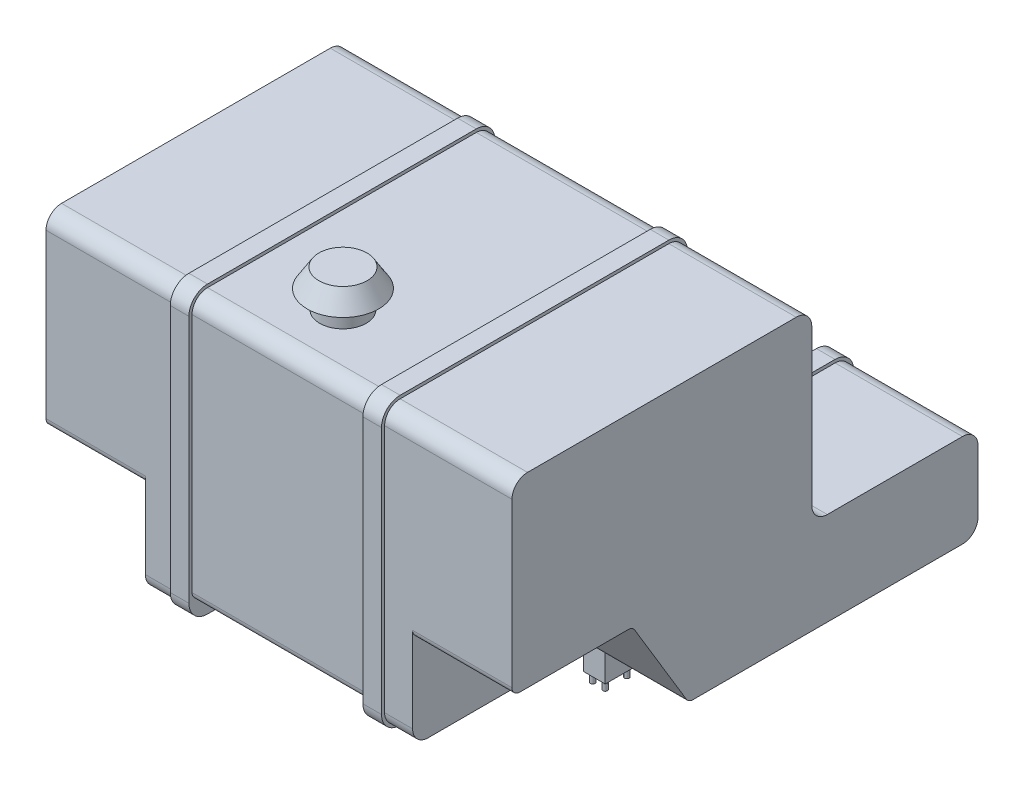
ISO-10303-21;
HEADER;
FILE_DESCRIPTION(('STEP AP214'),'2;1');
FILE_NAME('part.step','',(''),(''),'','','');
FILE_SCHEMA(('AUTOMOTIVE_DESIGN { 1 0 10303 214 1 1 1 1 }'));
ENDSEC;
DATA;
#1=APPLICATION_CONTEXT('core data for automotive mechanical design processes');
#2=APPLICATION_PROTOCOL_DEFINITION('international standard','automotive_design',2000,#1);
#3=PRODUCT_CONTEXT('',#1,'mechanical');
#4=PRODUCT('Part','Part','',(#3));
#5=PRODUCT_RELATED_PRODUCT_CATEGORY('part','',(#4));
#6=PRODUCT_DEFINITION_FORMATION('','',#4);
#7=PRODUCT_DEFINITION_CONTEXT('part definition',#1,'design');
#8=PRODUCT_DEFINITION('design','',#6,#7);
#9=PRODUCT_DEFINITION_SHAPE('','',#8);
#10=(LENGTH_UNIT() NAMED_UNIT(*) SI_UNIT(.MILLI.,.METRE.));
#11=(NAMED_UNIT(*) PLANE_ANGLE_UNIT() SI_UNIT($,.RADIAN.));
#12=(NAMED_UNIT(*) SI_UNIT($,.STERADIAN.) SOLID_ANGLE_UNIT());
#13=UNCERTAINTY_MEASURE_WITH_UNIT(LENGTH_MEASURE(1.E-05),#10,'distance_accuracy_value','');
#14=(GEOMETRIC_REPRESENTATION_CONTEXT(3) GLOBAL_UNCERTAINTY_ASSIGNED_CONTEXT((#13)) GLOBAL_UNIT_ASSIGNED_CONTEXT((#10,
#11,#12)) REPRESENTATION_CONTEXT('',''));
#15=CARTESIAN_POINT('',(0.,0.,0.));
#16=DIRECTION('',(0.,0.,1.));
#17=DIRECTION('',(1.,0.,0.));
#18=AXIS2_PLACEMENT_3D('',#15,#16,#17);
#19=CARTESIAN_POINT('',(-750.,445.,965.000000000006));
#20=DIRECTION('',(0.,0.,-1.));
#21=DIRECTION('',(-1.,0.,0.));
#22=AXIS2_PLACEMENT_3D('',#19,#20,#21);
#23=PLANE('',#22);
#24=DIRECTION('',(0.,1.,0.));
#25=VECTOR('',#24,1.);
#26=CARTESIAN_POINT('',(-280.,445.,965.000000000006));
#27=LINE('',#26,#25);
#28=CARTESIAN_POINT('',(-280.,220.,965.000000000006));
#29=VERTEX_POINT('',#28);
#30=CARTESIAN_POINT('',(-280.,995.,965.000000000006));
#31=VERTEX_POINT('',#30);
#32=EDGE_CURVE('E773',#29,#31,#27,.T.);
#33=ORIENTED_EDGE('',*,*,#32,.F.);
#34=DIRECTION('',(1.,0.,0.));
#35=VECTOR('',#34,1.);
#36=CARTESIAN_POINT('',(-750.,220.,965.000000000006));
#37=LINE('',#36,#35);
#38=CARTESIAN_POINT('',(280.,220.,965.000000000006));
#39=VERTEX_POINT('',#38);
#40=EDGE_CURVE('E1383',#29,#39,#37,.T.);
#41=ORIENTED_EDGE('',*,*,#40,.T.);
#42=DIRECTION('',(0.,-1.,0.));
#43=VECTOR('',#42,1.);
#44=CARTESIAN_POINT('',(280.,445.,965.000000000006));
#45=LINE('',#44,#43);
#46=CARTESIAN_POINT('',(280.,995.,965.000000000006));
#47=VERTEX_POINT('',#46);
#48=EDGE_CURVE('E912',#47,#39,#45,.T.);
#49=ORIENTED_EDGE('',*,*,#48,.F.);
#50=DIRECTION('',(1.,0.,0.));
#51=VECTOR('',#50,1.);
#52=CARTESIAN_POINT('',(-750.,995.,965.000000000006));
#53=LINE('',#52,#51);
#54=EDGE_CURVE('E1249',#47,#31,#53,.F.);
#55=ORIENTED_EDGE('',*,*,#54,.T.);
#56=EDGE_LOOP('',(#33,#41,#49,#55));
#57=FACE_BOUND('',#56,.T.);
#58=ADVANCED_FACE('F63',(#57),#23,.F.);
#59=CARTESIAN_POINT('',(0.,445.,0.));
#60=DIRECTION('',(0.,-1.,0.));
#61=DIRECTION('',(0.,0.,-1.));
#62=AXIS2_PLACEMENT_3D('',#59,#60,#61);
#63=PLANE('',#62);
#64=DIRECTION('',(0.,0.,1.));
#65=VECTOR('',#64,1.);
#66=CARTESIAN_POINT('',(280.,445.,0.));
#67=LINE('',#66,#65);
#68=CARTESIAN_POINT('',(280.,445.,-252.999999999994));
#69=VERTEX_POINT('',#68);
#70=CARTESIAN_POINT('',(280.,445.,-49.9999999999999));
#71=VERTEX_POINT('',#70);
#72=EDGE_CURVE('E910',#69,#71,#67,.T.);
#73=ORIENTED_EDGE('',*,*,#72,.F.);
#74=DIRECTION('',(1.,0.,0.));
#75=VECTOR('',#74,1.);
#76=CARTESIAN_POINT('',(0.,445.,-252.999999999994));
#77=LINE('',#76,#75);
#78=CARTESIAN_POINT('',(-280.,445.,-252.999999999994));
#79=VERTEX_POINT('',#78);
#80=EDGE_CURVE('E1329',#69,#79,#77,.F.);
#81=ORIENTED_EDGE('',*,*,#80,.T.);
#82=DIRECTION('',(0.,0.,-1.));
#83=VECTOR('',#82,1.);
#84=CARTESIAN_POINT('',(-280.,445.,0.));
#85=LINE('',#84,#83);
#86=CARTESIAN_POINT('',(-280.,445.,-50.));
#87=VERTEX_POINT('',#86);
#88=EDGE_CURVE('E770',#87,#79,#85,.T.);
#89=ORIENTED_EDGE('',*,*,#88,.F.);
#90=DIRECTION('',(-1.,0.,0.));
#91=VECTOR('',#90,1.);
#92=CARTESIAN_POINT('',(750.,445.,-50.));
#93=LINE('',#92,#91);
#94=EDGE_CURVE('E1270',#87,#71,#93,.F.);
#95=ORIENTED_EDGE('',*,*,#94,.T.);
#96=EDGE_LOOP('',(#73,#81,#89,#95));
#97=FACE_BOUND('',#96,.T.);
#98=ADVANCED_FACE('F1550',(#97),#63,.F.);
#99=CARTESIAN_POINT('',(-750.,445.,-534.999999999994));
#100=DIRECTION('',(0.,0.,1.));
#101=DIRECTION('',(1.,0.,0.));
#102=AXIS2_PLACEMENT_3D('',#99,#100,#101);
#103=PLANE('',#102);
#104=DIRECTION('',(0.,1.,0.));
#105=VECTOR('',#104,1.);
#106=CARTESIAN_POINT('',(280.,445.,-534.999999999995));
#107=LINE('',#106,#105);
#108=CARTESIAN_POINT('',(280.,220.,-534.999999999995));
#109=VERTEX_POINT('',#108);
#110=CARTESIAN_POINT('',(280.,345.622541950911,-534.999999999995));
#111=VERTEX_POINT('',#110);
#112=EDGE_CURVE('E915',#109,#111,#107,.T.);
#113=ORIENTED_EDGE('',*,*,#112,.F.);
#114=DIRECTION('',(-1.,0.,0.));
#115=VECTOR('',#114,1.);
#116=CARTESIAN_POINT('',(-750.,220.,-534.999999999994));
#117=LINE('',#116,#115);
#118=CARTESIAN_POINT('',(-280.,220.,-534.999999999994));
#119=VERTEX_POINT('',#118);
#120=EDGE_CURVE('E1390',#109,#119,#117,.T.);
#121=ORIENTED_EDGE('',*,*,#120,.T.);
#122=DIRECTION('',(0.,-1.,0.));
#123=VECTOR('',#122,1.);
#124=CARTESIAN_POINT('',(-280.,445.,-534.999999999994));
#125=LINE('',#124,#123);
#126=CARTESIAN_POINT('',(-280.,345.622541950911,-534.999999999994));
#127=VERTEX_POINT('',#126);
#128=EDGE_CURVE('E775',#127,#119,#125,.T.);
#129=ORIENTED_EDGE('',*,*,#128,.F.);
#130=DIRECTION('',(-1.,0.,0.));
#131=VECTOR('',#130,1.);
#132=CARTESIAN_POINT('',(-750.,345.622541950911,-534.999999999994));
#133=LINE('',#132,#131);
#134=EDGE_CURVE('E1316',#127,#111,#133,.F.);
#135=ORIENTED_EDGE('',*,*,#134,.T.);
#136=EDGE_LOOP('',(#113,#121,#129,#135));
#137=FACE_BOUND('',#136,.T.);
#138=ADVANCED_FACE('F1422',(#137),#103,.F.);
#139=CARTESIAN_POINT('',(-750.,1045.,0.));
#140=DIRECTION('',(0.,0.,1.));
#141=DIRECTION('',(1.,0.,0.));
#142=AXIS2_PLACEMENT_3D('',#139,#140,#141);
#143=PLANE('',#142);
#144=DIRECTION('',(0.,-1.,0.));
#145=VECTOR('',#144,1.);
#146=CARTESIAN_POINT('',(-280.,1045.,0.));
#147=LINE('',#146,#145);
#148=CARTESIAN_POINT('',(-280.,995.,0.));
#149=VERTEX_POINT('',#148);
#150=CARTESIAN_POINT('',(-280.,495.,0.));
#151=VERTEX_POINT('',#150);
#152=EDGE_CURVE('E763',#149,#151,#147,.T.);
#153=ORIENTED_EDGE('',*,*,#152,.F.);
#154=DIRECTION('',(-1.,0.,0.));
#155=VECTOR('',#154,1.);
#156=CARTESIAN_POINT('',(-750.,995.,0.));
#157=LINE('',#156,#155);
#158=CARTESIAN_POINT('',(280.,995.,0.));
#159=VERTEX_POINT('',#158);
#160=EDGE_CURVE('E1287',#149,#159,#157,.F.);
#161=ORIENTED_EDGE('',*,*,#160,.T.);
#162=DIRECTION('',(0.,1.,0.));
#163=VECTOR('',#162,1.);
#164=CARTESIAN_POINT('',(280.,1045.,0.));
#165=LINE('',#164,#163);
#166=CARTESIAN_POINT('',(280.,495.,0.));
#167=VERTEX_POINT('',#166);
#168=EDGE_CURVE('E902',#167,#159,#165,.T.);
#169=ORIENTED_EDGE('',*,*,#168,.F.);
#170=DIRECTION('',(-1.,0.,0.));
#171=VECTOR('',#170,1.);
#172=CARTESIAN_POINT('',(-750.,495.,0.));
#173=LINE('',#172,#171);
#174=EDGE_CURVE('E1292',#167,#151,#173,.T.);
#175=ORIENTED_EDGE('',*,*,#174,.T.);
#176=EDGE_LOOP('',(#153,#161,#169,#175));
#177=FACE_BOUND('',#176,.T.);
#178=ADVANCED_FACE('F1644',(#177),#143,.F.);
#179=CARTESIAN_POINT('',(0.,1045.,0.));
#180=DIRECTION('',(0.,-1.,0.));
#181=DIRECTION('',(0.,0.,-1.));
#182=AXIS2_PLACEMENT_3D('',#179,#180,#181);
#183=PLANE('',#182);
#184=CARTESIAN_POINT('',(0.,1045.,759.137260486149));
#185=DIRECTION('',(0.,-1.,0.));
#186=DIRECTION('',(0.,0.,-1.));
#187=AXIS2_PLACEMENT_3D('',#184,#185,#186);
#188=CIRCLE('',#187,75.);
#189=CARTESIAN_POINT('',(0.,1045.,684.13726048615));
#190=VERTEX_POINT('',#189);
#191=EDGE_CURVE('E1296',#190,#190,#188,.F.);
#192=ORIENTED_EDGE('',*,*,#191,.F.);
#193=EDGE_LOOP('',(#192));
#194=FACE_BOUND('',#193,.T.);
#195=DIRECTION('',(0.,0.,-1.));
#196=VECTOR('',#195,1.);
#197=CARTESIAN_POINT('',(-280.,1045.,0.));
#198=LINE('',#197,#196);
#199=CARTESIAN_POINT('',(-280.,1045.,915.000000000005));
#200=VERTEX_POINT('',#199);
#201=CARTESIAN_POINT('',(-280.,1045.,50.));
#202=VERTEX_POINT('',#201);
#203=EDGE_CURVE('E761',#200,#202,#198,.T.);
#204=ORIENTED_EDGE('',*,*,#203,.F.);
#205=DIRECTION('',(1.,0.,0.));
#206=VECTOR('',#205,1.);
#207=CARTESIAN_POINT('',(0.,1045.,915.000000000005));
#208=LINE('',#207,#206);
#209=CARTESIAN_POINT('',(280.,1045.,915.000000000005));
#210=VERTEX_POINT('',#209);
#211=EDGE_CURVE('E1232',#200,#210,#208,.T.);
#212=ORIENTED_EDGE('',*,*,#211,.T.);
#213=DIRECTION('',(0.,0.,1.));
#214=VECTOR('',#213,1.);
#215=CARTESIAN_POINT('',(280.,1045.,0.));
#216=LINE('',#215,#214);
#217=CARTESIAN_POINT('',(280.,1045.,50.));
#218=VERTEX_POINT('',#217);
#219=EDGE_CURVE('E899',#218,#210,#216,.T.);
#220=ORIENTED_EDGE('',*,*,#219,.F.);
#221=DIRECTION('',(-1.,0.,0.));
#222=VECTOR('',#221,1.);
#223=CARTESIAN_POINT('',(0.,1045.,50.));
#224=LINE('',#223,#222);
#225=EDGE_CURVE('E1227',#218,#202,#224,.T.);
#226=ORIENTED_EDGE('',*,*,#225,.T.);
#227=EDGE_LOOP('',(#204,#212,#220,#226));
#228=FACE_BOUND('',#227,.T.);
#229=ADVANCED_FACE('F1851',(#194,#228),#183,.F.);
#230=CARTESIAN_POINT('',(0.,995.,915.000000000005));
#231=DIRECTION('',(1.,0.,0.));
#232=DIRECTION('',(0.,0.,-1.));
#233=AXIS2_PLACEMENT_3D('',#230,#231,#232);
#234=CYLINDRICAL_SURFACE('',#233,50.);
#235=ORIENTED_EDGE('',*,*,#211,.F.);
#236=CARTESIAN_POINT('',(-280.,995.,915.000000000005));
#237=DIRECTION('',(-1.,0.,0.));
#238=DIRECTION('',(0.,0.,1.));
#239=AXIS2_PLACEMENT_3D('',#236,#237,#238);
#240=CIRCLE('',#239,50.);
#241=EDGE_CURVE('E767',#200,#31,#240,.F.);
#242=ORIENTED_EDGE('',*,*,#241,.T.);
#243=ORIENTED_EDGE('',*,*,#54,.F.);
#244=CARTESIAN_POINT('',(280.,995.,915.000000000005));
#245=DIRECTION('',(1.,0.,0.));
#246=DIRECTION('',(0.,0.,-1.));
#247=AXIS2_PLACEMENT_3D('',#244,#245,#246);
#248=CIRCLE('',#247,50.);
#249=EDGE_CURVE('E907',#47,#210,#248,.F.);
#250=ORIENTED_EDGE('',*,*,#249,.T.);
#251=EDGE_LOOP('',(#235,#242,#243,#250));
#252=FACE_BOUND('',#251,.T.);
#253=ADVANCED_FACE('F1674',(#252),#234,.T.);
#254=CARTESIAN_POINT('',(-750.,495.,-50.));
#255=DIRECTION('',(1.,0.,0.));
#256=DIRECTION('',(0.,0.,-1.));
#257=AXIS2_PLACEMENT_3D('',#254,#255,#256);
#258=CYLINDRICAL_SURFACE('',#257,50.);
#259=CARTESIAN_POINT('',(-280.,495.,-50.));
#260=DIRECTION('',(-1.,0.,0.));
#261=DIRECTION('',(0.,0.,1.));
#262=AXIS2_PLACEMENT_3D('',#259,#260,#261);
#263=CIRCLE('',#262,50.);
#264=EDGE_CURVE('E765',#151,#87,#263,.F.);
#265=ORIENTED_EDGE('',*,*,#264,.F.);
#266=ORIENTED_EDGE('',*,*,#174,.F.);
#267=CARTESIAN_POINT('',(280.,495.,-50.));
#268=DIRECTION('',(1.,0.,0.));
#269=DIRECTION('',(0.,0.,-1.));
#270=AXIS2_PLACEMENT_3D('',#267,#268,#269);
#271=CIRCLE('',#270,50.);
#272=EDGE_CURVE('E905',#71,#167,#271,.F.);
#273=ORIENTED_EDGE('',*,*,#272,.F.);
#274=ORIENTED_EDGE('',*,*,#94,.F.);
#275=EDGE_LOOP('',(#265,#266,#273,#274));
#276=FACE_BOUND('',#275,.T.);
#277=ADVANCED_FACE('F1639',(#276),#258,.F.);
#278=CARTESIAN_POINT('',(0.,995.,50.));
#279=DIRECTION('',(-1.,0.,0.));
#280=DIRECTION('',(0.,0.,1.));
#281=AXIS2_PLACEMENT_3D('',#278,#279,#280);
#282=CYLINDRICAL_SURFACE('',#281,50.);
#283=ORIENTED_EDGE('',*,*,#160,.F.);
#284=CARTESIAN_POINT('',(-280.,995.,50.));
#285=DIRECTION('',(-1.,0.,0.));
#286=DIRECTION('',(0.,0.,1.));
#287=AXIS2_PLACEMENT_3D('',#284,#285,#286);
#288=CIRCLE('',#287,50.);
#289=EDGE_CURVE('E1308',#149,#202,#288,.F.);
#290=ORIENTED_EDGE('',*,*,#289,.T.);
#291=ORIENTED_EDGE('',*,*,#225,.F.);
#292=CARTESIAN_POINT('',(280.,995.,50.));
#293=DIRECTION('',(1.,0.,0.));
#294=DIRECTION('',(0.,0.,-1.));
#295=AXIS2_PLACEMENT_3D('',#292,#293,#294);
#296=CIRCLE('',#295,50.);
#297=EDGE_CURVE('E1302',#218,#159,#296,.F.);
#298=ORIENTED_EDGE('',*,*,#297,.T.);
#299=EDGE_LOOP('',(#283,#290,#291,#298));
#300=FACE_BOUND('',#299,.T.);
#301=ADVANCED_FACE('F1856',(#300),#282,.T.);
#302=CARTESIAN_POINT('',(0.,1105.,759.137260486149));
#303=DIRECTION('',(0.,-1.,0.));
#304=DIRECTION('',(0.,0.,-1.));
#305=AXIS2_PLACEMENT_3D('',#302,#303,#304);
#306=CYLINDRICAL_SURFACE('',#305,75.);
#307=CARTESIAN_POINT('',(0.,1105.,759.137260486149));
#308=DIRECTION('',(0.,1.,0.));
#309=DIRECTION('',(0.,0.,1.));
#310=AXIS2_PLACEMENT_3D('',#307,#308,#309);
#311=CIRCLE('',#310,75.);
#312=CARTESIAN_POINT('',(0.,1105.,834.137260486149));
#313=VERTEX_POINT('',#312);
#314=EDGE_CURVE('E962',#313,#313,#311,.T.);
#315=ORIENTED_EDGE('',*,*,#314,.F.);
#316=EDGE_LOOP('',(#315));
#317=FACE_BOUND('',#316,.T.);
#318=ORIENTED_EDGE('',*,*,#191,.T.);
#319=EDGE_LOOP('',(#318));
#320=FACE_BOUND('',#319,.T.);
#321=ADVANCED_FACE('F1852',(#317,#320),#306,.T.);
#322=CARTESIAN_POINT('',(0.,1105.,759.137260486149));
#323=DIRECTION('',(0.,-1.,0.));
#324=DIRECTION('',(0.,0.,1.));
#325=AXIS2_PLACEMENT_3D('',#322,#323,#324);
#326=CONICAL_SURFACE('',#325,115.,0.558505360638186);
#327=CARTESIAN_POINT('',(0.,1165.,759.137260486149));
#328=DIRECTION('',(0.,1.,0.));
#329=DIRECTION('',(0.,0.,1.));
#330=AXIS2_PLACEMENT_3D('',#327,#328,#329);
#331=CIRCLE('',#330,77.5078388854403);
#332=CARTESIAN_POINT('',(0.,1165.,836.64509937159));
#333=VERTEX_POINT('',#332);
#334=EDGE_CURVE('E959',#333,#333,#331,.T.);
#335=ORIENTED_EDGE('',*,*,#334,.F.);
#336=EDGE_LOOP('',(#335));
#337=FACE_BOUND('',#336,.T.);
#338=CARTESIAN_POINT('',(0.,1105.,759.137260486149));
#339=DIRECTION('',(0.,1.,0.));
#340=DIRECTION('',(0.,0.,1.));
#341=AXIS2_PLACEMENT_3D('',#338,#339,#340);
#342=CIRCLE('',#341,115.);
#343=CARTESIAN_POINT('',(0.,1105.,874.137260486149));
#344=VERTEX_POINT('',#343);
#345=EDGE_CURVE('E952',#344,#344,#342,.T.);
#346=ORIENTED_EDGE('',*,*,#345,.T.);
#347=EDGE_LOOP('',(#346));
#348=FACE_BOUND('',#347,.T.);
#349=ADVANCED_FACE('F1855',(#337,#348),#326,.T.);
#350=CARTESIAN_POINT('',(0.,1165.,759.137260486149));
#351=DIRECTION('',(0.,1.,0.));
#352=DIRECTION('',(0.,0.,1.));
#353=AXIS2_PLACEMENT_3D('',#350,#351,#352);
#354=PLANE('',#353);
#355=ORIENTED_EDGE('',*,*,#334,.T.);
#356=EDGE_LOOP('',(#355));
#357=FACE_BOUND('',#356,.T.);
#358=ADVANCED_FACE('F1860',(#357),#354,.T.);
#359=CARTESIAN_POINT('',(0.,1105.,759.137260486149));
#360=DIRECTION('',(0.,1.,0.));
#361=DIRECTION('',(0.,0.,1.));
#362=AXIS2_PLACEMENT_3D('',#359,#360,#361);
#363=PLANE('',#362);
#364=ORIENTED_EDGE('',*,*,#314,.T.);
#365=EDGE_LOOP('',(#364));
#366=FACE_BOUND('',#365,.T.);
#367=ORIENTED_EDGE('',*,*,#345,.F.);
#368=EDGE_LOOP('',(#367));
#369=FACE_BOUND('',#368,.T.);
#370=ADVANCED_FACE('F1862',(#366,#369),#363,.F.);
#371=CARTESIAN_POINT('',(280.,995.,50.));
#372=DIRECTION('',(1.,0.,0.));
#373=DIRECTION('',(0.,0.,-1.));
#374=AXIS2_PLACEMENT_3D('',#371,#372,#373);
#375=CYLINDRICAL_SURFACE('',#374,60.);
#376=CARTESIAN_POINT('',(340.,995.,50.));
#377=DIRECTION('',(1.,0.,0.));
#378=DIRECTION('',(0.,0.,-1.));
#379=AXIS2_PLACEMENT_3D('',#376,#377,#378);
#380=CIRCLE('',#379,60.);
#381=CARTESIAN_POINT('',(340.,995.,-10.));
#382=VERTEX_POINT('',#381);
#383=CARTESIAN_POINT('',(340.,1055.,50.));
#384=VERTEX_POINT('',#383);
#385=EDGE_CURVE('E778',#382,#384,#380,.T.);
#386=ORIENTED_EDGE('',*,*,#385,.F.);
#387=DIRECTION('',(1.,0.,0.));
#388=VECTOR('',#387,1.);
#389=CARTESIAN_POINT('',(280.,995.,-10.));
#390=LINE('',#389,#388);
#391=CARTESIAN_POINT('',(280.,995.,-10.));
#392=VERTEX_POINT('',#391);
#393=EDGE_CURVE('E848',#392,#382,#390,.T.);
#394=ORIENTED_EDGE('',*,*,#393,.F.);
#395=CARTESIAN_POINT('',(280.,995.,50.));
#396=DIRECTION('',(1.,0.,0.));
#397=DIRECTION('',(0.,0.,-1.));
#398=AXIS2_PLACEMENT_3D('',#395,#396,#397);
#399=CIRCLE('',#398,60.);
#400=CARTESIAN_POINT('',(280.,1055.,50.));
#401=VERTEX_POINT('',#400);
#402=EDGE_CURVE('E779',#392,#401,#399,.T.);
#403=ORIENTED_EDGE('',*,*,#402,.T.);
#404=DIRECTION('',(1.,0.,0.));
#405=VECTOR('',#404,1.);
#406=CARTESIAN_POINT('',(280.,1055.,50.));
#407=LINE('',#406,#405);
#408=EDGE_CURVE('E813',#401,#384,#407,.T.);
#409=ORIENTED_EDGE('',*,*,#408,.T.);
#410=EDGE_LOOP('',(#386,#394,#403,#409));
#411=FACE_BOUND('',#410,.T.);
#412=ADVANCED_FACE('F1865',(#411),#375,.T.);
#413=CARTESIAN_POINT('',(280.,495.,-10.));
#414=DIRECTION('',(0.,0.,-1.));
#415=DIRECTION('',(0.,1.,0.));
#416=AXIS2_PLACEMENT_3D('',#413,#414,#415);
#417=PLANE('',#416);
#418=DIRECTION('',(0.,1.,0.));
#419=VECTOR('',#418,1.);
#420=CARTESIAN_POINT('',(340.,495.,-10.));
#421=LINE('',#420,#419);
#422=CARTESIAN_POINT('',(340.,495.,-10.0000000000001));
#423=VERTEX_POINT('',#422);
#424=EDGE_CURVE('E783',#423,#382,#421,.T.);
#425=ORIENTED_EDGE('',*,*,#424,.F.);
#426=DIRECTION('',(1.,0.,0.));
#427=VECTOR('',#426,1.);
#428=CARTESIAN_POINT('',(280.,495.,-10.0000000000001));
#429=LINE('',#428,#427);
#430=CARTESIAN_POINT('',(280.,495.,-10.0000000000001));
#431=VERTEX_POINT('',#430);
#432=EDGE_CURVE('E851',#431,#423,#429,.T.);
#433=ORIENTED_EDGE('',*,*,#432,.F.);
#434=DIRECTION('',(0.,1.,0.));
#435=VECTOR('',#434,1.);
#436=CARTESIAN_POINT('',(280.,495.,-10.));
#437=LINE('',#436,#435);
#438=EDGE_CURVE('E810',#431,#392,#437,.T.);
#439=ORIENTED_EDGE('',*,*,#438,.T.);
#440=ORIENTED_EDGE('',*,*,#393,.T.);
#441=EDGE_LOOP('',(#425,#433,#439,#440));
#442=FACE_BOUND('',#441,.T.);
#443=ADVANCED_FACE('F2363',(#442),#417,.T.);
#444=CARTESIAN_POINT('',(280.,495.,-50.));
#445=DIRECTION('',(1.,0.,0.));
#446=DIRECTION('',(0.,0.,-1.));
#447=AXIS2_PLACEMENT_3D('',#444,#445,#446);
#448=CYLINDRICAL_SURFACE('',#447,39.9999999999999);
#449=CARTESIAN_POINT('',(340.,495.,-50.));
#450=DIRECTION('',(-1.,0.,0.));
#451=DIRECTION('',(0.,0.,-1.));
#452=AXIS2_PLACEMENT_3D('',#449,#450,#451);
#453=CIRCLE('',#452,39.9999999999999);
#454=CARTESIAN_POINT('',(340.,455.,-49.9999999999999));
#455=VERTEX_POINT('',#454);
#456=EDGE_CURVE('E843',#455,#423,#453,.T.);
#457=ORIENTED_EDGE('',*,*,#456,.F.);
#458=DIRECTION('',(1.,0.,0.));
#459=VECTOR('',#458,1.);
#460=CARTESIAN_POINT('',(280.,455.,-49.9999999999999));
#461=LINE('',#460,#459);
#462=CARTESIAN_POINT('',(280.,455.,-49.9999999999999));
#463=VERTEX_POINT('',#462);
#464=EDGE_CURVE('E853',#463,#455,#461,.T.);
#465=ORIENTED_EDGE('',*,*,#464,.F.);
#466=CARTESIAN_POINT('',(280.,495.,-50.));
#467=DIRECTION('',(-1.,0.,0.));
#468=DIRECTION('',(0.,0.,-1.));
#469=AXIS2_PLACEMENT_3D('',#466,#467,#468);
#470=CIRCLE('',#469,39.9999999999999);
#471=EDGE_CURVE('E807',#463,#431,#470,.T.);
#472=ORIENTED_EDGE('',*,*,#471,.T.);
#473=ORIENTED_EDGE('',*,*,#432,.T.);
#474=EDGE_LOOP('',(#457,#465,#472,#473));
#475=FACE_BOUND('',#474,.T.);
#476=ADVANCED_FACE('F2353',(#475),#448,.F.);
#477=CARTESIAN_POINT('',(280.,455.,-484.999999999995));
#478=DIRECTION('',(0.,1.,0.));
#479=DIRECTION('',(0.,0.,1.));
#480=AXIS2_PLACEMENT_3D('',#477,#478,#479);
#481=PLANE('',#480);
#482=DIRECTION('',(0.,0.,1.));
#483=VECTOR('',#482,1.);
#484=CARTESIAN_POINT('',(340.,455.,-484.999999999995));
#485=LINE('',#484,#483);
#486=CARTESIAN_POINT('',(340.,455.,-484.999999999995));
#487=VERTEX_POINT('',#486);
#488=EDGE_CURVE('E840',#487,#455,#485,.T.);
#489=ORIENTED_EDGE('',*,*,#488,.F.);
#490=DIRECTION('',(1.,0.,0.));
#491=VECTOR('',#490,1.);
#492=CARTESIAN_POINT('',(280.,455.,-484.999999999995));
#493=LINE('',#492,#491);
#494=CARTESIAN_POINT('',(280.,455.,-484.999999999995));
#495=VERTEX_POINT('',#494);
#496=EDGE_CURVE('E855',#495,#487,#493,.T.);
#497=ORIENTED_EDGE('',*,*,#496,.F.);
#498=DIRECTION('',(0.,0.,1.));
#499=VECTOR('',#498,1.);
#500=CARTESIAN_POINT('',(280.,455.,-484.999999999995));
#501=LINE('',#500,#499);
#502=EDGE_CURVE('E804',#495,#463,#501,.T.);
#503=ORIENTED_EDGE('',*,*,#502,.T.);
#504=ORIENTED_EDGE('',*,*,#464,.T.);
#505=EDGE_LOOP('',(#489,#497,#503,#504));
#506=FACE_BOUND('',#505,.T.);
#507=ADVANCED_FACE('F2343',(#506),#481,.T.);
#508=CARTESIAN_POINT('',(280.,395.,-484.999999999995));
#509=DIRECTION('',(1.,0.,0.));
#510=DIRECTION('',(0.,0.,-1.));
#511=AXIS2_PLACEMENT_3D('',#508,#509,#510);
#512=CYLINDRICAL_SURFACE('',#511,60.);
#513=CARTESIAN_POINT('',(340.,395.,-484.999999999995));
#514=DIRECTION('',(1.,0.,0.));
#515=DIRECTION('',(0.,0.,-1.));
#516=AXIS2_PLACEMENT_3D('',#513,#514,#515);
#517=CIRCLE('',#516,60.);
#518=CARTESIAN_POINT('',(340.,395.,-544.999999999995));
#519=VERTEX_POINT('',#518);
#520=EDGE_CURVE('E837',#519,#487,#517,.T.);
#521=ORIENTED_EDGE('',*,*,#520,.F.);
#522=DIRECTION('',(1.,0.,0.));
#523=VECTOR('',#522,1.);
#524=CARTESIAN_POINT('',(280.,395.,-544.999999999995));
#525=LINE('',#524,#523);
#526=CARTESIAN_POINT('',(280.,395.,-544.999999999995));
#527=VERTEX_POINT('',#526);
#528=EDGE_CURVE('E857',#527,#519,#525,.T.);
#529=ORIENTED_EDGE('',*,*,#528,.F.);
#530=CARTESIAN_POINT('',(280.,395.,-484.999999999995));
#531=DIRECTION('',(1.,0.,0.));
#532=DIRECTION('',(0.,0.,-1.));
#533=AXIS2_PLACEMENT_3D('',#530,#531,#532);
#534=CIRCLE('',#533,60.);
#535=EDGE_CURVE('E802',#527,#495,#534,.T.);
#536=ORIENTED_EDGE('',*,*,#535,.T.);
#537=ORIENTED_EDGE('',*,*,#496,.T.);
#538=EDGE_LOOP('',(#521,#529,#536,#537));
#539=FACE_BOUND('',#538,.T.);
#540=ADVANCED_FACE('F2333',(#539),#512,.T.);
#541=CARTESIAN_POINT('',(280.,195.,-544.999999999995));
#542=DIRECTION('',(0.,0.,-1.));
#543=DIRECTION('',(-1.,0.,0.));
#544=AXIS2_PLACEMENT_3D('',#541,#542,#543);
#545=PLANE('',#544);
#546=DIRECTION('',(0.,1.,0.));
#547=VECTOR('',#546,1.);
#548=CARTESIAN_POINT('',(340.,195.,-544.999999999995));
#549=LINE('',#548,#547);
#550=CARTESIAN_POINT('',(340.,195.,-544.999999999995));
#551=VERTEX_POINT('',#550);
#552=EDGE_CURVE('E834',#551,#519,#549,.T.);
#553=ORIENTED_EDGE('',*,*,#552,.F.);
#554=DIRECTION('',(1.,0.,0.));
#555=VECTOR('',#554,1.);
#556=CARTESIAN_POINT('',(280.,195.,-544.999999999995));
#557=LINE('',#556,#555);
#558=CARTESIAN_POINT('',(280.,195.,-544.999999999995));
#559=VERTEX_POINT('',#558);
#560=EDGE_CURVE('E859',#559,#551,#557,.T.);
#561=ORIENTED_EDGE('',*,*,#560,.F.);
#562=DIRECTION('',(0.,1.,0.));
#563=VECTOR('',#562,1.);
#564=CARTESIAN_POINT('',(280.,195.,-544.999999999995));
#565=LINE('',#564,#563);
#566=EDGE_CURVE('E799',#559,#527,#565,.T.);
#567=ORIENTED_EDGE('',*,*,#566,.T.);
#568=ORIENTED_EDGE('',*,*,#528,.T.);
#569=EDGE_LOOP('',(#553,#561,#567,#568));
#570=FACE_BOUND('',#569,.T.);
#571=ADVANCED_FACE('F2323',(#570),#545,.T.);
#572=CARTESIAN_POINT('',(280.,195.,-484.999999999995));
#573=DIRECTION('',(1.,0.,0.));
#574=DIRECTION('',(0.,0.,-1.));
#575=AXIS2_PLACEMENT_3D('',#572,#573,#574);
#576=CYLINDRICAL_SURFACE('',#575,60.);
#577=CARTESIAN_POINT('',(340.,195.,-484.999999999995));
#578=DIRECTION('',(1.,0.,0.));
#579=DIRECTION('',(0.,0.,-1.));
#580=AXIS2_PLACEMENT_3D('',#577,#578,#579);
#581=CIRCLE('',#580,60.);
#582=CARTESIAN_POINT('',(340.,135.,-484.999999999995));
#583=VERTEX_POINT('',#582);
#584=EDGE_CURVE('E831',#583,#551,#581,.T.);
#585=ORIENTED_EDGE('',*,*,#584,.F.);
#586=DIRECTION('',(1.,0.,0.));
#587=VECTOR('',#586,1.);
#588=CARTESIAN_POINT('',(280.,135.,-484.999999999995));
#589=LINE('',#588,#587);
#590=CARTESIAN_POINT('',(280.,135.,-484.999999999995));
#591=VERTEX_POINT('',#590);
#592=EDGE_CURVE('E861',#591,#583,#589,.T.);
#593=ORIENTED_EDGE('',*,*,#592,.F.);
#594=CARTESIAN_POINT('',(280.,195.,-484.999999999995));
#595=DIRECTION('',(1.,0.,0.));
#596=DIRECTION('',(0.,0.,-1.));
#597=AXIS2_PLACEMENT_3D('',#594,#595,#596);
#598=CIRCLE('',#597,60.);
#599=EDGE_CURVE('E797',#591,#559,#598,.T.);
#600=ORIENTED_EDGE('',*,*,#599,.T.);
#601=ORIENTED_EDGE('',*,*,#560,.T.);
#602=EDGE_LOOP('',(#585,#593,#600,#601));
#603=FACE_BOUND('',#602,.T.);
#604=ADVANCED_FACE('F2313',(#603),#576,.T.);
#605=CARTESIAN_POINT('',(280.,135.,915.000000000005));
#606=DIRECTION('',(0.,-1.,0.));
#607=DIRECTION('',(0.,0.,-1.));
#608=AXIS2_PLACEMENT_3D('',#605,#606,#607);
#609=PLANE('',#608);
#610=DIRECTION('',(0.,0.,-1.));
#611=VECTOR('',#610,1.);
#612=CARTESIAN_POINT('',(340.,135.,915.000000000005));
#613=LINE('',#612,#611);
#614=CARTESIAN_POINT('',(340.,135.,915.000000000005));
#615=VERTEX_POINT('',#614);
#616=EDGE_CURVE('E828',#615,#583,#613,.T.);
#617=ORIENTED_EDGE('',*,*,#616,.F.);
#618=DIRECTION('',(1.,0.,0.));
#619=VECTOR('',#618,1.);
#620=CARTESIAN_POINT('',(280.,135.,915.000000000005));
#621=LINE('',#620,#619);
#622=CARTESIAN_POINT('',(280.,135.,915.000000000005));
#623=VERTEX_POINT('',#622);
#624=EDGE_CURVE('E863',#623,#615,#621,.T.);
#625=ORIENTED_EDGE('',*,*,#624,.F.);
#626=DIRECTION('',(0.,0.,-1.));
#627=VECTOR('',#626,1.);
#628=CARTESIAN_POINT('',(280.,135.,915.000000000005));
#629=LINE('',#628,#627);
#630=EDGE_CURVE('E794',#623,#591,#629,.T.);
#631=ORIENTED_EDGE('',*,*,#630,.T.);
#632=ORIENTED_EDGE('',*,*,#592,.T.);
#633=EDGE_LOOP('',(#617,#625,#631,#632));
#634=FACE_BOUND('',#633,.T.);
#635=ADVANCED_FACE('F2303',(#634),#609,.T.);
#636=CARTESIAN_POINT('',(280.,195.,915.000000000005));
#637=DIRECTION('',(1.,0.,0.));
#638=DIRECTION('',(0.,0.,-1.));
#639=AXIS2_PLACEMENT_3D('',#636,#637,#638);
#640=CYLINDRICAL_SURFACE('',#639,60.);
#641=CARTESIAN_POINT('',(340.,195.,915.000000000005));
#642=DIRECTION('',(1.,0.,0.));
#643=DIRECTION('',(0.,0.,-1.));
#644=AXIS2_PLACEMENT_3D('',#641,#642,#643);
#645=CIRCLE('',#644,60.);
#646=CARTESIAN_POINT('',(340.,195.,975.000000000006));
#647=VERTEX_POINT('',#646);
#648=EDGE_CURVE('E825',#647,#615,#645,.T.);
#649=ORIENTED_EDGE('',*,*,#648,.F.);
#650=DIRECTION('',(1.,0.,0.));
#651=VECTOR('',#650,1.);
#652=CARTESIAN_POINT('',(280.,195.,975.000000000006));
#653=LINE('',#652,#651);
#654=CARTESIAN_POINT('',(280.,195.,975.000000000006));
#655=VERTEX_POINT('',#654);
#656=EDGE_CURVE('E865',#655,#647,#653,.T.);
#657=ORIENTED_EDGE('',*,*,#656,.F.);
#658=CARTESIAN_POINT('',(280.,195.,915.000000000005));
#659=DIRECTION('',(1.,0.,0.));
#660=DIRECTION('',(0.,0.,-1.));
#661=AXIS2_PLACEMENT_3D('',#658,#659,#660);
#662=CIRCLE('',#661,60.);
#663=EDGE_CURVE('E792',#655,#623,#662,.T.);
#664=ORIENTED_EDGE('',*,*,#663,.T.);
#665=ORIENTED_EDGE('',*,*,#624,.T.);
#666=EDGE_LOOP('',(#649,#657,#664,#665));
#667=FACE_BOUND('',#666,.T.);
#668=ADVANCED_FACE('F2293',(#667),#640,.T.);
#669=CARTESIAN_POINT('',(280.,995.,975.000000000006));
#670=DIRECTION('',(0.,0.,1.));
#671=DIRECTION('',(1.,0.,0.));
#672=AXIS2_PLACEMENT_3D('',#669,#670,#671);
#673=PLANE('',#672);
#674=DIRECTION('',(0.,-1.,0.));
#675=VECTOR('',#674,1.);
#676=CARTESIAN_POINT('',(340.,995.,975.000000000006));
#677=LINE('',#676,#675);
#678=CARTESIAN_POINT('',(340.,995.,975.000000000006));
#679=VERTEX_POINT('',#678);
#680=EDGE_CURVE('E822',#679,#647,#677,.T.);
#681=ORIENTED_EDGE('',*,*,#680,.F.);
#682=DIRECTION('',(1.,0.,0.));
#683=VECTOR('',#682,1.);
#684=CARTESIAN_POINT('',(280.,995.,975.000000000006));
#685=LINE('',#684,#683);
#686=CARTESIAN_POINT('',(280.,995.,975.000000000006));
#687=VERTEX_POINT('',#686);
#688=EDGE_CURVE('E867',#687,#679,#685,.T.);
#689=ORIENTED_EDGE('',*,*,#688,.F.);
#690=DIRECTION('',(0.,-1.,0.));
#691=VECTOR('',#690,1.);
#692=CARTESIAN_POINT('',(280.,995.,975.000000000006));
#693=LINE('',#692,#691);
#694=EDGE_CURVE('E789',#687,#655,#693,.T.);
#695=ORIENTED_EDGE('',*,*,#694,.T.);
#696=ORIENTED_EDGE('',*,*,#656,.T.);
#697=EDGE_LOOP('',(#681,#689,#695,#696));
#698=FACE_BOUND('',#697,.T.);
#699=ADVANCED_FACE('F2283',(#698),#673,.T.);
#700=CARTESIAN_POINT('',(280.,995.,915.000000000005));
#701=DIRECTION('',(1.,0.,0.));
#702=DIRECTION('',(0.,0.,-1.));
#703=AXIS2_PLACEMENT_3D('',#700,#701,#702);
#704=CYLINDRICAL_SURFACE('',#703,60.0000000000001);
#705=CARTESIAN_POINT('',(340.,995.,915.000000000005));
#706=DIRECTION('',(1.,0.,0.));
#707=DIRECTION('',(0.,0.,-1.));
#708=AXIS2_PLACEMENT_3D('',#705,#706,#707);
#709=CIRCLE('',#708,60.0000000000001);
#710=CARTESIAN_POINT('',(340.,1055.,915.000000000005));
#711=VERTEX_POINT('',#710);
#712=EDGE_CURVE('E819',#711,#679,#709,.T.);
#713=ORIENTED_EDGE('',*,*,#712,.F.);
#714=DIRECTION('',(1.,0.,0.));
#715=VECTOR('',#714,1.);
#716=CARTESIAN_POINT('',(280.,1055.,915.000000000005));
#717=LINE('',#716,#715);
#718=CARTESIAN_POINT('',(280.,1055.,915.000000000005));
#719=VERTEX_POINT('',#718);
#720=EDGE_CURVE('E869',#719,#711,#717,.T.);
#721=ORIENTED_EDGE('',*,*,#720,.F.);
#722=CARTESIAN_POINT('',(280.,995.,915.000000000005));
#723=DIRECTION('',(1.,0.,0.));
#724=DIRECTION('',(0.,0.,-1.));
#725=AXIS2_PLACEMENT_3D('',#722,#723,#724);
#726=CIRCLE('',#725,60.0000000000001);
#727=EDGE_CURVE('E786',#719,#687,#726,.T.);
#728=ORIENTED_EDGE('',*,*,#727,.T.);
#729=ORIENTED_EDGE('',*,*,#688,.T.);
#730=EDGE_LOOP('',(#713,#721,#728,#729));
#731=FACE_BOUND('',#730,.T.);
#732=ADVANCED_FACE('F2273',(#731),#704,.T.);
#733=CARTESIAN_POINT('',(280.,1055.,50.));
#734=DIRECTION('',(0.,1.,0.));
#735=DIRECTION('',(0.,0.,1.));
#736=AXIS2_PLACEMENT_3D('',#733,#734,#735);
#737=PLANE('',#736);
#738=DIRECTION('',(0.,0.,1.));
#739=VECTOR('',#738,1.);
#740=CARTESIAN_POINT('',(340.,1055.,50.));
#741=LINE('',#740,#739);
#742=EDGE_CURVE('E816',#384,#711,#741,.T.);
#743=ORIENTED_EDGE('',*,*,#742,.F.);
#744=ORIENTED_EDGE('',*,*,#408,.F.);
#745=DIRECTION('',(0.,0.,1.));
#746=VECTOR('',#745,1.);
#747=CARTESIAN_POINT('',(280.,1055.,50.));
#748=LINE('',#747,#746);
#749=EDGE_CURVE('E782',#401,#719,#748,.T.);
#750=ORIENTED_EDGE('',*,*,#749,.T.);
#751=ORIENTED_EDGE('',*,*,#720,.T.);
#752=EDGE_LOOP('',(#743,#744,#750,#751));
#753=FACE_BOUND('',#752,.T.);
#754=ADVANCED_FACE('F2265',(#753),#737,.T.);
#755=CARTESIAN_POINT('',(280.,995.,50.));
#756=DIRECTION('',(1.,0.,0.));
#757=DIRECTION('',(0.,0.,-1.));
#758=AXIS2_PLACEMENT_3D('',#755,#756,#757);
#759=PLANE('',#758);
#760=ORIENTED_EDGE('',*,*,#48,.T.);
#761=CARTESIAN_POINT('',(280.,220.,940.000000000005));
#762=DIRECTION('',(1.,0.,0.));
#763=DIRECTION('',(0.,0.,-1.));
#764=AXIS2_PLACEMENT_3D('',#761,#762,#763);
#765=CIRCLE('',#764,25.);
#766=CARTESIAN_POINT('',(280.,195.,940.000000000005));
#767=VERTEX_POINT('',#766);
#768=EDGE_CURVE('E1406',#39,#767,#765,.T.);
#769=ORIENTED_EDGE('',*,*,#768,.T.);
#770=DIRECTION('',(0.,0.,-1.));
#771=VECTOR('',#770,1.);
#772=CARTESIAN_POINT('',(280.,195.,975.000000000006));
#773=LINE('',#772,#771);
#774=CARTESIAN_POINT('',(280.,195.,-509.999999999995));
#775=VERTEX_POINT('',#774);
#776=EDGE_CURVE('E1419',#767,#775,#773,.T.);
#777=ORIENTED_EDGE('',*,*,#776,.T.);
#778=CARTESIAN_POINT('',(280.,220.,-509.999999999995));
#779=DIRECTION('',(1.,0.,0.));
#780=DIRECTION('',(0.,0.,-1.));
#781=AXIS2_PLACEMENT_3D('',#778,#779,#780);
#782=CIRCLE('',#781,25.);
#783=EDGE_CURVE('E12',#775,#109,#782,.T.);
#784=ORIENTED_EDGE('',*,*,#783,.T.);
#785=ORIENTED_EDGE('',*,*,#112,.T.);
#786=CARTESIAN_POINT('',(280.,345.622541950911,-509.999999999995));
#787=DIRECTION('',(1.,0.,0.));
#788=DIRECTION('',(0.,0.,-1.));
#789=AXIS2_PLACEMENT_3D('',#786,#787,#788);
#790=CIRCLE('',#789,25.);
#791=CARTESIAN_POINT('',(280.,370.622541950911,-509.999999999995));
#792=VERTEX_POINT('',#791);
#793=EDGE_CURVE('E1333',#111,#792,#790,.T.);
#794=ORIENTED_EDGE('',*,*,#793,.T.);
#795=DIRECTION('',(0.,0.,-1.));
#796=VECTOR('',#795,1.);
#797=CARTESIAN_POINT('',(280.,370.622541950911,-277.999999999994));
#798=LINE('',#797,#796);
#799=CARTESIAN_POINT('',(280.,370.622541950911,-302.999999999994));
#800=VERTEX_POINT('',#799);
#801=EDGE_CURVE('E662',#800,#792,#798,.T.);
#802=ORIENTED_EDGE('',*,*,#801,.F.);
#803=CARTESIAN_POINT('',(280.,395.622541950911,-302.999999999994));
#804=DIRECTION('',(1.,0.,0.));
#805=DIRECTION('',(0.,0.,-1.));
#806=AXIS2_PLACEMENT_3D('',#803,#804,#805);
#807=CIRCLE('',#806,25.);
#808=CARTESIAN_POINT('',(280.,395.622541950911,-277.999999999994));
#809=VERTEX_POINT('',#808);
#810=EDGE_CURVE('E1327',#800,#809,#807,.F.);
#811=ORIENTED_EDGE('',*,*,#810,.T.);
#812=DIRECTION('',(0.,-1.,0.));
#813=VECTOR('',#812,1.);
#814=CARTESIAN_POINT('',(280.,370.622541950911,-277.999999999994));
#815=LINE('',#814,#813);
#816=CARTESIAN_POINT('',(280.,420.,-277.999999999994));
#817=VERTEX_POINT('',#816);
#818=EDGE_CURVE('E1443',#817,#809,#815,.T.);
#819=ORIENTED_EDGE('',*,*,#818,.F.);
#820=CARTESIAN_POINT('',(280.,420.,-252.999999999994));
#821=DIRECTION('',(1.,0.,0.));
#822=DIRECTION('',(0.,0.,-1.));
#823=AXIS2_PLACEMENT_3D('',#820,#821,#822);
#824=CIRCLE('',#823,25.);
#825=EDGE_CURVE('E1335',#817,#69,#824,.T.);
#826=ORIENTED_EDGE('',*,*,#825,.T.);
#827=ORIENTED_EDGE('',*,*,#72,.T.);
#828=ORIENTED_EDGE('',*,*,#272,.T.);
#829=ORIENTED_EDGE('',*,*,#168,.T.);
#830=ORIENTED_EDGE('',*,*,#297,.F.);
#831=ORIENTED_EDGE('',*,*,#219,.T.);
#832=ORIENTED_EDGE('',*,*,#249,.F.);
#833=EDGE_LOOP('',(#760,#769,#777,#784,#785,#794,#802,#811,#819,#826,#827,#828,#829,#830,#831,#832));
#834=FACE_BOUND('',#833,.T.);
#835=ORIENTED_EDGE('',*,*,#663,.F.);
#836=ORIENTED_EDGE('',*,*,#694,.F.);
#837=ORIENTED_EDGE('',*,*,#727,.F.);
#838=ORIENTED_EDGE('',*,*,#749,.F.);
#839=ORIENTED_EDGE('',*,*,#402,.F.);
#840=ORIENTED_EDGE('',*,*,#438,.F.);
#841=ORIENTED_EDGE('',*,*,#471,.F.);
#842=ORIENTED_EDGE('',*,*,#502,.F.);
#843=ORIENTED_EDGE('',*,*,#535,.F.);
#844=ORIENTED_EDGE('',*,*,#566,.F.);
#845=ORIENTED_EDGE('',*,*,#599,.F.);
#846=ORIENTED_EDGE('',*,*,#630,.F.);
#847=EDGE_LOOP('',(#835,#836,#837,#838,#839,#840,#841,#842,#843,#844,#845,#846));
#848=FACE_BOUND('',#847,.T.);
#849=ADVANCED_FACE('F1425',(#834,#848),#759,.F.);
#850=CARTESIAN_POINT('',(340.,995.,50.));
#851=DIRECTION('',(1.,0.,0.));
#852=DIRECTION('',(0.,0.,-1.));
#853=AXIS2_PLACEMENT_3D('',#850,#851,#852);
#854=PLANE('',#853);
#855=DIRECTION('',(0.,1.,0.));
#856=VECTOR('',#855,1.);
#857=CARTESIAN_POINT('',(340.,445.,-534.999999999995));
#858=LINE('',#857,#856);
#859=CARTESIAN_POINT('',(340.,195.,-534.999999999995));
#860=VERTEX_POINT('',#859);
#861=CARTESIAN_POINT('',(340.,395.,-534.999999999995));
#862=VERTEX_POINT('',#861);
#863=EDGE_CURVE('E891',#860,#862,#858,.T.);
#864=ORIENTED_EDGE('',*,*,#863,.F.);
#865=CARTESIAN_POINT('',(340.,195.,-484.999999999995));
#866=DIRECTION('',(1.,0.,0.));
#867=DIRECTION('',(0.,0.,-1.));
#868=AXIS2_PLACEMENT_3D('',#865,#866,#867);
#869=CIRCLE('',#868,50.);
#870=CARTESIAN_POINT('',(340.,145.,-484.999999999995));
#871=VERTEX_POINT('',#870);
#872=EDGE_CURVE('E896',#860,#871,#869,.F.);
#873=ORIENTED_EDGE('',*,*,#872,.T.);
#874=DIRECTION('',(0.,0.,1.));
#875=VECTOR('',#874,1.);
#876=CARTESIAN_POINT('',(340.,145.,0.));
#877=LINE('',#876,#875);
#878=CARTESIAN_POINT('',(340.,145.,915.000000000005));
#879=VERTEX_POINT('',#878);
#880=EDGE_CURVE('E893',#871,#879,#877,.T.);
#881=ORIENTED_EDGE('',*,*,#880,.T.);
#882=CARTESIAN_POINT('',(340.,195.,915.000000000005));
#883=DIRECTION('',(1.,0.,0.));
#884=DIRECTION('',(0.,0.,-1.));
#885=AXIS2_PLACEMENT_3D('',#882,#883,#884);
#886=CIRCLE('',#885,50.);
#887=CARTESIAN_POINT('',(340.,195.,965.000000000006));
#888=VERTEX_POINT('',#887);
#889=EDGE_CURVE('E888',#879,#888,#886,.F.);
#890=ORIENTED_EDGE('',*,*,#889,.T.);
#891=DIRECTION('',(0.,-1.,0.));
#892=VECTOR('',#891,1.);
#893=CARTESIAN_POINT('',(340.,445.,965.000000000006));
#894=LINE('',#893,#892);
#895=CARTESIAN_POINT('',(340.,995.,965.000000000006));
#896=VERTEX_POINT('',#895);
#897=EDGE_CURVE('E883',#896,#888,#894,.T.);
#898=ORIENTED_EDGE('',*,*,#897,.F.);
#899=CARTESIAN_POINT('',(340.,995.,915.000000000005));
#900=DIRECTION('',(1.,0.,0.));
#901=DIRECTION('',(0.,0.,-1.));
#902=AXIS2_PLACEMENT_3D('',#899,#900,#901);
#903=CIRCLE('',#902,50.);
#904=CARTESIAN_POINT('',(340.,1045.,915.000000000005));
#905=VERTEX_POINT('',#904);
#906=EDGE_CURVE('E878',#896,#905,#903,.F.);
#907=ORIENTED_EDGE('',*,*,#906,.T.);
#908=DIRECTION('',(0.,0.,1.));
#909=VECTOR('',#908,1.);
#910=CARTESIAN_POINT('',(340.,1045.,0.));
#911=LINE('',#910,#909);
#912=CARTESIAN_POINT('',(340.,1045.,50.));
#913=VERTEX_POINT('',#912);
#914=EDGE_CURVE('E850',#913,#905,#911,.T.);
#915=ORIENTED_EDGE('',*,*,#914,.F.);
#916=CARTESIAN_POINT('',(340.,995.,50.));
#917=DIRECTION('',(1.,0.,0.));
#918=DIRECTION('',(0.,0.,-1.));
#919=AXIS2_PLACEMENT_3D('',#916,#917,#918);
#920=CIRCLE('',#919,50.);
#921=CARTESIAN_POINT('',(340.,995.,0.));
#922=VERTEX_POINT('',#921);
#923=EDGE_CURVE('E1299',#913,#922,#920,.F.);
#924=ORIENTED_EDGE('',*,*,#923,.T.);
#925=DIRECTION('',(0.,1.,0.));
#926=VECTOR('',#925,1.);
#927=CARTESIAN_POINT('',(340.,1045.,0.));
#928=LINE('',#927,#926);
#929=CARTESIAN_POINT('',(340.,495.,0.));
#930=VERTEX_POINT('',#929);
#931=EDGE_CURVE('E873',#930,#922,#928,.T.);
#932=ORIENTED_EDGE('',*,*,#931,.F.);
#933=CARTESIAN_POINT('',(340.,495.,-50.));
#934=DIRECTION('',(1.,0.,0.));
#935=DIRECTION('',(0.,0.,-1.));
#936=AXIS2_PLACEMENT_3D('',#933,#934,#935);
#937=CIRCLE('',#936,50.);
#938=CARTESIAN_POINT('',(340.,445.,-50.));
#939=VERTEX_POINT('',#938);
#940=EDGE_CURVE('E876',#939,#930,#937,.F.);
#941=ORIENTED_EDGE('',*,*,#940,.F.);
#942=DIRECTION('',(0.,0.,1.));
#943=VECTOR('',#942,1.);
#944=CARTESIAN_POINT('',(340.,445.,0.));
#945=LINE('',#944,#943);
#946=CARTESIAN_POINT('',(340.,445.,-484.999999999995));
#947=VERTEX_POINT('',#946);
#948=EDGE_CURVE('E881',#947,#939,#945,.T.);
#949=ORIENTED_EDGE('',*,*,#948,.F.);
#950=CARTESIAN_POINT('',(340.,395.,-484.999999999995));
#951=DIRECTION('',(1.,0.,0.));
#952=DIRECTION('',(0.,0.,-1.));
#953=AXIS2_PLACEMENT_3D('',#950,#951,#952);
#954=CIRCLE('',#953,50.);
#955=EDGE_CURVE('E885',#947,#862,#954,.F.);
#956=ORIENTED_EDGE('',*,*,#955,.T.);
#957=EDGE_LOOP('',(#864,#873,#881,#890,#898,#907,#915,#924,#932,#941,#949,#956));
#958=FACE_BOUND('',#957,.T.);
#959=ORIENTED_EDGE('',*,*,#385,.T.);
#960=ORIENTED_EDGE('',*,*,#742,.T.);
#961=ORIENTED_EDGE('',*,*,#712,.T.);
#962=ORIENTED_EDGE('',*,*,#680,.T.);
#963=ORIENTED_EDGE('',*,*,#648,.T.);
#964=ORIENTED_EDGE('',*,*,#616,.T.);
#965=ORIENTED_EDGE('',*,*,#584,.T.);
#966=ORIENTED_EDGE('',*,*,#552,.T.);
#967=ORIENTED_EDGE('',*,*,#520,.T.);
#968=ORIENTED_EDGE('',*,*,#488,.T.);
#969=ORIENTED_EDGE('',*,*,#456,.T.);
#970=ORIENTED_EDGE('',*,*,#424,.T.);
#971=EDGE_LOOP('',(#959,#960,#961,#962,#963,#964,#965,#966,#967,#968,#969,#970));
#972=FACE_BOUND('',#971,.T.);
#973=ADVANCED_FACE('F1620',(#958,#972),#854,.T.);
#974=CARTESIAN_POINT('',(0.,-30.,0.));
#975=DIRECTION('',(0.,1.,0.));
#976=DIRECTION('',(0.,0.,1.));
#977=AXIS2_PLACEMENT_3D('',#974,#975,#976);
#978=PLANE('',#977);
#979=CARTESIAN_POINT('',(365.,-30.,-250.));
#980=DIRECTION('',(0.,1.,0.));
#981=DIRECTION('',(0.,0.,1.));
#982=AXIS2_PLACEMENT_3D('',#979,#980,#981);
#983=CIRCLE('',#982,7.50000000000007);
#984=CARTESIAN_POINT('',(365.,-30.,-242.5));
#985=VERTEX_POINT('',#984);
#986=EDGE_CURVE('E1108',#985,#985,#983,.T.);
#987=ORIENTED_EDGE('',*,*,#986,.F.);
#988=EDGE_LOOP('',(#987));
#989=FACE_BOUND('',#988,.T.);
#990=ADVANCED_FACE('F1715',(#989),#978,.F.);
#991=CARTESIAN_POINT('',(365.,-30.,-320.));
#992=DIRECTION('',(0.,1.,0.));
#993=DIRECTION('',(0.,0.,1.));
#994=AXIS2_PLACEMENT_3D('',#991,#992,#993);
#995=PLANE('',#994);
#996=CARTESIAN_POINT('',(365.,-30.,-320.));
#997=DIRECTION('',(0.,1.,0.));
#998=DIRECTION('',(0.,0.,1.));
#999=AXIS2_PLACEMENT_3D('',#996,#997,#998);
#1000=CIRCLE('',#999,7.50000000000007);
#1001=CARTESIAN_POINT('',(365.,-30.,-312.5));
#1002=VERTEX_POINT('',#1001);
#1003=EDGE_CURVE('E1099',#1002,#1002,#1000,.T.);
#1004=ORIENTED_EDGE('',*,*,#1003,.F.);
#1005=EDGE_LOOP('',(#1004));
#1006=FACE_BOUND('',#1005,.T.);
#1007=ADVANCED_FACE('F1718',(#1006),#995,.F.);
#1008=CARTESIAN_POINT('',(405.,-30.,-250.));
#1009=DIRECTION('',(0.,1.,0.));
#1010=DIRECTION('',(0.,0.,1.));
#1011=AXIS2_PLACEMENT_3D('',#1008,#1009,#1010);
#1012=PLANE('',#1011);
#1013=CARTESIAN_POINT('',(405.,-30.,-250.));
#1014=DIRECTION('',(0.,1.,0.));
#1015=DIRECTION('',(0.,0.,1.));
#1016=AXIS2_PLACEMENT_3D('',#1013,#1014,#1015);
#1017=CIRCLE('',#1016,7.50000000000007);
#1018=CARTESIAN_POINT('',(405.,-30.,-242.5));
#1019=VERTEX_POINT('',#1018);
#1020=EDGE_CURVE('E1093',#1019,#1019,#1017,.T.);
#1021=ORIENTED_EDGE('',*,*,#1020,.F.);
#1022=EDGE_LOOP('',(#1021));
#1023=FACE_BOUND('',#1022,.T.);
#1024=ADVANCED_FACE('F1722',(#1023),#1012,.F.);
#1025=CARTESIAN_POINT('',(405.,-30.,-320.));
#1026=DIRECTION('',(0.,1.,0.));
#1027=DIRECTION('',(0.,0.,1.));
#1028=AXIS2_PLACEMENT_3D('',#1025,#1026,#1027);
#1029=PLANE('',#1028);
#1030=CARTESIAN_POINT('',(405.,-30.,-320.));
#1031=DIRECTION('',(0.,1.,0.));
#1032=DIRECTION('',(0.,0.,1.));
#1033=AXIS2_PLACEMENT_3D('',#1030,#1031,#1032);
#1034=CIRCLE('',#1033,7.50000000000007);
#1035=CARTESIAN_POINT('',(405.,-30.,-312.5));
#1036=VERTEX_POINT('',#1035);
#1037=EDGE_CURVE('E1081',#1036,#1036,#1034,.T.);
#1038=ORIENTED_EDGE('',*,*,#1037,.F.);
#1039=EDGE_LOOP('',(#1038));
#1040=FACE_BOUND('',#1039,.T.);
#1041=ADVANCED_FACE('F1730',(#1040),#1029,.F.);
#1042=CARTESIAN_POINT('',(365.000000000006,-30.,320.));
#1043=DIRECTION('',(0.,1.,0.));
#1044=DIRECTION('',(0.,0.,1.));
#1045=AXIS2_PLACEMENT_3D('',#1042,#1043,#1044);
#1046=PLANE('',#1045);
#1047=CARTESIAN_POINT('',(365.000000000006,-30.,320.));
#1048=DIRECTION('',(0.,1.,0.));
#1049=DIRECTION('',(0.,0.,1.));
#1050=AXIS2_PLACEMENT_3D('',#1047,#1048,#1049);
#1051=CIRCLE('',#1050,7.50000000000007);
#1052=CARTESIAN_POINT('',(365.000000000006,-30.,327.5));
#1053=VERTEX_POINT('',#1052);
#1054=EDGE_CURVE('E1183',#1053,#1053,#1051,.T.);
#1055=ORIENTED_EDGE('',*,*,#1054,.F.);
#1056=EDGE_LOOP('',(#1055));
#1057=FACE_BOUND('',#1056,.T.);
#1058=ADVANCED_FACE('F1738',(#1057),#1046,.F.);
#1059=CARTESIAN_POINT('',(405.000000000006,-30.,320.));
#1060=DIRECTION('',(0.,1.,0.));
#1061=DIRECTION('',(0.,0.,1.));
#1062=AXIS2_PLACEMENT_3D('',#1059,#1060,#1061);
#1063=PLANE('',#1062);
#1064=CARTESIAN_POINT('',(405.000000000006,-30.,320.));
#1065=DIRECTION('',(0.,1.,0.));
#1066=DIRECTION('',(0.,0.,1.));
#1067=AXIS2_PLACEMENT_3D('',#1064,#1065,#1066);
#1068=CIRCLE('',#1067,7.50000000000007);
#1069=CARTESIAN_POINT('',(405.000000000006,-30.,327.5));
#1070=VERTEX_POINT('',#1069);
#1071=EDGE_CURVE('E1177',#1070,#1070,#1068,.T.);
#1072=ORIENTED_EDGE('',*,*,#1071,.F.);
#1073=EDGE_LOOP('',(#1072));
#1074=FACE_BOUND('',#1073,.T.);
#1075=ADVANCED_FACE('F2981',(#1074),#1063,.F.);
#1076=CARTESIAN_POINT('',(365.000000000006,-30.,250.));
#1077=DIRECTION('',(0.,1.,0.));
#1078=DIRECTION('',(0.,0.,1.));
#1079=AXIS2_PLACEMENT_3D('',#1076,#1077,#1078);
#1080=PLANE('',#1079);
#1081=CARTESIAN_POINT('',(365.000000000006,-30.,250.));
#1082=DIRECTION('',(0.,1.,0.));
#1083=DIRECTION('',(0.,0.,1.));
#1084=AXIS2_PLACEMENT_3D('',#1081,#1082,#1083);
#1085=CIRCLE('',#1084,7.50000000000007);
#1086=CARTESIAN_POINT('',(365.000000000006,-30.,257.5));
#1087=VERTEX_POINT('',#1086);
#1088=EDGE_CURVE('E1171',#1087,#1087,#1085,.T.);
#1089=ORIENTED_EDGE('',*,*,#1088,.F.);
#1090=EDGE_LOOP('',(#1089));
#1091=FACE_BOUND('',#1090,.T.);
#1092=ADVANCED_FACE('F2960',(#1091),#1080,.F.);
#1093=CARTESIAN_POINT('',(405.000000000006,-30.,250.));
#1094=DIRECTION('',(0.,1.,0.));
#1095=DIRECTION('',(0.,0.,1.));
#1096=AXIS2_PLACEMENT_3D('',#1093,#1094,#1095);
#1097=PLANE('',#1096);
#1098=CARTESIAN_POINT('',(405.000000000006,-30.,250.));
#1099=DIRECTION('',(0.,1.,0.));
#1100=DIRECTION('',(0.,0.,1.));
#1101=AXIS2_PLACEMENT_3D('',#1098,#1099,#1100);
#1102=CIRCLE('',#1101,7.50000000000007);
#1103=CARTESIAN_POINT('',(405.000000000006,-30.,257.5));
#1104=VERTEX_POINT('',#1103);
#1105=EDGE_CURVE('E1167',#1104,#1104,#1102,.T.);
#1106=ORIENTED_EDGE('',*,*,#1105,.F.);
#1107=EDGE_LOOP('',(#1106));
#1108=FACE_BOUND('',#1107,.T.);
#1109=ADVANCED_FACE('F1713',(#1108),#1097,.F.);
#1110=CARTESIAN_POINT('',(365.,-30.,-250.));
#1111=DIRECTION('',(0.,1.,0.));
#1112=DIRECTION('',(0.,0.,1.));
#1113=AXIS2_PLACEMENT_3D('',#1110,#1111,#1112);
#1114=CYLINDRICAL_SURFACE('',#1113,7.50000000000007);
#1115=ORIENTED_EDGE('',*,*,#986,.T.);
#1116=EDGE_LOOP('',(#1115));
#1117=FACE_BOUND('',#1116,.T.);
#1118=CARTESIAN_POINT('',(365.,0.,-250.));
#1119=DIRECTION('',(0.,1.,0.));
#1120=DIRECTION('',(0.,0.,1.));
#1121=AXIS2_PLACEMENT_3D('',#1118,#1119,#1120);
#1122=CIRCLE('',#1121,7.50000000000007);
#1123=CARTESIAN_POINT('',(365.,0.,-242.5));
#1124=VERTEX_POINT('',#1123);
#1125=EDGE_CURVE('E1105',#1124,#1124,#1122,.T.);
#1126=ORIENTED_EDGE('',*,*,#1125,.F.);
#1127=EDGE_LOOP('',(#1126));
#1128=FACE_BOUND('',#1127,.T.);
#1129=ADVANCED_FACE('F1709',(#1117,#1128),#1114,.T.);
#1130=CARTESIAN_POINT('',(365.,-30.,-320.));
#1131=DIRECTION('',(0.,1.,0.));
#1132=DIRECTION('',(0.,0.,1.));
#1133=AXIS2_PLACEMENT_3D('',#1130,#1131,#1132);
#1134=CYLINDRICAL_SURFACE('',#1133,7.50000000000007);
#1135=ORIENTED_EDGE('',*,*,#1003,.T.);
#1136=EDGE_LOOP('',(#1135));
#1137=FACE_BOUND('',#1136,.T.);
#1138=CARTESIAN_POINT('',(365.,0.,-320.));
#1139=DIRECTION('',(0.,1.,0.));
#1140=DIRECTION('',(0.,0.,1.));
#1141=AXIS2_PLACEMENT_3D('',#1138,#1139,#1140);
#1142=CIRCLE('',#1141,7.50000000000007);
#1143=CARTESIAN_POINT('',(365.,0.,-312.5));
#1144=VERTEX_POINT('',#1143);
#1145=EDGE_CURVE('E1102',#1144,#1144,#1142,.T.);
#1146=ORIENTED_EDGE('',*,*,#1145,.F.);
#1147=EDGE_LOOP('',(#1146));
#1148=FACE_BOUND('',#1147,.T.);
#1149=ADVANCED_FACE('F1712',(#1137,#1148),#1134,.T.);
#1150=CARTESIAN_POINT('',(405.,-30.,-250.));
#1151=DIRECTION('',(0.,1.,0.));
#1152=DIRECTION('',(0.,0.,1.));
#1153=AXIS2_PLACEMENT_3D('',#1150,#1151,#1152);
#1154=CYLINDRICAL_SURFACE('',#1153,7.50000000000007);
#1155=ORIENTED_EDGE('',*,*,#1020,.T.);
#1156=EDGE_LOOP('',(#1155));
#1157=FACE_BOUND('',#1156,.T.);
#1158=CARTESIAN_POINT('',(405.,0.,-250.));
#1159=DIRECTION('',(0.,1.,0.));
#1160=DIRECTION('',(0.,0.,1.));
#1161=AXIS2_PLACEMENT_3D('',#1158,#1159,#1160);
#1162=CIRCLE('',#1161,7.50000000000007);
#1163=CARTESIAN_POINT('',(405.,0.,-242.5));
#1164=VERTEX_POINT('',#1163);
#1165=EDGE_CURVE('E1096',#1164,#1164,#1162,.T.);
#1166=ORIENTED_EDGE('',*,*,#1165,.F.);
#1167=EDGE_LOOP('',(#1166));
#1168=FACE_BOUND('',#1167,.T.);
#1169=ADVANCED_FACE('F1726',(#1157,#1168),#1154,.T.);
#1170=CARTESIAN_POINT('',(405.,-30.,-320.));
#1171=DIRECTION('',(0.,1.,0.));
#1172=DIRECTION('',(0.,0.,1.));
#1173=AXIS2_PLACEMENT_3D('',#1170,#1171,#1172);
#1174=CYLINDRICAL_SURFACE('',#1173,7.50000000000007);
#1175=ORIENTED_EDGE('',*,*,#1037,.T.);
#1176=EDGE_LOOP('',(#1175));
#1177=FACE_BOUND('',#1176,.T.);
#1178=CARTESIAN_POINT('',(405.,0.,-320.));
#1179=DIRECTION('',(0.,1.,0.));
#1180=DIRECTION('',(0.,0.,1.));
#1181=AXIS2_PLACEMENT_3D('',#1178,#1179,#1180);
#1182=CIRCLE('',#1181,7.50000000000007);
#1183=CARTESIAN_POINT('',(405.,0.,-312.5));
#1184=VERTEX_POINT('',#1183);
#1185=EDGE_CURVE('E1090',#1184,#1184,#1182,.T.);
#1186=ORIENTED_EDGE('',*,*,#1185,.F.);
#1187=EDGE_LOOP('',(#1186));
#1188=FACE_BOUND('',#1187,.T.);
#1189=ADVANCED_FACE('F1734',(#1177,#1188),#1174,.T.);
#1190=CARTESIAN_POINT('',(365.000000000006,-30.,320.));
#1191=DIRECTION('',(0.,1.,0.));
#1192=DIRECTION('',(0.,0.,1.));
#1193=AXIS2_PLACEMENT_3D('',#1190,#1191,#1192);
#1194=CYLINDRICAL_SURFACE('',#1193,7.50000000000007);
#1195=ORIENTED_EDGE('',*,*,#1054,.T.);
#1196=EDGE_LOOP('',(#1195));
#1197=FACE_BOUND('',#1196,.T.);
#1198=CARTESIAN_POINT('',(365.000000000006,0.,320.));
#1199=DIRECTION('',(0.,1.,0.));
#1200=DIRECTION('',(0.,0.,1.));
#1201=AXIS2_PLACEMENT_3D('',#1198,#1199,#1200);
#1202=CIRCLE('',#1201,7.50000000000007);
#1203=CARTESIAN_POINT('',(365.000000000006,0.,327.5));
#1204=VERTEX_POINT('',#1203);
#1205=EDGE_CURVE('E1186',#1204,#1204,#1202,.T.);
#1206=ORIENTED_EDGE('',*,*,#1205,.F.);
#1207=EDGE_LOOP('',(#1206));
#1208=FACE_BOUND('',#1207,.T.);
#1209=ADVANCED_FACE('F1742',(#1197,#1208),#1194,.T.);
#1210=CARTESIAN_POINT('',(405.000000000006,-30.,320.));
#1211=DIRECTION('',(0.,1.,0.));
#1212=DIRECTION('',(0.,0.,1.));
#1213=AXIS2_PLACEMENT_3D('',#1210,#1211,#1212);
#1214=CYLINDRICAL_SURFACE('',#1213,7.50000000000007);
#1215=ORIENTED_EDGE('',*,*,#1071,.T.);
#1216=EDGE_LOOP('',(#1215));
#1217=FACE_BOUND('',#1216,.T.);
#1218=CARTESIAN_POINT('',(405.000000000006,0.,320.));
#1219=DIRECTION('',(0.,1.,0.));
#1220=DIRECTION('',(0.,0.,1.));
#1221=AXIS2_PLACEMENT_3D('',#1218,#1219,#1220);
#1222=CIRCLE('',#1221,7.50000000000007);
#1223=CARTESIAN_POINT('',(405.000000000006,0.,327.5));
#1224=VERTEX_POINT('',#1223);
#1225=EDGE_CURVE('E1180',#1224,#1224,#1222,.T.);
#1226=ORIENTED_EDGE('',*,*,#1225,.F.);
#1227=EDGE_LOOP('',(#1226));
#1228=FACE_BOUND('',#1227,.T.);
#1229=ADVANCED_FACE('F2992',(#1217,#1228),#1214,.T.);
#1230=CARTESIAN_POINT('',(365.000000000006,-30.,250.));
#1231=DIRECTION('',(0.,1.,0.));
#1232=DIRECTION('',(0.,0.,1.));
#1233=AXIS2_PLACEMENT_3D('',#1230,#1231,#1232);
#1234=CYLINDRICAL_SURFACE('',#1233,7.50000000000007);
#1235=ORIENTED_EDGE('',*,*,#1088,.T.);
#1236=EDGE_LOOP('',(#1235));
#1237=FACE_BOUND('',#1236,.T.);
#1238=CARTESIAN_POINT('',(365.000000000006,0.,250.));
#1239=DIRECTION('',(0.,1.,0.));
#1240=DIRECTION('',(0.,0.,1.));
#1241=AXIS2_PLACEMENT_3D('',#1238,#1239,#1240);
#1242=CIRCLE('',#1241,7.50000000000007);
#1243=CARTESIAN_POINT('',(365.000000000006,0.,257.5));
#1244=VERTEX_POINT('',#1243);
#1245=EDGE_CURVE('E1174',#1244,#1244,#1242,.T.);
#1246=ORIENTED_EDGE('',*,*,#1245,.F.);
#1247=EDGE_LOOP('',(#1246));
#1248=FACE_BOUND('',#1247,.T.);
#1249=ADVANCED_FACE('F2970',(#1237,#1248),#1234,.T.);
#1250=CARTESIAN_POINT('',(405.000000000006,-30.,250.));
#1251=DIRECTION('',(0.,1.,0.));
#1252=DIRECTION('',(0.,0.,1.));
#1253=AXIS2_PLACEMENT_3D('',#1250,#1251,#1252);
#1254=CYLINDRICAL_SURFACE('',#1253,7.50000000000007);
#1255=ORIENTED_EDGE('',*,*,#1105,.T.);
#1256=EDGE_LOOP('',(#1255));
#1257=FACE_BOUND('',#1256,.T.);
#1258=CARTESIAN_POINT('',(405.000000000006,0.,250.));
#1259=DIRECTION('',(0.,1.,0.));
#1260=DIRECTION('',(0.,0.,1.));
#1261=AXIS2_PLACEMENT_3D('',#1258,#1259,#1260);
#1262=CIRCLE('',#1261,7.50000000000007);
#1263=CARTESIAN_POINT('',(405.000000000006,0.,257.5));
#1264=VERTEX_POINT('',#1263);
#1265=EDGE_CURVE('E1168',#1264,#1264,#1262,.T.);
#1266=ORIENTED_EDGE('',*,*,#1265,.F.);
#1267=EDGE_LOOP('',(#1266));
#1268=FACE_BOUND('',#1267,.T.);
#1269=ADVANCED_FACE('F1690',(#1257,#1268),#1254,.T.);
#1270=CARTESIAN_POINT('',(0.,0.,0.));
#1271=DIRECTION('',(0.,1.,0.));
#1272=DIRECTION('',(0.,0.,1.));
#1273=AXIS2_PLACEMENT_3D('',#1270,#1271,#1272);
#1274=PLANE('',#1273);
#1275=ORIENTED_EDGE('',*,*,#1185,.T.);
#1276=EDGE_LOOP('',(#1275));
#1277=FACE_BOUND('',#1276,.T.);
#1278=ORIENTED_EDGE('',*,*,#1165,.T.);
#1279=EDGE_LOOP('',(#1278));
#1280=FACE_BOUND('',#1279,.T.);
#1281=ORIENTED_EDGE('',*,*,#1145,.T.);
#1282=EDGE_LOOP('',(#1281));
#1283=FACE_BOUND('',#1282,.T.);
#1284=ORIENTED_EDGE('',*,*,#1125,.T.);
#1285=EDGE_LOOP('',(#1284));
#1286=FACE_BOUND('',#1285,.T.);
#1287=DIRECTION('',(1.,0.,0.));
#1288=VECTOR('',#1287,1.);
#1289=CARTESIAN_POINT('',(0.,0.,-235.));
#1290=LINE('',#1289,#1288);
#1291=CARTESIAN_POINT('',(350.,0.,-235.));
#1292=VERTEX_POINT('',#1291);
#1293=CARTESIAN_POINT('',(420.,0.,-235.));
#1294=VERTEX_POINT('',#1293);
#1295=EDGE_CURVE('E1133',#1292,#1294,#1290,.T.);
#1296=ORIENTED_EDGE('',*,*,#1295,.F.);
#1297=DIRECTION('',(0.,0.,-1.));
#1298=VECTOR('',#1297,1.);
#1299=CARTESIAN_POINT('',(350.,0.,0.));
#1300=LINE('',#1299,#1298);
#1301=CARTESIAN_POINT('',(350.,0.,-335.));
#1302=VERTEX_POINT('',#1301);
#1303=EDGE_CURVE('E1123',#1292,#1302,#1300,.T.);
#1304=ORIENTED_EDGE('',*,*,#1303,.T.);
#1305=DIRECTION('',(1.,0.,0.));
#1306=VECTOR('',#1305,1.);
#1307=CARTESIAN_POINT('',(0.,0.,-335.));
#1308=LINE('',#1307,#1306);
#1309=CARTESIAN_POINT('',(420.,0.,-335.));
#1310=VERTEX_POINT('',#1309);
#1311=EDGE_CURVE('E1126',#1302,#1310,#1308,.T.);
#1312=ORIENTED_EDGE('',*,*,#1311,.T.);
#1313=DIRECTION('',(0.,0.,-1.));
#1314=VECTOR('',#1313,1.);
#1315=CARTESIAN_POINT('',(420.,0.,0.));
#1316=LINE('',#1315,#1314);
#1317=EDGE_CURVE('E1130',#1294,#1310,#1316,.T.);
#1318=ORIENTED_EDGE('',*,*,#1317,.F.);
#1319=EDGE_LOOP('',(#1296,#1304,#1312,#1318));
#1320=FACE_BOUND('',#1319,.T.);
#1321=ADVANCED_FACE('F1686',(#1277,#1280,#1283,#1286,#1320),#1274,.F.);
#1322=CARTESIAN_POINT('',(0.,0.,0.));
#1323=DIRECTION('',(0.,1.,0.));
#1324=DIRECTION('',(0.,0.,1.));
#1325=AXIS2_PLACEMENT_3D('',#1322,#1323,#1324);
#1326=PLANE('',#1325);
#1327=ORIENTED_EDGE('',*,*,#1265,.T.);
#1328=EDGE_LOOP('',(#1327));
#1329=FACE_BOUND('',#1328,.T.);
#1330=ORIENTED_EDGE('',*,*,#1245,.T.);
#1331=EDGE_LOOP('',(#1330));
#1332=FACE_BOUND('',#1331,.T.);
#1333=ORIENTED_EDGE('',*,*,#1225,.T.);
#1334=EDGE_LOOP('',(#1333));
#1335=FACE_BOUND('',#1334,.T.);
#1336=ORIENTED_EDGE('',*,*,#1205,.T.);
#1337=EDGE_LOOP('',(#1336));
#1338=FACE_BOUND('',#1337,.T.);
#1339=DIRECTION('',(1.,0.,0.));
#1340=VECTOR('',#1339,1.);
#1341=CARTESIAN_POINT('',(0.,0.,335.));
#1342=LINE('',#1341,#1340);
#1343=CARTESIAN_POINT('',(350.000000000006,0.,335.));
#1344=VERTEX_POINT('',#1343);
#1345=CARTESIAN_POINT('',(420.000000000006,0.,335.));
#1346=VERTEX_POINT('',#1345);
#1347=EDGE_CURVE('E1189',#1344,#1346,#1342,.T.);
#1348=ORIENTED_EDGE('',*,*,#1347,.F.);
#1349=DIRECTION('',(0.,0.,-1.));
#1350=VECTOR('',#1349,1.);
#1351=CARTESIAN_POINT('',(350.000000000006,0.,0.));
#1352=LINE('',#1351,#1350);
#1353=CARTESIAN_POINT('',(350.000000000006,0.,235.));
#1354=VERTEX_POINT('',#1353);
#1355=EDGE_CURVE('E1195',#1344,#1354,#1352,.T.);
#1356=ORIENTED_EDGE('',*,*,#1355,.T.);
#1357=DIRECTION('',(1.,0.,0.));
#1358=VECTOR('',#1357,1.);
#1359=CARTESIAN_POINT('',(0.,0.,235.));
#1360=LINE('',#1359,#1358);
#1361=CARTESIAN_POINT('',(420.000000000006,0.,235.));
#1362=VERTEX_POINT('',#1361);
#1363=EDGE_CURVE('E1209',#1354,#1362,#1360,.T.);
#1364=ORIENTED_EDGE('',*,*,#1363,.T.);
#1365=DIRECTION('',(0.,0.,-1.));
#1366=VECTOR('',#1365,1.);
#1367=CARTESIAN_POINT('',(420.000000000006,0.,0.));
#1368=LINE('',#1367,#1366);
#1369=EDGE_CURVE('E1206',#1346,#1362,#1368,.T.);
#1370=ORIENTED_EDGE('',*,*,#1369,.F.);
#1371=EDGE_LOOP('',(#1348,#1356,#1364,#1370));
#1372=FACE_BOUND('',#1371,.T.);
#1373=ADVANCED_FACE('F1689',(#1329,#1332,#1335,#1338,#1372),#1326,.F.);
#1374=CARTESIAN_POINT('',(0.,145.,-335.));
#1375=DIRECTION('',(0.,0.,-1.));
#1376=DIRECTION('',(-1.,0.,0.));
#1377=AXIS2_PLACEMENT_3D('',#1374,#1375,#1376);
#1378=PLANE('',#1377);
#1379=ORIENTED_EDGE('',*,*,#1311,.F.);
#1380=DIRECTION('',(0.,-1.,0.));
#1381=VECTOR('',#1380,1.);
#1382=CARTESIAN_POINT('',(350.,145.,-335.));
#1383=LINE('',#1382,#1381);
#1384=CARTESIAN_POINT('',(350.,145.,-335.));
#1385=VERTEX_POINT('',#1384);
#1386=EDGE_CURVE('E1118',#1385,#1302,#1383,.T.);
#1387=ORIENTED_EDGE('',*,*,#1386,.F.);
#1388=DIRECTION('',(1.,0.,0.));
#1389=VECTOR('',#1388,1.);
#1390=CARTESIAN_POINT('',(0.,145.,-335.));
#1391=LINE('',#1390,#1389);
#1392=CARTESIAN_POINT('',(420.,145.,-335.));
#1393=VERTEX_POINT('',#1392);
#1394=EDGE_CURVE('E1139',#1385,#1393,#1391,.T.);
#1395=ORIENTED_EDGE('',*,*,#1394,.T.);
#1396=DIRECTION('',(0.,-1.,0.));
#1397=VECTOR('',#1396,1.);
#1398=CARTESIAN_POINT('',(420.,145.,-335.));
#1399=LINE('',#1398,#1397);
#1400=EDGE_CURVE('E1116',#1393,#1310,#1399,.T.);
#1401=ORIENTED_EDGE('',*,*,#1400,.T.);
#1402=EDGE_LOOP('',(#1379,#1387,#1395,#1401));
#1403=FACE_BOUND('',#1402,.T.);
#1404=ADVANCED_FACE('F1698',(#1403),#1378,.T.);
#1405=CARTESIAN_POINT('',(420.,145.,0.));
#1406=DIRECTION('',(-1.,0.,0.));
#1407=DIRECTION('',(0.,0.,1.));
#1408=AXIS2_PLACEMENT_3D('',#1405,#1406,#1407);
#1409=PLANE('',#1408);
#1410=ORIENTED_EDGE('',*,*,#1317,.T.);
#1411=ORIENTED_EDGE('',*,*,#1400,.F.);
#1412=DIRECTION('',(0.,0.,-1.));
#1413=VECTOR('',#1412,1.);
#1414=CARTESIAN_POINT('',(420.,145.,0.));
#1415=LINE('',#1414,#1413);
#1416=CARTESIAN_POINT('',(420.,145.,-235.));
#1417=VERTEX_POINT('',#1416);
#1418=EDGE_CURVE('E1142',#1417,#1393,#1415,.T.);
#1419=ORIENTED_EDGE('',*,*,#1418,.F.);
#1420=DIRECTION('',(0.,-1.,0.));
#1421=VECTOR('',#1420,1.);
#1422=CARTESIAN_POINT('',(420.,145.,-235.));
#1423=LINE('',#1422,#1421);
#1424=EDGE_CURVE('E1111',#1417,#1294,#1423,.T.);
#1425=ORIENTED_EDGE('',*,*,#1424,.T.);
#1426=EDGE_LOOP('',(#1410,#1411,#1419,#1425));
#1427=FACE_BOUND('',#1426,.T.);
#1428=ADVANCED_FACE('F1701',(#1427),#1409,.F.);
#1429=CARTESIAN_POINT('',(0.,145.,-235.));
#1430=DIRECTION('',(0.,0.,-1.));
#1431=DIRECTION('',(-1.,0.,0.));
#1432=AXIS2_PLACEMENT_3D('',#1429,#1430,#1431);
#1433=PLANE('',#1432);
#1434=ORIENTED_EDGE('',*,*,#1295,.T.);
#1435=ORIENTED_EDGE('',*,*,#1424,.F.);
#1436=DIRECTION('',(1.,0.,0.));
#1437=VECTOR('',#1436,1.);
#1438=CARTESIAN_POINT('',(0.,145.,-235.));
#1439=LINE('',#1438,#1437);
#1440=CARTESIAN_POINT('',(350.,145.,-235.));
#1441=VERTEX_POINT('',#1440);
#1442=EDGE_CURVE('E1127',#1441,#1417,#1439,.T.);
#1443=ORIENTED_EDGE('',*,*,#1442,.F.);
#1444=DIRECTION('',(0.,-1.,0.));
#1445=VECTOR('',#1444,1.);
#1446=CARTESIAN_POINT('',(350.,145.,-235.));
#1447=LINE('',#1446,#1445);
#1448=EDGE_CURVE('E1120',#1441,#1292,#1447,.T.);
#1449=ORIENTED_EDGE('',*,*,#1448,.T.);
#1450=EDGE_LOOP('',(#1434,#1435,#1443,#1449));
#1451=FACE_BOUND('',#1450,.T.);
#1452=ADVANCED_FACE('F1696',(#1451),#1433,.F.);
#1453=CARTESIAN_POINT('',(350.,145.,0.));
#1454=DIRECTION('',(-1.,0.,0.));
#1455=DIRECTION('',(0.,0.,1.));
#1456=AXIS2_PLACEMENT_3D('',#1453,#1454,#1455);
#1457=PLANE('',#1456);
#1458=ORIENTED_EDGE('',*,*,#1303,.F.);
#1459=ORIENTED_EDGE('',*,*,#1448,.F.);
#1460=DIRECTION('',(0.,0.,-1.));
#1461=VECTOR('',#1460,1.);
#1462=CARTESIAN_POINT('',(350.,145.,0.));
#1463=LINE('',#1462,#1461);
#1464=EDGE_CURVE('E1122',#1441,#1385,#1463,.T.);
#1465=ORIENTED_EDGE('',*,*,#1464,.T.);
#1466=ORIENTED_EDGE('',*,*,#1386,.T.);
#1467=EDGE_LOOP('',(#1458,#1459,#1465,#1466));
#1468=FACE_BOUND('',#1467,.T.);
#1469=ADVANCED_FACE('F1692',(#1468),#1457,.T.);
#1470=CARTESIAN_POINT('',(0.,145.,235.));
#1471=DIRECTION('',(0.,0.,-1.));
#1472=DIRECTION('',(-1.,0.,0.));
#1473=AXIS2_PLACEMENT_3D('',#1470,#1471,#1472);
#1474=PLANE('',#1473);
#1475=ORIENTED_EDGE('',*,*,#1363,.F.);
#1476=DIRECTION('',(0.,-1.,0.));
#1477=VECTOR('',#1476,1.);
#1478=CARTESIAN_POINT('',(350.000000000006,145.,235.));
#1479=LINE('',#1478,#1477);
#1480=CARTESIAN_POINT('',(350.000000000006,145.,235.));
#1481=VERTEX_POINT('',#1480);
#1482=EDGE_CURVE('E1215',#1481,#1354,#1479,.T.);
#1483=ORIENTED_EDGE('',*,*,#1482,.F.);
#1484=DIRECTION('',(1.,0.,0.));
#1485=VECTOR('',#1484,1.);
#1486=CARTESIAN_POINT('',(0.,145.,235.));
#1487=LINE('',#1486,#1485);
#1488=CARTESIAN_POINT('',(420.000000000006,145.,235.));
#1489=VERTEX_POINT('',#1488);
#1490=EDGE_CURVE('E1197',#1481,#1489,#1487,.T.);
#1491=ORIENTED_EDGE('',*,*,#1490,.T.);
#1492=DIRECTION('',(0.,-1.,0.));
#1493=VECTOR('',#1492,1.);
#1494=CARTESIAN_POINT('',(420.000000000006,145.,235.));
#1495=LINE('',#1494,#1493);
#1496=EDGE_CURVE('E1217',#1489,#1362,#1495,.T.);
#1497=ORIENTED_EDGE('',*,*,#1496,.T.);
#1498=EDGE_LOOP('',(#1475,#1483,#1491,#1497));
#1499=FACE_BOUND('',#1498,.T.);
#1500=ADVANCED_FACE('F1695',(#1499),#1474,.T.);
#1501=CARTESIAN_POINT('',(420.000000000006,145.,0.));
#1502=DIRECTION('',(-1.,0.,0.));
#1503=DIRECTION('',(0.,0.,1.));
#1504=AXIS2_PLACEMENT_3D('',#1501,#1502,#1503);
#1505=PLANE('',#1504);
#1506=ORIENTED_EDGE('',*,*,#1369,.T.);
#1507=ORIENTED_EDGE('',*,*,#1496,.F.);
#1508=DIRECTION('',(0.,0.,-1.));
#1509=VECTOR('',#1508,1.);
#1510=CARTESIAN_POINT('',(420.000000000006,145.,0.));
#1511=LINE('',#1510,#1509);
#1512=CARTESIAN_POINT('',(420.000000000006,145.,335.));
#1513=VERTEX_POINT('',#1512);
#1514=EDGE_CURVE('E1194',#1513,#1489,#1511,.T.);
#1515=ORIENTED_EDGE('',*,*,#1514,.F.);
#1516=DIRECTION('',(0.,-1.,0.));
#1517=VECTOR('',#1516,1.);
#1518=CARTESIAN_POINT('',(420.000000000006,145.,335.));
#1519=LINE('',#1518,#1517);
#1520=EDGE_CURVE('E1219',#1513,#1346,#1519,.T.);
#1521=ORIENTED_EDGE('',*,*,#1520,.T.);
#1522=EDGE_LOOP('',(#1506,#1507,#1515,#1521));
#1523=FACE_BOUND('',#1522,.T.);
#1524=ADVANCED_FACE('F2931',(#1523),#1505,.F.);
#1525=CARTESIAN_POINT('',(0.,145.,335.));
#1526=DIRECTION('',(0.,0.,-1.));
#1527=DIRECTION('',(-1.,0.,0.));
#1528=AXIS2_PLACEMENT_3D('',#1525,#1526,#1527);
#1529=PLANE('',#1528);
#1530=ORIENTED_EDGE('',*,*,#1347,.T.);
#1531=ORIENTED_EDGE('',*,*,#1520,.F.);
#1532=DIRECTION('',(1.,0.,0.));
#1533=VECTOR('',#1532,1.);
#1534=CARTESIAN_POINT('',(0.,145.,335.));
#1535=LINE('',#1534,#1533);
#1536=CARTESIAN_POINT('',(350.000000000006,145.,335.));
#1537=VERTEX_POINT('',#1536);
#1538=EDGE_CURVE('E1192',#1537,#1513,#1535,.T.);
#1539=ORIENTED_EDGE('',*,*,#1538,.F.);
#1540=DIRECTION('',(0.,-1.,0.));
#1541=VECTOR('',#1540,1.);
#1542=CARTESIAN_POINT('',(350.000000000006,145.,335.));
#1543=LINE('',#1542,#1541);
#1544=EDGE_CURVE('E1203',#1537,#1344,#1543,.T.);
#1545=ORIENTED_EDGE('',*,*,#1544,.T.);
#1546=EDGE_LOOP('',(#1530,#1531,#1539,#1545));
#1547=FACE_BOUND('',#1546,.T.);
#1548=ADVANCED_FACE('F2919',(#1547),#1529,.F.);
#1549=CARTESIAN_POINT('',(350.000000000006,145.,0.));
#1550=DIRECTION('',(-1.,0.,0.));
#1551=DIRECTION('',(0.,0.,1.));
#1552=AXIS2_PLACEMENT_3D('',#1549,#1550,#1551);
#1553=PLANE('',#1552);
#1554=ORIENTED_EDGE('',*,*,#1355,.F.);
#1555=ORIENTED_EDGE('',*,*,#1544,.F.);
#1556=DIRECTION('',(0.,0.,-1.));
#1557=VECTOR('',#1556,1.);
#1558=CARTESIAN_POINT('',(350.000000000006,145.,0.));
#1559=LINE('',#1558,#1557);
#1560=EDGE_CURVE('E1200',#1537,#1481,#1559,.T.);
#1561=ORIENTED_EDGE('',*,*,#1560,.T.);
#1562=ORIENTED_EDGE('',*,*,#1482,.T.);
#1563=EDGE_LOOP('',(#1554,#1555,#1561,#1562));
#1564=FACE_BOUND('',#1563,.T.);
#1565=ADVANCED_FACE('F1872',(#1564),#1553,.T.);
#1566=CARTESIAN_POINT('',(430.,444.762104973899,577.048767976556));
#1567=DIRECTION('',(0.,0.515770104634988,-0.856727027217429));
#1568=DIRECTION('',(0.,0.856727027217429,0.515770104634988));
#1569=AXIS2_PLACEMENT_3D('',#1566,#1567,#1568);
#1570=PLANE('',#1569);
#1571=DIRECTION('',(0.,0.856727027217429,0.515770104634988));
#1572=VECTOR('',#1571,1.);
#1573=CARTESIAN_POINT('',(430.,444.762104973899,577.048767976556));
#1574=LINE('',#1573,#1572);
#1575=CARTESIAN_POINT('',(430.,157.105747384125,403.872779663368));
#1576=VERTEX_POINT('',#1575);
#1577=CARTESIAN_POINT('',(430.,432.656357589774,569.76081931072));
#1578=VERTEX_POINT('',#1577);
#1579=EDGE_CURVE('E946',#1576,#1578,#1574,.T.);
#1580=ORIENTED_EDGE('',*,*,#1579,.F.);
#1581=DIRECTION('',(1.,0.,0.));
#1582=VECTOR('',#1581,1.);
#1583=CARTESIAN_POINT('',(750.,157.105747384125,403.872779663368));
#1584=LINE('',#1583,#1582);
#1585=CARTESIAN_POINT('',(750.,157.105747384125,403.872779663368));
#1586=VERTEX_POINT('',#1585);
#1587=EDGE_CURVE('E1341',#1576,#1586,#1584,.T.);
#1588=ORIENTED_EDGE('',*,*,#1587,.T.);
#1589=DIRECTION('',(0.,0.856727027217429,0.515770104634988));
#1590=VECTOR('',#1589,1.);
#1591=CARTESIAN_POINT('',(750.,444.762104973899,577.048767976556));
#1592=LINE('',#1591,#1590);
#1593=CARTESIAN_POINT('',(750.,432.656357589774,569.76081931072));
#1594=VERTEX_POINT('',#1593);
#1595=EDGE_CURVE('E933',#1586,#1594,#1592,.T.);
#1596=ORIENTED_EDGE('',*,*,#1595,.T.);
#1597=DIRECTION('',(1.,0.,0.));
#1598=VECTOR('',#1597,1.);
#1599=CARTESIAN_POINT('',(430.,432.656357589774,569.76081931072));
#1600=LINE('',#1599,#1598);
#1601=EDGE_CURVE('E1339',#1594,#1578,#1600,.F.);
#1602=ORIENTED_EDGE('',*,*,#1601,.T.);
#1603=EDGE_LOOP('',(#1580,#1588,#1596,#1602));
#1604=FACE_BOUND('',#1603,.T.);
#1605=ADVANCED_FACE('F1595',(#1604),#1570,.F.);
#1606=CARTESIAN_POINT('',(430.,444.762104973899,965.000000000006));
#1607=DIRECTION('',(0.,1.,0.));
#1608=DIRECTION('',(0.,0.,1.));
#1609=AXIS2_PLACEMENT_3D('',#1606,#1607,#1608);
#1610=PLANE('',#1609);
#1611=DIRECTION('',(0.,0.,1.));
#1612=VECTOR('',#1611,1.);
#1613=CARTESIAN_POINT('',(430.,444.762104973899,965.000000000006));
#1614=LINE('',#1613,#1612);
#1615=CARTESIAN_POINT('',(430.,444.762104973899,591.178994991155));
#1616=VERTEX_POINT('',#1615);
#1617=CARTESIAN_POINT('',(430.,444.762104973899,940.000000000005));
#1618=VERTEX_POINT('',#1617);
#1619=EDGE_CURVE('E949',#1616,#1618,#1614,.T.);
#1620=ORIENTED_EDGE('',*,*,#1619,.F.);
#1621=DIRECTION('',(1.,0.,0.));
#1622=VECTOR('',#1621,1.);
#1623=CARTESIAN_POINT('',(750.,444.762104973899,591.178994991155));
#1624=LINE('',#1623,#1622);
#1625=CARTESIAN_POINT('',(750.,444.762104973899,591.178994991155));
#1626=VERTEX_POINT('',#1625);
#1627=EDGE_CURVE('E1353',#1616,#1626,#1624,.T.);
#1628=ORIENTED_EDGE('',*,*,#1627,.T.);
#1629=DIRECTION('',(0.,0.,1.));
#1630=VECTOR('',#1629,1.);
#1631=CARTESIAN_POINT('',(750.,444.762104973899,965.000000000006));
#1632=LINE('',#1631,#1630);
#1633=CARTESIAN_POINT('',(750.,444.762104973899,940.000000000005));
#1634=VERTEX_POINT('',#1633);
#1635=EDGE_CURVE('E942',#1626,#1634,#1632,.T.);
#1636=ORIENTED_EDGE('',*,*,#1635,.T.);
#1637=DIRECTION('',(1.,0.,0.));
#1638=VECTOR('',#1637,1.);
#1639=CARTESIAN_POINT('',(430.,444.762104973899,940.000000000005));
#1640=LINE('',#1639,#1638);
#1641=EDGE_CURVE('E1351',#1634,#1618,#1640,.F.);
#1642=ORIENTED_EDGE('',*,*,#1641,.T.);
#1643=EDGE_LOOP('',(#1620,#1628,#1636,#1642));
#1644=FACE_BOUND('',#1643,.T.);
#1645=ADVANCED_FACE('F1587',(#1644),#1610,.F.);
#1646=CARTESIAN_POINT('',(430.,195.,915.000000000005));
#1647=DIRECTION('',(-1.,0.,0.));
#1648=DIRECTION('',(0.,0.,1.));
#1649=AXIS2_PLACEMENT_3D('',#1646,#1647,#1648);
#1650=PLANE('',#1649);
#1651=ORIENTED_EDGE('',*,*,#1579,.T.);
#1652=CARTESIAN_POINT('',(430.,419.762104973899,591.178994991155));
#1653=DIRECTION('',(-1.,0.,0.));
#1654=DIRECTION('',(0.,0.,1.));
#1655=AXIS2_PLACEMENT_3D('',#1652,#1653,#1654);
#1656=CIRCLE('',#1655,25.);
#1657=EDGE_CURVE('E1356',#1578,#1616,#1656,.F.);
#1658=ORIENTED_EDGE('',*,*,#1657,.T.);
#1659=ORIENTED_EDGE('',*,*,#1619,.T.);
#1660=CARTESIAN_POINT('',(430.,469.762104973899,940.000000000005));
#1661=DIRECTION('',(-1.,0.,0.));
#1662=DIRECTION('',(0.,0.,1.));
#1663=AXIS2_PLACEMENT_3D('',#1660,#1661,#1662);
#1664=CIRCLE('',#1663,25.);
#1665=CARTESIAN_POINT('',(430.,469.762104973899,965.000000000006));
#1666=VERTEX_POINT('',#1665);
#1667=EDGE_CURVE('E1396',#1618,#1666,#1664,.T.);
#1668=ORIENTED_EDGE('',*,*,#1667,.T.);
#1669=DIRECTION('',(0.,-1.,0.));
#1670=VECTOR('',#1669,1.);
#1671=CARTESIAN_POINT('',(430.,195.,965.000000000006));
#1672=LINE('',#1671,#1670);
#1673=CARTESIAN_POINT('',(430.,195.,965.000000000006));
#1674=VERTEX_POINT('',#1673);
#1675=EDGE_CURVE('E938',#1666,#1674,#1672,.T.);
#1676=ORIENTED_EDGE('',*,*,#1675,.T.);
#1677=CARTESIAN_POINT('',(430.,195.,915.000000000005));
#1678=DIRECTION('',(1.,0.,0.));
#1679=DIRECTION('',(0.,0.,1.));
#1680=AXIS2_PLACEMENT_3D('',#1677,#1678,#1679);
#1681=CIRCLE('',#1680,50.);
#1682=CARTESIAN_POINT('',(430.,145.,915.000000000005));
#1683=VERTEX_POINT('',#1682);
#1684=EDGE_CURVE('E941',#1674,#1683,#1681,.T.);
#1685=ORIENTED_EDGE('',*,*,#1684,.T.);
#1686=DIRECTION('',(0.,0.,-1.));
#1687=VECTOR('',#1686,1.);
#1688=CARTESIAN_POINT('',(430.,145.,396.584830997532));
#1689=LINE('',#1688,#1687);
#1690=CARTESIAN_POINT('',(430.,145.,382.454603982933));
#1691=VERTEX_POINT('',#1690);
#1692=EDGE_CURVE('E944',#1683,#1691,#1689,.T.);
#1693=ORIENTED_EDGE('',*,*,#1692,.T.);
#1694=CARTESIAN_POINT('',(430.,170.,382.454603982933));
#1695=DIRECTION('',(-1.,0.,0.));
#1696=DIRECTION('',(0.,0.,1.));
#1697=AXIS2_PLACEMENT_3D('',#1694,#1695,#1696);
#1698=CIRCLE('',#1697,25.);
#1699=EDGE_CURVE('E1392',#1691,#1576,#1698,.T.);
#1700=ORIENTED_EDGE('',*,*,#1699,.T.);
#1701=EDGE_LOOP('',(#1651,#1658,#1659,#1668,#1676,#1685,#1693,#1700));
#1702=FACE_BOUND('',#1701,.T.);
#1703=ADVANCED_FACE('F1577',(#1702),#1650,.F.);
#1704=CARTESIAN_POINT('',(750.,445.,965.000000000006));
#1705=DIRECTION('',(-1.,0.,0.));
#1706=DIRECTION('',(0.,0.,1.));
#1707=AXIS2_PLACEMENT_3D('',#1704,#1705,#1706);
#1708=PLANE('',#1707);
#1709=ORIENTED_EDGE('',*,*,#1595,.F.);
#1710=CARTESIAN_POINT('',(750.,170.,382.454603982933));
#1711=DIRECTION('',(-1.,0.,0.));
#1712=DIRECTION('',(0.,0.,1.));
#1713=AXIS2_PLACEMENT_3D('',#1710,#1711,#1712);
#1714=CIRCLE('',#1713,25.);
#1715=CARTESIAN_POINT('',(750.,145.,382.454603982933));
#1716=VERTEX_POINT('',#1715);
#1717=EDGE_CURVE('E1346',#1586,#1716,#1714,.F.);
#1718=ORIENTED_EDGE('',*,*,#1717,.T.);
#1719=DIRECTION('',(0.,0.,-1.));
#1720=VECTOR('',#1719,1.);
#1721=CARTESIAN_POINT('',(750.,145.,965.000000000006));
#1722=LINE('',#1721,#1720);
#1723=CARTESIAN_POINT('',(750.,145.,-484.999999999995));
#1724=VERTEX_POINT('',#1723);
#1725=EDGE_CURVE('E1136',#1716,#1724,#1722,.T.);
#1726=ORIENTED_EDGE('',*,*,#1725,.T.);
#1727=CARTESIAN_POINT('',(750.,195.,-484.999999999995));
#1728=DIRECTION('',(-1.,0.,0.));
#1729=DIRECTION('',(0.,0.,1.));
#1730=AXIS2_PLACEMENT_3D('',#1727,#1728,#1729);
#1731=CIRCLE('',#1730,50.);
#1732=CARTESIAN_POINT('',(750.,195.,-534.999999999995));
#1733=VERTEX_POINT('',#1732);
#1734=EDGE_CURVE('E1234',#1724,#1733,#1731,.F.);
#1735=ORIENTED_EDGE('',*,*,#1734,.T.);
#1736=DIRECTION('',(0.,-1.,0.));
#1737=VECTOR('',#1736,1.);
#1738=CARTESIAN_POINT('',(750.,445.,-534.999999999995));
#1739=LINE('',#1738,#1737);
#1740=CARTESIAN_POINT('',(750.,395.,-534.999999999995));
#1741=VERTEX_POINT('',#1740);
#1742=EDGE_CURVE('E1164',#1741,#1733,#1739,.T.);
#1743=ORIENTED_EDGE('',*,*,#1742,.F.);
#1744=CARTESIAN_POINT('',(750.,395.,-484.999999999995));
#1745=DIRECTION('',(-1.,0.,0.));
#1746=DIRECTION('',(0.,0.,1.));
#1747=AXIS2_PLACEMENT_3D('',#1744,#1745,#1746);
#1748=CIRCLE('',#1747,50.);
#1749=CARTESIAN_POINT('',(750.,445.,-484.999999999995));
#1750=VERTEX_POINT('',#1749);
#1751=EDGE_CURVE('E1236',#1741,#1750,#1748,.F.);
#1752=ORIENTED_EDGE('',*,*,#1751,.T.);
#1753=DIRECTION('',(0.,0.,-1.));
#1754=VECTOR('',#1753,1.);
#1755=CARTESIAN_POINT('',(750.,445.,965.000000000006));
#1756=LINE('',#1755,#1754);
#1757=CARTESIAN_POINT('',(750.,445.,-49.9999999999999));
#1758=VERTEX_POINT('',#1757);
#1759=EDGE_CURVE('E1145',#1758,#1750,#1756,.T.);
#1760=ORIENTED_EDGE('',*,*,#1759,.F.);
#1761=CARTESIAN_POINT('',(750.,495.,-50.));
#1762=DIRECTION('',(-1.,0.,0.));
#1763=DIRECTION('',(0.,0.,1.));
#1764=AXIS2_PLACEMENT_3D('',#1761,#1762,#1763);
#1765=CIRCLE('',#1764,50.);
#1766=CARTESIAN_POINT('',(750.,495.,0.));
#1767=VERTEX_POINT('',#1766);
#1768=EDGE_CURVE('E1294',#1758,#1767,#1765,.T.);
#1769=ORIENTED_EDGE('',*,*,#1768,.T.);
#1770=DIRECTION('',(0.,-1.,0.));
#1771=VECTOR('',#1770,1.);
#1772=CARTESIAN_POINT('',(750.,1045.,0.));
#1773=LINE('',#1772,#1771);
#1774=CARTESIAN_POINT('',(750.,995.,0.));
#1775=VERTEX_POINT('',#1774);
#1776=EDGE_CURVE('E974',#1775,#1767,#1773,.T.);
#1777=ORIENTED_EDGE('',*,*,#1776,.F.);
#1778=CARTESIAN_POINT('',(750.,995.,50.));
#1779=DIRECTION('',(-1.,0.,0.));
#1780=DIRECTION('',(0.,0.,1.));
#1781=AXIS2_PLACEMENT_3D('',#1778,#1779,#1780);
#1782=CIRCLE('',#1781,50.);
#1783=CARTESIAN_POINT('',(750.,1045.,50.));
#1784=VERTEX_POINT('',#1783);
#1785=EDGE_CURVE('E1231',#1775,#1784,#1782,.F.);
#1786=ORIENTED_EDGE('',*,*,#1785,.T.);
#1787=DIRECTION('',(0.,0.,-1.));
#1788=VECTOR('',#1787,1.);
#1789=CARTESIAN_POINT('',(750.,1045.,965.000000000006));
#1790=LINE('',#1789,#1788);
#1791=CARTESIAN_POINT('',(750.,1045.,915.000000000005));
#1792=VERTEX_POINT('',#1791);
#1793=EDGE_CURVE('E968',#1792,#1784,#1790,.T.);
#1794=ORIENTED_EDGE('',*,*,#1793,.F.);
#1795=CARTESIAN_POINT('',(750.,995.,915.000000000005));
#1796=DIRECTION('',(-1.,0.,0.));
#1797=DIRECTION('',(0.,0.,1.));
#1798=AXIS2_PLACEMENT_3D('',#1795,#1796,#1797);
#1799=CIRCLE('',#1798,50.);
#1800=CARTESIAN_POINT('',(750.,995.,965.000000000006));
#1801=VERTEX_POINT('',#1800);
#1802=EDGE_CURVE('E1238',#1792,#1801,#1799,.F.);
#1803=ORIENTED_EDGE('',*,*,#1802,.T.);
#1804=DIRECTION('',(0.,-1.,0.));
#1805=VECTOR('',#1804,1.);
#1806=CARTESIAN_POINT('',(750.,445.,965.000000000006));
#1807=LINE('',#1806,#1805);
#1808=CARTESIAN_POINT('',(750.,469.762104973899,965.000000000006));
#1809=VERTEX_POINT('',#1808);
#1810=EDGE_CURVE('E1152',#1801,#1809,#1807,.T.);
#1811=ORIENTED_EDGE('',*,*,#1810,.T.);
#1812=CARTESIAN_POINT('',(750.,469.762104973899,940.000000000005));
#1813=DIRECTION('',(-1.,0.,0.));
#1814=DIRECTION('',(0.,0.,1.));
#1815=AXIS2_PLACEMENT_3D('',#1812,#1813,#1814);
#1816=CIRCLE('',#1815,25.);
#1817=EDGE_CURVE('E1344',#1809,#1634,#1816,.F.);
#1818=ORIENTED_EDGE('',*,*,#1817,.T.);
#1819=ORIENTED_EDGE('',*,*,#1635,.F.);
#1820=CARTESIAN_POINT('',(750.,419.762104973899,591.178994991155));
#1821=DIRECTION('',(-1.,0.,0.));
#1822=DIRECTION('',(0.,0.,1.));
#1823=AXIS2_PLACEMENT_3D('',#1820,#1821,#1822);
#1824=CIRCLE('',#1823,25.);
#1825=EDGE_CURVE('E1394',#1626,#1594,#1824,.T.);
#1826=ORIENTED_EDGE('',*,*,#1825,.T.);
#1827=EDGE_LOOP('',(#1709,#1718,#1726,#1735,#1743,#1752,#1760,#1769,#1777,#1786,#1794,#1803,
#1811,#1818,#1819,#1826));
#1828=FACE_BOUND('',#1827,.T.);
#1829=ADVANCED_FACE('F1585',(#1828),#1708,.F.);
#1830=CARTESIAN_POINT('',(-750.,195.,915.000000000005));
#1831=DIRECTION('',(-1.,0.,0.));
#1832=DIRECTION('',(0.,0.,1.));
#1833=AXIS2_PLACEMENT_3D('',#1830,#1831,#1832);
#1834=CYLINDRICAL_SURFACE('',#1833,50.);
#1835=ORIENTED_EDGE('',*,*,#889,.F.);
#1836=DIRECTION('',(1.,0.,0.));
#1837=VECTOR('',#1836,1.);
#1838=CARTESIAN_POINT('',(-750.,145.,915.000000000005));
#1839=LINE('',#1838,#1837);
#1840=EDGE_CURVE('E1262',#1683,#879,#1839,.F.);
#1841=ORIENTED_EDGE('',*,*,#1840,.F.);
#1842=ORIENTED_EDGE('',*,*,#1684,.F.);
#1843=DIRECTION('',(1.,0.,0.));
#1844=VECTOR('',#1843,1.);
#1845=CARTESIAN_POINT('',(750.,195.,965.000000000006));
#1846=LINE('',#1845,#1844);
#1847=EDGE_CURVE('E1240',#888,#1674,#1846,.T.);
#1848=ORIENTED_EDGE('',*,*,#1847,.F.);
#1849=EDGE_LOOP('',(#1835,#1841,#1842,#1848));
#1850=FACE_BOUND('',#1849,.T.);
#1851=ADVANCED_FACE('F1665',(#1850),#1834,.T.);
#1852=ORIENTED_EDGE('',*,*,#906,.F.);
#1853=EDGE_CURVE('E1245',#1801,#896,#53,.F.);
#1854=ORIENTED_EDGE('',*,*,#1853,.F.);
#1855=ORIENTED_EDGE('',*,*,#1802,.F.);
#1856=EDGE_CURVE('E1226',#905,#1792,#208,.T.);
#1857=ORIENTED_EDGE('',*,*,#1856,.F.);
#1858=EDGE_LOOP('',(#1852,#1854,#1855,#1857));
#1859=FACE_BOUND('',#1858,.T.);
#1860=ADVANCED_FACE('F1662',(#1859),#234,.T.);
#1861=ORIENTED_EDGE('',*,*,#923,.F.);
#1862=EDGE_CURVE('E1223',#1784,#913,#224,.T.);
#1863=ORIENTED_EDGE('',*,*,#1862,.F.);
#1864=ORIENTED_EDGE('',*,*,#1785,.F.);
#1865=EDGE_CURVE('E1282',#922,#1775,#157,.F.);
#1866=ORIENTED_EDGE('',*,*,#1865,.F.);
#1867=EDGE_LOOP('',(#1861,#1863,#1864,#1866));
#1868=FACE_BOUND('',#1867,.T.);
#1869=ADVANCED_FACE('F1654',(#1868),#282,.T.);
#1870=ORIENTED_EDGE('',*,*,#1862,.T.);
#1871=ORIENTED_EDGE('',*,*,#914,.T.);
#1872=ORIENTED_EDGE('',*,*,#1856,.T.);
#1873=ORIENTED_EDGE('',*,*,#1793,.T.);
#1874=EDGE_LOOP('',(#1870,#1871,#1872,#1873));
#1875=FACE_BOUND('',#1874,.T.);
#1876=ADVANCED_FACE('F1657',(#1875),#183,.F.);
#1877=EDGE_CURVE('E1265',#939,#1758,#93,.F.);
#1878=ORIENTED_EDGE('',*,*,#1877,.F.);
#1879=ORIENTED_EDGE('',*,*,#940,.T.);
#1880=EDGE_CURVE('E1288',#1767,#930,#173,.T.);
#1881=ORIENTED_EDGE('',*,*,#1880,.F.);
#1882=ORIENTED_EDGE('',*,*,#1768,.F.);
#1883=EDGE_LOOP('',(#1878,#1879,#1881,#1882));
#1884=FACE_BOUND('',#1883,.T.);
#1885=ADVANCED_FACE('F1628',(#1884),#258,.F.);
#1886=ORIENTED_EDGE('',*,*,#1880,.T.);
#1887=ORIENTED_EDGE('',*,*,#931,.T.);
#1888=ORIENTED_EDGE('',*,*,#1865,.T.);
#1889=ORIENTED_EDGE('',*,*,#1776,.T.);
#1890=EDGE_LOOP('',(#1886,#1887,#1888,#1889));
#1891=FACE_BOUND('',#1890,.T.);
#1892=ADVANCED_FACE('F1649',(#1891),#143,.F.);
#1893=CARTESIAN_POINT('',(0.,395.,-484.999999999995));
#1894=DIRECTION('',(-1.,0.,0.));
#1895=DIRECTION('',(0.,0.,1.));
#1896=AXIS2_PLACEMENT_3D('',#1893,#1894,#1895);
#1897=CYLINDRICAL_SURFACE('',#1896,50.);
#1898=ORIENTED_EDGE('',*,*,#955,.F.);
#1899=DIRECTION('',(-1.,0.,0.));
#1900=VECTOR('',#1899,1.);
#1901=CARTESIAN_POINT('',(0.,445.,-484.999999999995));
#1902=LINE('',#1901,#1900);
#1903=EDGE_CURVE('E1271',#1750,#947,#1902,.T.);
#1904=ORIENTED_EDGE('',*,*,#1903,.F.);
#1905=ORIENTED_EDGE('',*,*,#1751,.F.);
#1906=DIRECTION('',(-1.,0.,0.));
#1907=VECTOR('',#1906,1.);
#1908=CARTESIAN_POINT('',(-750.,395.,-534.999999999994));
#1909=LINE('',#1908,#1907);
#1910=EDGE_CURVE('E1278',#862,#1741,#1909,.F.);
#1911=ORIENTED_EDGE('',*,*,#1910,.F.);
#1912=EDGE_LOOP('',(#1898,#1904,#1905,#1911));
#1913=FACE_BOUND('',#1912,.T.);
#1914=ADVANCED_FACE('F1616',(#1913),#1897,.T.);
#1915=CARTESIAN_POINT('',(-750.,195.,-484.999999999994));
#1916=DIRECTION('',(1.,0.,0.));
#1917=DIRECTION('',(0.,0.,-1.));
#1918=AXIS2_PLACEMENT_3D('',#1915,#1916,#1917);
#1919=CYLINDRICAL_SURFACE('',#1918,50.);
#1920=ORIENTED_EDGE('',*,*,#872,.F.);
#1921=DIRECTION('',(-1.,0.,0.));
#1922=VECTOR('',#1921,1.);
#1923=CARTESIAN_POINT('',(-750.,195.,-534.999999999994));
#1924=LINE('',#1923,#1922);
#1925=EDGE_CURVE('E1275',#1733,#860,#1924,.T.);
#1926=ORIENTED_EDGE('',*,*,#1925,.F.);
#1927=ORIENTED_EDGE('',*,*,#1734,.F.);
#1928=DIRECTION('',(-1.,0.,0.));
#1929=VECTOR('',#1928,1.);
#1930=CARTESIAN_POINT('',(750.,145.,-484.999999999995));
#1931=LINE('',#1930,#1929);
#1932=EDGE_CURVE('E1257',#871,#1724,#1931,.F.);
#1933=ORIENTED_EDGE('',*,*,#1932,.F.);
#1934=EDGE_LOOP('',(#1920,#1926,#1927,#1933));
#1935=FACE_BOUND('',#1934,.T.);
#1936=ADVANCED_FACE('F1609',(#1935),#1919,.T.);
#1937=ORIENTED_EDGE('',*,*,#1925,.T.);
#1938=ORIENTED_EDGE('',*,*,#863,.T.);
#1939=ORIENTED_EDGE('',*,*,#1910,.T.);
#1940=ORIENTED_EDGE('',*,*,#1742,.T.);
#1941=EDGE_LOOP('',(#1937,#1938,#1939,#1940));
#1942=FACE_BOUND('',#1941,.T.);
#1943=ADVANCED_FACE('F1569',(#1942),#103,.F.);
#1944=ORIENTED_EDGE('',*,*,#1903,.T.);
#1945=ORIENTED_EDGE('',*,*,#948,.T.);
#1946=ORIENTED_EDGE('',*,*,#1877,.T.);
#1947=ORIENTED_EDGE('',*,*,#1759,.T.);
#1948=EDGE_LOOP('',(#1944,#1945,#1946,#1947));
#1949=FACE_BOUND('',#1948,.T.);
#1950=ADVANCED_FACE('F1558',(#1949),#63,.F.);
#1951=ORIENTED_EDGE('',*,*,#1675,.F.);
#1952=DIRECTION('',(1.,0.,0.));
#1953=VECTOR('',#1952,1.);
#1954=CARTESIAN_POINT('',(-750.,469.762104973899,965.000000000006));
#1955=LINE('',#1954,#1953);
#1956=EDGE_CURVE('E1358',#1666,#1809,#1955,.T.);
#1957=ORIENTED_EDGE('',*,*,#1956,.T.);
#1958=ORIENTED_EDGE('',*,*,#1810,.F.);
#1959=ORIENTED_EDGE('',*,*,#1853,.T.);
#1960=ORIENTED_EDGE('',*,*,#897,.T.);
#1961=ORIENTED_EDGE('',*,*,#1847,.T.);
#1962=EDGE_LOOP('',(#1951,#1957,#1958,#1959,#1960,#1961));
#1963=FACE_BOUND('',#1962,.T.);
#1964=ADVANCED_FACE('F1552',(#1963),#23,.F.);
#1965=CARTESIAN_POINT('',(0.,145.,0.));
#1966=DIRECTION('',(0.,-1.,0.));
#1967=DIRECTION('',(0.,0.,-1.));
#1968=AXIS2_PLACEMENT_3D('',#1965,#1966,#1967);
#1969=PLANE('',#1968);
#1970=ORIENTED_EDGE('',*,*,#1725,.F.);
#1971=DIRECTION('',(1.,0.,0.));
#1972=VECTOR('',#1971,1.);
#1973=CARTESIAN_POINT('',(430.,145.,382.454603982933));
#1974=LINE('',#1973,#1972);
#1975=EDGE_CURVE('E1348',#1716,#1691,#1974,.F.);
#1976=ORIENTED_EDGE('',*,*,#1975,.T.);
#1977=ORIENTED_EDGE('',*,*,#1692,.F.);
#1978=ORIENTED_EDGE('',*,*,#1840,.T.);
#1979=ORIENTED_EDGE('',*,*,#880,.F.);
#1980=ORIENTED_EDGE('',*,*,#1932,.T.);
#1981=EDGE_LOOP('',(#1970,#1976,#1977,#1978,#1979,#1980));
#1982=FACE_BOUND('',#1981,.T.);
#1983=ORIENTED_EDGE('',*,*,#1560,.F.);
#1984=ORIENTED_EDGE('',*,*,#1538,.T.);
#1985=ORIENTED_EDGE('',*,*,#1514,.T.);
#1986=ORIENTED_EDGE('',*,*,#1490,.F.);
#1987=EDGE_LOOP('',(#1983,#1984,#1985,#1986));
#1988=FACE_BOUND('',#1987,.T.);
#1989=ORIENTED_EDGE('',*,*,#1464,.F.);
#1990=ORIENTED_EDGE('',*,*,#1442,.T.);
#1991=ORIENTED_EDGE('',*,*,#1418,.T.);
#1992=ORIENTED_EDGE('',*,*,#1394,.F.);
#1993=EDGE_LOOP('',(#1989,#1990,#1991,#1992));
#1994=FACE_BOUND('',#1993,.T.);
#1995=ADVANCED_FACE('F1562',(#1982,#1988,#1994),#1969,.T.);
#1996=CARTESIAN_POINT('',(-280.,995.,50.));
#1997=DIRECTION('',(-1.,0.,0.));
#1998=DIRECTION('',(0.,0.,1.));
#1999=AXIS2_PLACEMENT_3D('',#1996,#1997,#1998);
#2000=CYLINDRICAL_SURFACE('',#1999,60.);
#2001=CARTESIAN_POINT('',(-340.,995.,50.));
#2002=DIRECTION('',(1.,0.,0.));
#2003=DIRECTION('',(0.,0.,-1.));
#2004=AXIS2_PLACEMENT_3D('',#2001,#2002,#2003);
#2005=CIRCLE('',#2004,60.);
#2006=CARTESIAN_POINT('',(-340.,995.,-10.));
#2007=VERTEX_POINT('',#2006);
#2008=CARTESIAN_POINT('',(-340.,1055.,50.));
#2009=VERTEX_POINT('',#2008);
#2010=EDGE_CURVE('E683',#2007,#2009,#2005,.T.);
#2011=ORIENTED_EDGE('',*,*,#2010,.T.);
#2012=DIRECTION('',(-1.,0.,0.));
#2013=VECTOR('',#2012,1.);
#2014=CARTESIAN_POINT('',(-280.,1055.,50.));
#2015=LINE('',#2014,#2013);
#2016=CARTESIAN_POINT('',(-280.,1055.,50.));
#2017=VERTEX_POINT('',#2016);
#2018=EDGE_CURVE('E656',#2017,#2009,#2015,.T.);
#2019=ORIENTED_EDGE('',*,*,#2018,.F.);
#2020=CARTESIAN_POINT('',(-280.,995.,50.));
#2021=DIRECTION('',(1.,0.,0.));
#2022=DIRECTION('',(0.,0.,-1.));
#2023=AXIS2_PLACEMENT_3D('',#2020,#2021,#2022);
#2024=CIRCLE('',#2023,60.);
#2025=CARTESIAN_POINT('',(-280.,995.,-10.));
#2026=VERTEX_POINT('',#2025);
#2027=EDGE_CURVE('E635',#2026,#2017,#2024,.T.);
#2028=ORIENTED_EDGE('',*,*,#2027,.F.);
#2029=DIRECTION('',(-1.,0.,0.));
#2030=VECTOR('',#2029,1.);
#2031=CARTESIAN_POINT('',(-280.,995.,-10.));
#2032=LINE('',#2031,#2030);
#2033=EDGE_CURVE('E644',#2026,#2007,#2032,.T.);
#2034=ORIENTED_EDGE('',*,*,#2033,.T.);
#2035=EDGE_LOOP('',(#2011,#2019,#2028,#2034));
#2036=FACE_BOUND('',#2035,.T.);
#2037=ADVANCED_FACE('F654',(#2036),#2000,.T.);
#2038=CARTESIAN_POINT('',(-280.,1055.,50.));
#2039=DIRECTION('',(0.,-1.,0.));
#2040=DIRECTION('',(0.,0.,-1.));
#2041=AXIS2_PLACEMENT_3D('',#2038,#2039,#2040);
#2042=PLANE('',#2041);
#2043=DIRECTION('',(0.,0.,1.));
#2044=VECTOR('',#2043,1.);
#2045=CARTESIAN_POINT('',(-340.,1055.,50.));
#2046=LINE('',#2045,#2044);
#2047=CARTESIAN_POINT('',(-340.,1055.,915.000000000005));
#2048=VERTEX_POINT('',#2047);
#2049=EDGE_CURVE('E657',#2009,#2048,#2046,.T.);
#2050=ORIENTED_EDGE('',*,*,#2049,.T.);
#2051=DIRECTION('',(-1.,0.,0.));
#2052=VECTOR('',#2051,1.);
#2053=CARTESIAN_POINT('',(-280.,1055.,915.000000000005));
#2054=LINE('',#2053,#2052);
#2055=CARTESIAN_POINT('',(-280.,1055.,915.000000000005));
#2056=VERTEX_POINT('',#2055);
#2057=EDGE_CURVE('E706',#2056,#2048,#2054,.T.);
#2058=ORIENTED_EDGE('',*,*,#2057,.F.);
#2059=DIRECTION('',(0.,0.,1.));
#2060=VECTOR('',#2059,1.);
#2061=CARTESIAN_POINT('',(-280.,1055.,50.));
#2062=LINE('',#2061,#2060);
#2063=EDGE_CURVE('E652',#2017,#2056,#2062,.T.);
#2064=ORIENTED_EDGE('',*,*,#2063,.F.);
#2065=ORIENTED_EDGE('',*,*,#2018,.T.);
#2066=EDGE_LOOP('',(#2050,#2058,#2064,#2065));
#2067=FACE_BOUND('',#2066,.T.);
#2068=ADVANCED_FACE('F2168',(#2067),#2042,.F.);
#2069=CARTESIAN_POINT('',(-280.,995.,915.000000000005));
#2070=DIRECTION('',(-1.,0.,0.));
#2071=DIRECTION('',(0.,0.,1.));
#2072=AXIS2_PLACEMENT_3D('',#2069,#2070,#2071);
#2073=CYLINDRICAL_SURFACE('',#2072,60.0000000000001);
#2074=CARTESIAN_POINT('',(-340.,995.,915.000000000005));
#2075=DIRECTION('',(1.,0.,0.));
#2076=DIRECTION('',(0.,0.,-1.));
#2077=AXIS2_PLACEMENT_3D('',#2074,#2075,#2076);
#2078=CIRCLE('',#2077,60.0000000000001);
#2079=CARTESIAN_POINT('',(-340.,995.,975.000000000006));
#2080=VERTEX_POINT('',#2079);
#2081=EDGE_CURVE('E659',#2048,#2080,#2078,.T.);
#2082=ORIENTED_EDGE('',*,*,#2081,.T.);
#2083=DIRECTION('',(-1.,0.,0.));
#2084=VECTOR('',#2083,1.);
#2085=CARTESIAN_POINT('',(-280.,995.,975.000000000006));
#2086=LINE('',#2085,#2084);
#2087=CARTESIAN_POINT('',(-280.,995.,975.000000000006));
#2088=VERTEX_POINT('',#2087);
#2089=EDGE_CURVE('E709',#2088,#2080,#2086,.T.);
#2090=ORIENTED_EDGE('',*,*,#2089,.F.);
#2091=CARTESIAN_POINT('',(-280.,995.,915.000000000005));
#2092=DIRECTION('',(1.,0.,0.));
#2093=DIRECTION('',(0.,0.,-1.));
#2094=AXIS2_PLACEMENT_3D('',#2091,#2092,#2093);
#2095=CIRCLE('',#2094,60.0000000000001);
#2096=EDGE_CURVE('E680',#2056,#2088,#2095,.T.);
#2097=ORIENTED_EDGE('',*,*,#2096,.F.);
#2098=ORIENTED_EDGE('',*,*,#2057,.T.);
#2099=EDGE_LOOP('',(#2082,#2090,#2097,#2098));
#2100=FACE_BOUND('',#2099,.T.);
#2101=ADVANCED_FACE('F2158',(#2100),#2073,.T.);
#2102=CARTESIAN_POINT('',(-280.,995.,975.000000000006));
#2103=DIRECTION('',(0.,0.,-1.));
#2104=DIRECTION('',(-1.,0.,0.));
#2105=AXIS2_PLACEMENT_3D('',#2102,#2103,#2104);
#2106=PLANE('',#2105);
#2107=DIRECTION('',(0.,-1.,0.));
#2108=VECTOR('',#2107,1.);
#2109=CARTESIAN_POINT('',(-340.,995.,975.000000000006));
#2110=LINE('',#2109,#2108);
#2111=CARTESIAN_POINT('',(-340.,195.,975.000000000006));
#2112=VERTEX_POINT('',#2111);
#2113=EDGE_CURVE('E701',#2080,#2112,#2110,.T.);
#2114=ORIENTED_EDGE('',*,*,#2113,.T.);
#2115=DIRECTION('',(-1.,0.,0.));
#2116=VECTOR('',#2115,1.);
#2117=CARTESIAN_POINT('',(-280.,195.,975.000000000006));
#2118=LINE('',#2117,#2116);
#2119=CARTESIAN_POINT('',(-280.,195.,975.000000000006));
#2120=VERTEX_POINT('',#2119);
#2121=EDGE_CURVE('E712',#2120,#2112,#2118,.T.);
#2122=ORIENTED_EDGE('',*,*,#2121,.F.);
#2123=DIRECTION('',(0.,-1.,0.));
#2124=VECTOR('',#2123,1.);
#2125=CARTESIAN_POINT('',(-280.,995.,975.000000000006));
#2126=LINE('',#2125,#2124);
#2127=EDGE_CURVE('E678',#2088,#2120,#2126,.T.);
#2128=ORIENTED_EDGE('',*,*,#2127,.F.);
#2129=ORIENTED_EDGE('',*,*,#2089,.T.);
#2130=EDGE_LOOP('',(#2114,#2122,#2128,#2129));
#2131=FACE_BOUND('',#2130,.T.);
#2132=ADVANCED_FACE('F2148',(#2131),#2106,.F.);
#2133=CARTESIAN_POINT('',(-280.,195.,915.000000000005));
#2134=DIRECTION('',(-1.,0.,0.));
#2135=DIRECTION('',(0.,0.,1.));
#2136=AXIS2_PLACEMENT_3D('',#2133,#2134,#2135);
#2137=CYLINDRICAL_SURFACE('',#2136,60.);
#2138=CARTESIAN_POINT('',(-340.,195.,915.000000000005));
#2139=DIRECTION('',(1.,0.,0.));
#2140=DIRECTION('',(0.,0.,-1.));
#2141=AXIS2_PLACEMENT_3D('',#2138,#2139,#2140);
#2142=CIRCLE('',#2141,60.);
#2143=CARTESIAN_POINT('',(-340.,135.,915.000000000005));
#2144=VERTEX_POINT('',#2143);
#2145=EDGE_CURVE('E699',#2112,#2144,#2142,.T.);
#2146=ORIENTED_EDGE('',*,*,#2145,.T.);
#2147=DIRECTION('',(-1.,0.,0.));
#2148=VECTOR('',#2147,1.);
#2149=CARTESIAN_POINT('',(-280.,135.,915.000000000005));
#2150=LINE('',#2149,#2148);
#2151=CARTESIAN_POINT('',(-280.,135.,915.000000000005));
#2152=VERTEX_POINT('',#2151);
#2153=EDGE_CURVE('E715',#2152,#2144,#2150,.T.);
#2154=ORIENTED_EDGE('',*,*,#2153,.F.);
#2155=CARTESIAN_POINT('',(-280.,195.,915.000000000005));
#2156=DIRECTION('',(1.,0.,0.));
#2157=DIRECTION('',(0.,0.,-1.));
#2158=AXIS2_PLACEMENT_3D('',#2155,#2156,#2157);
#2159=CIRCLE('',#2158,60.);
#2160=EDGE_CURVE('E676',#2120,#2152,#2159,.T.);
#2161=ORIENTED_EDGE('',*,*,#2160,.F.);
#2162=ORIENTED_EDGE('',*,*,#2121,.T.);
#2163=EDGE_LOOP('',(#2146,#2154,#2161,#2162));
#2164=FACE_BOUND('',#2163,.T.);
#2165=ADVANCED_FACE('F2138',(#2164),#2137,.T.);
#2166=CARTESIAN_POINT('',(-280.,135.,915.000000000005));
#2167=DIRECTION('',(0.,1.,0.));
#2168=DIRECTION('',(0.,0.,1.));
#2169=AXIS2_PLACEMENT_3D('',#2166,#2167,#2168);
#2170=PLANE('',#2169);
#2171=DIRECTION('',(0.,0.,-1.));
#2172=VECTOR('',#2171,1.);
#2173=CARTESIAN_POINT('',(-340.,135.,915.000000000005));
#2174=LINE('',#2173,#2172);
#2175=CARTESIAN_POINT('',(-340.,135.,-484.999999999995));
#2176=VERTEX_POINT('',#2175);
#2177=EDGE_CURVE('E697',#2144,#2176,#2174,.T.);
#2178=ORIENTED_EDGE('',*,*,#2177,.T.);
#2179=DIRECTION('',(-1.,0.,0.));
#2180=VECTOR('',#2179,1.);
#2181=CARTESIAN_POINT('',(-280.,135.,-484.999999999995));
#2182=LINE('',#2181,#2180);
#2183=CARTESIAN_POINT('',(-280.,135.,-484.999999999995));
#2184=VERTEX_POINT('',#2183);
#2185=EDGE_CURVE('E718',#2184,#2176,#2182,.T.);
#2186=ORIENTED_EDGE('',*,*,#2185,.F.);
#2187=DIRECTION('',(0.,0.,-1.));
#2188=VECTOR('',#2187,1.);
#2189=CARTESIAN_POINT('',(-280.,135.,915.000000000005));
#2190=LINE('',#2189,#2188);
#2191=EDGE_CURVE('E674',#2152,#2184,#2190,.T.);
#2192=ORIENTED_EDGE('',*,*,#2191,.F.);
#2193=ORIENTED_EDGE('',*,*,#2153,.T.);
#2194=EDGE_LOOP('',(#2178,#2186,#2192,#2193));
#2195=FACE_BOUND('',#2194,.T.);
#2196=ADVANCED_FACE('F2128',(#2195),#2170,.F.);
#2197=CARTESIAN_POINT('',(-280.,195.,-484.999999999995));
#2198=DIRECTION('',(-1.,0.,0.));
#2199=DIRECTION('',(0.,0.,1.));
#2200=AXIS2_PLACEMENT_3D('',#2197,#2198,#2199);
#2201=CYLINDRICAL_SURFACE('',#2200,60.);
#2202=CARTESIAN_POINT('',(-340.,195.,-484.999999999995));
#2203=DIRECTION('',(1.,0.,0.));
#2204=DIRECTION('',(0.,0.,-1.));
#2205=AXIS2_PLACEMENT_3D('',#2202,#2203,#2204);
#2206=CIRCLE('',#2205,60.);
#2207=CARTESIAN_POINT('',(-340.,195.,-544.999999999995));
#2208=VERTEX_POINT('',#2207);
#2209=EDGE_CURVE('E695',#2176,#2208,#2206,.T.);
#2210=ORIENTED_EDGE('',*,*,#2209,.T.);
#2211=DIRECTION('',(-1.,0.,0.));
#2212=VECTOR('',#2211,1.);
#2213=CARTESIAN_POINT('',(-280.,195.,-544.999999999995));
#2214=LINE('',#2213,#2212);
#2215=CARTESIAN_POINT('',(-280.,195.,-544.999999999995));
#2216=VERTEX_POINT('',#2215);
#2217=EDGE_CURVE('E721',#2216,#2208,#2214,.T.);
#2218=ORIENTED_EDGE('',*,*,#2217,.F.);
#2219=CARTESIAN_POINT('',(-280.,195.,-484.999999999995));
#2220=DIRECTION('',(1.,0.,0.));
#2221=DIRECTION('',(0.,0.,-1.));
#2222=AXIS2_PLACEMENT_3D('',#2219,#2220,#2221);
#2223=CIRCLE('',#2222,60.);
#2224=EDGE_CURVE('E672',#2184,#2216,#2223,.T.);
#2225=ORIENTED_EDGE('',*,*,#2224,.F.);
#2226=ORIENTED_EDGE('',*,*,#2185,.T.);
#2227=EDGE_LOOP('',(#2210,#2218,#2225,#2226));
#2228=FACE_BOUND('',#2227,.T.);
#2229=ADVANCED_FACE('F2118',(#2228),#2201,.T.);
#2230=CARTESIAN_POINT('',(-280.,195.,-544.999999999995));
#2231=DIRECTION('',(0.,0.,1.));
#2232=DIRECTION('',(1.,0.,0.));
#2233=AXIS2_PLACEMENT_3D('',#2230,#2231,#2232);
#2234=PLANE('',#2233);
#2235=DIRECTION('',(0.,1.,0.));
#2236=VECTOR('',#2235,1.);
#2237=CARTESIAN_POINT('',(-340.,195.,-544.999999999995));
#2238=LINE('',#2237,#2236);
#2239=CARTESIAN_POINT('',(-340.,395.,-544.999999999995));
#2240=VERTEX_POINT('',#2239);
#2241=EDGE_CURVE('E693',#2208,#2240,#2238,.T.);
#2242=ORIENTED_EDGE('',*,*,#2241,.T.);
#2243=DIRECTION('',(-1.,0.,0.));
#2244=VECTOR('',#2243,1.);
#2245=CARTESIAN_POINT('',(-280.,395.,-544.999999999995));
#2246=LINE('',#2245,#2244);
#2247=CARTESIAN_POINT('',(-280.,395.,-544.999999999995));
#2248=VERTEX_POINT('',#2247);
#2249=EDGE_CURVE('E724',#2248,#2240,#2246,.T.);
#2250=ORIENTED_EDGE('',*,*,#2249,.F.);
#2251=DIRECTION('',(0.,1.,0.));
#2252=VECTOR('',#2251,1.);
#2253=CARTESIAN_POINT('',(-280.,195.,-544.999999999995));
#2254=LINE('',#2253,#2252);
#2255=EDGE_CURVE('E670',#2216,#2248,#2254,.T.);
#2256=ORIENTED_EDGE('',*,*,#2255,.F.);
#2257=ORIENTED_EDGE('',*,*,#2217,.T.);
#2258=EDGE_LOOP('',(#2242,#2250,#2256,#2257));
#2259=FACE_BOUND('',#2258,.T.);
#2260=ADVANCED_FACE('F2108',(#2259),#2234,.F.);
#2261=CARTESIAN_POINT('',(-280.,395.,-484.999999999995));
#2262=DIRECTION('',(-1.,0.,0.));
#2263=DIRECTION('',(0.,0.,1.));
#2264=AXIS2_PLACEMENT_3D('',#2261,#2262,#2263);
#2265=CYLINDRICAL_SURFACE('',#2264,60.);
#2266=CARTESIAN_POINT('',(-340.,395.,-484.999999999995));
#2267=DIRECTION('',(1.,0.,0.));
#2268=DIRECTION('',(0.,0.,-1.));
#2269=AXIS2_PLACEMENT_3D('',#2266,#2267,#2268);
#2270=CIRCLE('',#2269,60.);
#2271=CARTESIAN_POINT('',(-340.,455.,-484.999999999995));
#2272=VERTEX_POINT('',#2271);
#2273=EDGE_CURVE('E691',#2240,#2272,#2270,.T.);
#2274=ORIENTED_EDGE('',*,*,#2273,.T.);
#2275=DIRECTION('',(-1.,0.,0.));
#2276=VECTOR('',#2275,1.);
#2277=CARTESIAN_POINT('',(-280.,455.,-484.999999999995));
#2278=LINE('',#2277,#2276);
#2279=CARTESIAN_POINT('',(-280.,455.,-484.999999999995));
#2280=VERTEX_POINT('',#2279);
#2281=EDGE_CURVE('E727',#2280,#2272,#2278,.T.);
#2282=ORIENTED_EDGE('',*,*,#2281,.F.);
#2283=CARTESIAN_POINT('',(-280.,395.,-484.999999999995));
#2284=DIRECTION('',(1.,0.,0.));
#2285=DIRECTION('',(0.,0.,-1.));
#2286=AXIS2_PLACEMENT_3D('',#2283,#2284,#2285);
#2287=CIRCLE('',#2286,60.);
#2288=EDGE_CURVE('E668',#2248,#2280,#2287,.T.);
#2289=ORIENTED_EDGE('',*,*,#2288,.F.);
#2290=ORIENTED_EDGE('',*,*,#2249,.T.);
#2291=EDGE_LOOP('',(#2274,#2282,#2289,#2290));
#2292=FACE_BOUND('',#2291,.T.);
#2293=ADVANCED_FACE('F2098',(#2292),#2265,.T.);
#2294=CARTESIAN_POINT('',(-280.,455.,-484.999999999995));
#2295=DIRECTION('',(0.,-1.,0.));
#2296=DIRECTION('',(0.,0.,-1.));
#2297=AXIS2_PLACEMENT_3D('',#2294,#2295,#2296);
#2298=PLANE('',#2297);
#2299=DIRECTION('',(0.,0.,1.));
#2300=VECTOR('',#2299,1.);
#2301=CARTESIAN_POINT('',(-340.,455.,-484.999999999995));
#2302=LINE('',#2301,#2300);
#2303=CARTESIAN_POINT('',(-340.,455.,-49.9999999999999));
#2304=VERTEX_POINT('',#2303);
#2305=EDGE_CURVE('E689',#2272,#2304,#2302,.T.);
#2306=ORIENTED_EDGE('',*,*,#2305,.T.);
#2307=DIRECTION('',(-1.,0.,0.));
#2308=VECTOR('',#2307,1.);
#2309=CARTESIAN_POINT('',(-280.,455.,-49.9999999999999));
#2310=LINE('',#2309,#2308);
#2311=CARTESIAN_POINT('',(-280.,455.,-49.9999999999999));
#2312=VERTEX_POINT('',#2311);
#2313=EDGE_CURVE('E730',#2312,#2304,#2310,.T.);
#2314=ORIENTED_EDGE('',*,*,#2313,.F.);
#2315=DIRECTION('',(0.,0.,1.));
#2316=VECTOR('',#2315,1.);
#2317=CARTESIAN_POINT('',(-280.,455.,-484.999999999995));
#2318=LINE('',#2317,#2316);
#2319=EDGE_CURVE('E666',#2280,#2312,#2318,.T.);
#2320=ORIENTED_EDGE('',*,*,#2319,.F.);
#2321=ORIENTED_EDGE('',*,*,#2281,.T.);
#2322=EDGE_LOOP('',(#2306,#2314,#2320,#2321));
#2323=FACE_BOUND('',#2322,.T.);
#2324=ADVANCED_FACE('F2088',(#2323),#2298,.F.);
#2325=CARTESIAN_POINT('',(-280.,495.,-50.));
#2326=DIRECTION('',(-1.,0.,0.));
#2327=DIRECTION('',(0.,0.,1.));
#2328=AXIS2_PLACEMENT_3D('',#2325,#2326,#2327);
#2329=CYLINDRICAL_SURFACE('',#2328,39.9999999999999);
#2330=CARTESIAN_POINT('',(-340.,495.,-50.));
#2331=DIRECTION('',(-1.,0.,0.));
#2332=DIRECTION('',(0.,0.,-1.));
#2333=AXIS2_PLACEMENT_3D('',#2330,#2331,#2332);
#2334=CIRCLE('',#2333,39.9999999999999);
#2335=CARTESIAN_POINT('',(-340.,495.,-10.0000000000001));
#2336=VERTEX_POINT('',#2335);
#2337=EDGE_CURVE('E687',#2304,#2336,#2334,.T.);
#2338=ORIENTED_EDGE('',*,*,#2337,.T.);
#2339=DIRECTION('',(-1.,0.,0.));
#2340=VECTOR('',#2339,1.);
#2341=CARTESIAN_POINT('',(-280.,495.,-10.0000000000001));
#2342=LINE('',#2341,#2340);
#2343=CARTESIAN_POINT('',(-280.,495.,-10.0000000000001));
#2344=VERTEX_POINT('',#2343);
#2345=EDGE_CURVE('E651',#2344,#2336,#2342,.T.);
#2346=ORIENTED_EDGE('',*,*,#2345,.F.);
#2347=CARTESIAN_POINT('',(-280.,495.,-50.));
#2348=DIRECTION('',(-1.,0.,0.));
#2349=DIRECTION('',(0.,0.,-1.));
#2350=AXIS2_PLACEMENT_3D('',#2347,#2348,#2349);
#2351=CIRCLE('',#2350,39.9999999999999);
#2352=EDGE_CURVE('E638',#2312,#2344,#2351,.T.);
#2353=ORIENTED_EDGE('',*,*,#2352,.F.);
#2354=ORIENTED_EDGE('',*,*,#2313,.T.);
#2355=EDGE_LOOP('',(#2338,#2346,#2353,#2354));
#2356=FACE_BOUND('',#2355,.T.);
#2357=ADVANCED_FACE('F2079',(#2356),#2329,.F.);
#2358=CARTESIAN_POINT('',(-280.,495.,-10.));
#2359=DIRECTION('',(0.,0.,1.));
#2360=DIRECTION('',(0.,-1.,0.));
#2361=AXIS2_PLACEMENT_3D('',#2358,#2359,#2360);
#2362=PLANE('',#2361);
#2363=DIRECTION('',(0.,1.,0.));
#2364=VECTOR('',#2363,1.);
#2365=CARTESIAN_POINT('',(-340.,495.,-10.));
#2366=LINE('',#2365,#2364);
#2367=EDGE_CURVE('E647',#2336,#2007,#2366,.T.);
#2368=ORIENTED_EDGE('',*,*,#2367,.T.);
#2369=ORIENTED_EDGE('',*,*,#2033,.F.);
#2370=DIRECTION('',(0.,1.,0.));
#2371=VECTOR('',#2370,1.);
#2372=CARTESIAN_POINT('',(-280.,495.,-10.));
#2373=LINE('',#2372,#2371);
#2374=EDGE_CURVE('E631',#2344,#2026,#2373,.T.);
#2375=ORIENTED_EDGE('',*,*,#2374,.F.);
#2376=ORIENTED_EDGE('',*,*,#2345,.T.);
#2377=EDGE_LOOP('',(#2368,#2369,#2375,#2376));
#2378=FACE_BOUND('',#2377,.T.);
#2379=ADVANCED_FACE('F645',(#2378),#2362,.F.);
#2380=CARTESIAN_POINT('',(-280.,995.,50.));
#2381=DIRECTION('',(-1.,0.,0.));
#2382=DIRECTION('',(0.,0.,-1.));
#2383=AXIS2_PLACEMENT_3D('',#2380,#2381,#2382);
#2384=PLANE('',#2383);
#2385=ORIENTED_EDGE('',*,*,#128,.T.);
#2386=CARTESIAN_POINT('',(-280.,220.,-509.999999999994));
#2387=DIRECTION('',(-1.,0.,0.));
#2388=DIRECTION('',(0.,0.,1.));
#2389=AXIS2_PLACEMENT_3D('',#2386,#2387,#2388);
#2390=CIRCLE('',#2389,25.);
#2391=CARTESIAN_POINT('',(-280.,195.,-509.999999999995));
#2392=VERTEX_POINT('',#2391);
#2393=EDGE_CURVE('E71',#119,#2392,#2390,.T.);
#2394=ORIENTED_EDGE('',*,*,#2393,.T.);
#2395=DIRECTION('',(0.,0.,-1.));
#2396=VECTOR('',#2395,1.);
#2397=CARTESIAN_POINT('',(-280.,195.,975.000000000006));
#2398=LINE('',#2397,#2396);
#2399=CARTESIAN_POINT('',(-280.,195.,940.000000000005));
#2400=VERTEX_POINT('',#2399);
#2401=EDGE_CURVE('E1412',#2400,#2392,#2398,.T.);
#2402=ORIENTED_EDGE('',*,*,#2401,.F.);
#2403=CARTESIAN_POINT('',(-280.,220.,940.000000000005));
#2404=DIRECTION('',(-1.,0.,0.));
#2405=DIRECTION('',(0.,0.,1.));
#2406=AXIS2_PLACEMENT_3D('',#2403,#2404,#2405);
#2407=CIRCLE('',#2406,25.);
#2408=EDGE_CURVE('E1408',#2400,#29,#2407,.T.);
#2409=ORIENTED_EDGE('',*,*,#2408,.T.);
#2410=ORIENTED_EDGE('',*,*,#32,.T.);
#2411=ORIENTED_EDGE('',*,*,#241,.F.);
#2412=ORIENTED_EDGE('',*,*,#203,.T.);
#2413=ORIENTED_EDGE('',*,*,#289,.F.);
#2414=ORIENTED_EDGE('',*,*,#152,.T.);
#2415=ORIENTED_EDGE('',*,*,#264,.T.);
#2416=ORIENTED_EDGE('',*,*,#88,.T.);
#2417=CARTESIAN_POINT('',(-280.,420.,-252.999999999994));
#2418=DIRECTION('',(-1.,0.,0.));
#2419=DIRECTION('',(0.,0.,1.));
#2420=AXIS2_PLACEMENT_3D('',#2417,#2418,#2419);
#2421=CIRCLE('',#2420,25.);
#2422=CARTESIAN_POINT('',(-280.,420.,-277.999999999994));
#2423=VERTEX_POINT('',#2422);
#2424=EDGE_CURVE('E1337',#79,#2423,#2421,.T.);
#2425=ORIENTED_EDGE('',*,*,#2424,.T.);
#2426=DIRECTION('',(0.,1.,0.));
#2427=VECTOR('',#2426,1.);
#2428=CARTESIAN_POINT('',(-280.,370.622541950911,-277.999999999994));
#2429=LINE('',#2428,#2427);
#2430=CARTESIAN_POINT('',(-280.,395.622541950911,-277.999999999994));
#2431=VERTEX_POINT('',#2430);
#2432=EDGE_CURVE('E1437',#2431,#2423,#2429,.T.);
#2433=ORIENTED_EDGE('',*,*,#2432,.F.);
#2434=CARTESIAN_POINT('',(-280.,395.622541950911,-302.999999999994));
#2435=DIRECTION('',(-1.,0.,0.));
#2436=DIRECTION('',(0.,0.,1.));
#2437=AXIS2_PLACEMENT_3D('',#2434,#2435,#2436);
#2438=CIRCLE('',#2437,25.);
#2439=CARTESIAN_POINT('',(-280.,370.622541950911,-302.999999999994));
#2440=VERTEX_POINT('',#2439);
#2441=EDGE_CURVE('E1325',#2431,#2440,#2438,.F.);
#2442=ORIENTED_EDGE('',*,*,#2441,.T.);
#2443=DIRECTION('',(0.,0.,-1.));
#2444=VECTOR('',#2443,1.);
#2445=CARTESIAN_POINT('',(-280.,370.622541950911,-277.999999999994));
#2446=LINE('',#2445,#2444);
#2447=CARTESIAN_POINT('',(-280.,370.622541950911,-509.999999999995));
#2448=VERTEX_POINT('',#2447);
#2449=EDGE_CURVE('E685',#2440,#2448,#2446,.T.);
#2450=ORIENTED_EDGE('',*,*,#2449,.T.);
#2451=CARTESIAN_POINT('',(-280.,345.622541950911,-509.999999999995));
#2452=DIRECTION('',(-1.,0.,0.));
#2453=DIRECTION('',(0.,0.,1.));
#2454=AXIS2_PLACEMENT_3D('',#2451,#2452,#2453);
#2455=CIRCLE('',#2454,25.);
#2456=EDGE_CURVE('E1331',#2448,#127,#2455,.T.);
#2457=ORIENTED_EDGE('',*,*,#2456,.T.);
#2458=EDGE_LOOP('',(#2385,#2394,#2402,#2409,#2410,#2411,#2412,#2413,#2414,#2415,#2416,#2425,
#2433,#2442,#2450,#2457));
#2459=FACE_BOUND('',#2458,.T.);
#2460=ORIENTED_EDGE('',*,*,#2224,.T.);
#2461=ORIENTED_EDGE('',*,*,#2255,.T.);
#2462=ORIENTED_EDGE('',*,*,#2288,.T.);
#2463=ORIENTED_EDGE('',*,*,#2319,.T.);
#2464=ORIENTED_EDGE('',*,*,#2352,.T.);
#2465=ORIENTED_EDGE('',*,*,#2374,.T.);
#2466=ORIENTED_EDGE('',*,*,#2027,.T.);
#2467=ORIENTED_EDGE('',*,*,#2063,.T.);
#2468=ORIENTED_EDGE('',*,*,#2096,.T.);
#2469=ORIENTED_EDGE('',*,*,#2127,.T.);
#2470=ORIENTED_EDGE('',*,*,#2160,.T.);
#2471=ORIENTED_EDGE('',*,*,#2191,.T.);
#2472=EDGE_LOOP('',(#2460,#2461,#2462,#2463,#2464,#2465,#2466,#2467,#2468,#2469,#2470,#2471));
#2473=FACE_BOUND('',#2472,.T.);
#2474=ADVANCED_FACE('F633',(#2459,#2473),#2384,.F.);
#2475=CARTESIAN_POINT('',(-340.,995.,50.));
#2476=DIRECTION('',(-1.,0.,0.));
#2477=DIRECTION('',(0.,0.,-1.));
#2478=AXIS2_PLACEMENT_3D('',#2475,#2476,#2477);
#2479=PLANE('',#2478);
#2480=DIRECTION('',(0.,0.,-1.));
#2481=VECTOR('',#2480,1.);
#2482=CARTESIAN_POINT('',(-340.,145.,0.));
#2483=LINE('',#2482,#2481);
#2484=CARTESIAN_POINT('',(-340.,145.,915.000000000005));
#2485=VERTEX_POINT('',#2484);
#2486=CARTESIAN_POINT('',(-340.,145.,-484.999999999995));
#2487=VERTEX_POINT('',#2486);
#2488=EDGE_CURVE('E755',#2485,#2487,#2483,.T.);
#2489=ORIENTED_EDGE('',*,*,#2488,.T.);
#2490=CARTESIAN_POINT('',(-340.,195.,-484.999999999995));
#2491=DIRECTION('',(-1.,0.,0.));
#2492=DIRECTION('',(0.,0.,1.));
#2493=AXIS2_PLACEMENT_3D('',#2490,#2491,#2492);
#2494=CIRCLE('',#2493,50.);
#2495=CARTESIAN_POINT('',(-340.,195.,-534.999999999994));
#2496=VERTEX_POINT('',#2495);
#2497=EDGE_CURVE('E758',#2487,#2496,#2494,.F.);
#2498=ORIENTED_EDGE('',*,*,#2497,.T.);
#2499=DIRECTION('',(0.,-1.,0.));
#2500=VECTOR('',#2499,1.);
#2501=CARTESIAN_POINT('',(-340.,445.,-534.999999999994));
#2502=LINE('',#2501,#2500);
#2503=CARTESIAN_POINT('',(-340.,395.,-534.999999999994));
#2504=VERTEX_POINT('',#2503);
#2505=EDGE_CURVE('E753',#2504,#2496,#2502,.T.);
#2506=ORIENTED_EDGE('',*,*,#2505,.F.);
#2507=CARTESIAN_POINT('',(-340.,395.,-484.999999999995));
#2508=DIRECTION('',(-1.,0.,0.));
#2509=DIRECTION('',(0.,0.,1.));
#2510=AXIS2_PLACEMENT_3D('',#2507,#2508,#2509);
#2511=CIRCLE('',#2510,50.);
#2512=CARTESIAN_POINT('',(-340.,445.,-484.999999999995));
#2513=VERTEX_POINT('',#2512);
#2514=EDGE_CURVE('E747',#2504,#2513,#2511,.F.);
#2515=ORIENTED_EDGE('',*,*,#2514,.T.);
#2516=DIRECTION('',(0.,0.,-1.));
#2517=VECTOR('',#2516,1.);
#2518=CARTESIAN_POINT('',(-340.,445.,0.));
#2519=LINE('',#2518,#2517);
#2520=CARTESIAN_POINT('',(-340.,445.,-50.));
#2521=VERTEX_POINT('',#2520);
#2522=EDGE_CURVE('E743',#2521,#2513,#2519,.T.);
#2523=ORIENTED_EDGE('',*,*,#2522,.F.);
#2524=CARTESIAN_POINT('',(-340.,495.,-50.));
#2525=DIRECTION('',(-1.,0.,0.));
#2526=DIRECTION('',(0.,0.,1.));
#2527=AXIS2_PLACEMENT_3D('',#2524,#2525,#2526);
#2528=CIRCLE('',#2527,50.);
#2529=CARTESIAN_POINT('',(-340.,495.,0.));
#2530=VERTEX_POINT('',#2529);
#2531=EDGE_CURVE('E738',#2530,#2521,#2528,.F.);
#2532=ORIENTED_EDGE('',*,*,#2531,.F.);
#2533=DIRECTION('',(0.,-1.,0.));
#2534=VECTOR('',#2533,1.);
#2535=CARTESIAN_POINT('',(-340.,1045.,0.));
#2536=LINE('',#2535,#2534);
#2537=CARTESIAN_POINT('',(-340.,995.,0.));
#2538=VERTEX_POINT('',#2537);
#2539=EDGE_CURVE('E736',#2538,#2530,#2536,.T.);
#2540=ORIENTED_EDGE('',*,*,#2539,.F.);
#2541=CARTESIAN_POINT('',(-340.,995.,50.));
#2542=DIRECTION('',(-1.,0.,0.));
#2543=DIRECTION('',(0.,0.,1.));
#2544=AXIS2_PLACEMENT_3D('',#2541,#2542,#2543);
#2545=CIRCLE('',#2544,50.);
#2546=CARTESIAN_POINT('',(-340.,1045.,50.));
#2547=VERTEX_POINT('',#2546);
#2548=EDGE_CURVE('E1305',#2538,#2547,#2545,.F.);
#2549=ORIENTED_EDGE('',*,*,#2548,.T.);
#2550=DIRECTION('',(0.,0.,-1.));
#2551=VECTOR('',#2550,1.);
#2552=CARTESIAN_POINT('',(-340.,1045.,0.));
#2553=LINE('',#2552,#2551);
#2554=CARTESIAN_POINT('',(-340.,1045.,915.000000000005));
#2555=VERTEX_POINT('',#2554);
#2556=EDGE_CURVE('E705',#2555,#2547,#2553,.T.);
#2557=ORIENTED_EDGE('',*,*,#2556,.F.);
#2558=CARTESIAN_POINT('',(-340.,995.,915.000000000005));
#2559=DIRECTION('',(-1.,0.,0.));
#2560=DIRECTION('',(0.,0.,1.));
#2561=AXIS2_PLACEMENT_3D('',#2558,#2559,#2560);
#2562=CIRCLE('',#2561,50.);
#2563=CARTESIAN_POINT('',(-340.,995.,965.000000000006));
#2564=VERTEX_POINT('',#2563);
#2565=EDGE_CURVE('E740',#2555,#2564,#2562,.F.);
#2566=ORIENTED_EDGE('',*,*,#2565,.T.);
#2567=DIRECTION('',(0.,1.,0.));
#2568=VECTOR('',#2567,1.);
#2569=CARTESIAN_POINT('',(-340.,445.,965.000000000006));
#2570=LINE('',#2569,#2568);
#2571=CARTESIAN_POINT('',(-340.,195.,965.000000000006));
#2572=VERTEX_POINT('',#2571);
#2573=EDGE_CURVE('E745',#2572,#2564,#2570,.T.);
#2574=ORIENTED_EDGE('',*,*,#2573,.F.);
#2575=CARTESIAN_POINT('',(-340.,195.,915.000000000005));
#2576=DIRECTION('',(-1.,0.,0.));
#2577=DIRECTION('',(0.,0.,1.));
#2578=AXIS2_PLACEMENT_3D('',#2575,#2576,#2577);
#2579=CIRCLE('',#2578,50.);
#2580=EDGE_CURVE('E750',#2572,#2485,#2579,.F.);
#2581=ORIENTED_EDGE('',*,*,#2580,.T.);
#2582=EDGE_LOOP('',(#2489,#2498,#2506,#2515,#2523,#2532,#2540,#2549,#2557,#2566,#2574,#2581));
#2583=FACE_BOUND('',#2582,.T.);
#2584=ORIENTED_EDGE('',*,*,#2010,.F.);
#2585=ORIENTED_EDGE('',*,*,#2367,.F.);
#2586=ORIENTED_EDGE('',*,*,#2337,.F.);
#2587=ORIENTED_EDGE('',*,*,#2305,.F.);
#2588=ORIENTED_EDGE('',*,*,#2273,.F.);
#2589=ORIENTED_EDGE('',*,*,#2241,.F.);
#2590=ORIENTED_EDGE('',*,*,#2209,.F.);
#2591=ORIENTED_EDGE('',*,*,#2177,.F.);
#2592=ORIENTED_EDGE('',*,*,#2145,.F.);
#2593=ORIENTED_EDGE('',*,*,#2113,.F.);
#2594=ORIENTED_EDGE('',*,*,#2081,.F.);
#2595=ORIENTED_EDGE('',*,*,#2049,.F.);
#2596=EDGE_LOOP('',(#2584,#2585,#2586,#2587,#2588,#2589,#2590,#2591,#2592,#2593,#2594,#2595));
#2597=FACE_BOUND('',#2596,.T.);
#2598=ADVANCED_FACE('F1472',(#2583,#2597),#2479,.T.);
#2599=CARTESIAN_POINT('',(-404.999999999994,-30.,320.000000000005));
#2600=DIRECTION('',(0.,1.,0.));
#2601=DIRECTION('',(0.,0.,1.));
#2602=AXIS2_PLACEMENT_3D('',#2599,#2600,#2601);
#2603=PLANE('',#2602);
#2604=CARTESIAN_POINT('',(-404.999999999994,-30.,320.000000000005));
#2605=DIRECTION('',(0.,1.,0.));
#2606=DIRECTION('',(0.,0.,1.));
#2607=AXIS2_PLACEMENT_3D('',#2604,#2605,#2606);
#2608=CIRCLE('',#2607,7.50000000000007);
#2609=CARTESIAN_POINT('',(-404.999999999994,-30.,327.500000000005));
#2610=VERTEX_POINT('',#2609);
#2611=EDGE_CURVE('E1050',#2610,#2610,#2608,.T.);
#2612=ORIENTED_EDGE('',*,*,#2611,.F.);
#2613=EDGE_LOOP('',(#2612));
#2614=FACE_BOUND('',#2613,.T.);
#2615=ADVANCED_FACE('F1767',(#2614),#2603,.F.);
#2616=CARTESIAN_POINT('',(-404.999999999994,-30.,250.000000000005));
#2617=DIRECTION('',(0.,1.,0.));
#2618=DIRECTION('',(0.,0.,1.));
#2619=AXIS2_PLACEMENT_3D('',#2616,#2617,#2618);
#2620=PLANE('',#2619);
#2621=CARTESIAN_POINT('',(-404.999999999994,-30.,250.000000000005));
#2622=DIRECTION('',(0.,1.,0.));
#2623=DIRECTION('',(0.,0.,1.));
#2624=AXIS2_PLACEMENT_3D('',#2621,#2622,#2623);
#2625=CIRCLE('',#2624,7.50000000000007);
#2626=CARTESIAN_POINT('',(-404.999999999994,-30.,257.500000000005));
#2627=VERTEX_POINT('',#2626);
#2628=EDGE_CURVE('E1044',#2627,#2627,#2625,.T.);
#2629=ORIENTED_EDGE('',*,*,#2628,.F.);
#2630=EDGE_LOOP('',(#2629));
#2631=FACE_BOUND('',#2630,.T.);
#2632=ADVANCED_FACE('F1770',(#2631),#2620,.F.);
#2633=CARTESIAN_POINT('',(-364.999999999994,-30.,250.000000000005));
#2634=DIRECTION('',(0.,1.,0.));
#2635=DIRECTION('',(0.,0.,1.));
#2636=AXIS2_PLACEMENT_3D('',#2633,#2634,#2635);
#2637=PLANE('',#2636);
#2638=CARTESIAN_POINT('',(-364.999999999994,-30.,250.000000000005));
#2639=DIRECTION('',(0.,1.,0.));
#2640=DIRECTION('',(0.,0.,1.));
#2641=AXIS2_PLACEMENT_3D('',#2638,#2639,#2640);
#2642=CIRCLE('',#2641,7.50000000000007);
#2643=CARTESIAN_POINT('',(-364.999999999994,-30.,257.500000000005));
#2644=VERTEX_POINT('',#2643);
#2645=EDGE_CURVE('E1038',#2644,#2644,#2642,.T.);
#2646=ORIENTED_EDGE('',*,*,#2645,.F.);
#2647=EDGE_LOOP('',(#2646));
#2648=FACE_BOUND('',#2647,.T.);
#2649=ADVANCED_FACE('F1780',(#2648),#2637,.F.);
#2650=CARTESIAN_POINT('',(-364.999999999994,-30.,320.000000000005));
#2651=DIRECTION('',(0.,1.,0.));
#2652=DIRECTION('',(0.,0.,1.));
#2653=AXIS2_PLACEMENT_3D('',#2650,#2651,#2652);
#2654=PLANE('',#2653);
#2655=CARTESIAN_POINT('',(-364.999999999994,-30.,320.000000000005));
#2656=DIRECTION('',(0.,1.,0.));
#2657=DIRECTION('',(0.,0.,1.));
#2658=AXIS2_PLACEMENT_3D('',#2655,#2656,#2657);
#2659=CIRCLE('',#2658,7.50000000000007);
#2660=CARTESIAN_POINT('',(-364.999999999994,-30.,327.500000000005));
#2661=VERTEX_POINT('',#2660);
#2662=EDGE_CURVE('E1024',#2661,#2661,#2659,.T.);
#2663=ORIENTED_EDGE('',*,*,#2662,.F.);
#2664=EDGE_LOOP('',(#2663));
#2665=FACE_BOUND('',#2664,.T.);
#2666=ADVANCED_FACE('F1788',(#2665),#2654,.F.);
#2667=CARTESIAN_POINT('',(-405.,-30.,-319.999999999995));
#2668=DIRECTION('',(0.,1.,0.));
#2669=DIRECTION('',(0.,0.,1.));
#2670=AXIS2_PLACEMENT_3D('',#2667,#2668,#2669);
#2671=PLANE('',#2670);
#2672=CARTESIAN_POINT('',(-405.,-30.,-319.999999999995));
#2673=DIRECTION('',(0.,1.,0.));
#2674=DIRECTION('',(0.,0.,1.));
#2675=AXIS2_PLACEMENT_3D('',#2672,#2673,#2674);
#2676=CIRCLE('',#2675,7.50000000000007);
#2677=CARTESIAN_POINT('',(-405.,-30.,-312.499999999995));
#2678=VERTEX_POINT('',#2677);
#2679=EDGE_CURVE('E993',#2678,#2678,#2676,.T.);
#2680=ORIENTED_EDGE('',*,*,#2679,.F.);
#2681=EDGE_LOOP('',(#2680));
#2682=FACE_BOUND('',#2681,.T.);
#2683=ADVANCED_FACE('F1796',(#2682),#2671,.F.);
#2684=CARTESIAN_POINT('',(-405.,-30.,-249.999999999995));
#2685=DIRECTION('',(0.,1.,0.));
#2686=DIRECTION('',(0.,0.,1.));
#2687=AXIS2_PLACEMENT_3D('',#2684,#2685,#2686);
#2688=PLANE('',#2687);
#2689=CARTESIAN_POINT('',(-405.,-30.,-249.999999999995));
#2690=DIRECTION('',(0.,1.,0.));
#2691=DIRECTION('',(0.,0.,1.));
#2692=AXIS2_PLACEMENT_3D('',#2689,#2690,#2691);
#2693=CIRCLE('',#2692,7.50000000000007);
#2694=CARTESIAN_POINT('',(-405.,-30.,-242.499999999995));
#2695=VERTEX_POINT('',#2694);
#2696=EDGE_CURVE('E987',#2695,#2695,#2693,.T.);
#2697=ORIENTED_EDGE('',*,*,#2696,.F.);
#2698=EDGE_LOOP('',(#2697));
#2699=FACE_BOUND('',#2698,.T.);
#2700=ADVANCED_FACE('F1822',(#2699),#2688,.F.);
#2701=CARTESIAN_POINT('',(-365.,-30.,-249.999999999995));
#2702=DIRECTION('',(0.,1.,0.));
#2703=DIRECTION('',(0.,0.,1.));
#2704=AXIS2_PLACEMENT_3D('',#2701,#2702,#2703);
#2705=PLANE('',#2704);
#2706=CARTESIAN_POINT('',(-365.,-30.,-249.999999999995));
#2707=DIRECTION('',(0.,1.,0.));
#2708=DIRECTION('',(0.,0.,1.));
#2709=AXIS2_PLACEMENT_3D('',#2706,#2707,#2708);
#2710=CIRCLE('',#2709,7.50000000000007);
#2711=CARTESIAN_POINT('',(-365.,-30.,-242.499999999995));
#2712=VERTEX_POINT('',#2711);
#2713=EDGE_CURVE('E981',#2712,#2712,#2710,.T.);
#2714=ORIENTED_EDGE('',*,*,#2713,.F.);
#2715=EDGE_LOOP('',(#2714));
#2716=FACE_BOUND('',#2715,.T.);
#2717=ADVANCED_FACE('F1830',(#2716),#2705,.F.);
#2718=CARTESIAN_POINT('',(-365.,-30.,-319.999999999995));
#2719=DIRECTION('',(0.,1.,0.));
#2720=DIRECTION('',(0.,0.,1.));
#2721=AXIS2_PLACEMENT_3D('',#2718,#2719,#2720);
#2722=PLANE('',#2721);
#2723=CARTESIAN_POINT('',(-365.,-30.,-319.999999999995));
#2724=DIRECTION('',(0.,1.,0.));
#2725=DIRECTION('',(0.,0.,1.));
#2726=AXIS2_PLACEMENT_3D('',#2723,#2724,#2725);
#2727=CIRCLE('',#2726,7.50000000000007);
#2728=CARTESIAN_POINT('',(-365.,-30.,-312.499999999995));
#2729=VERTEX_POINT('',#2728);
#2730=EDGE_CURVE('E977',#2729,#2729,#2727,.T.);
#2731=ORIENTED_EDGE('',*,*,#2730,.F.);
#2732=EDGE_LOOP('',(#2731));
#2733=FACE_BOUND('',#2732,.T.);
#2734=ADVANCED_FACE('F1776',(#2733),#2722,.F.);
#2735=CARTESIAN_POINT('',(-404.999999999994,-30.,320.000000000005));
#2736=DIRECTION('',(0.,1.,0.));
#2737=DIRECTION('',(0.,0.,1.));
#2738=AXIS2_PLACEMENT_3D('',#2735,#2736,#2737);
#2739=CYLINDRICAL_SURFACE('',#2738,7.50000000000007);
#2740=ORIENTED_EDGE('',*,*,#2611,.T.);
#2741=EDGE_LOOP('',(#2740));
#2742=FACE_BOUND('',#2741,.T.);
#2743=CARTESIAN_POINT('',(-404.999999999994,0.,320.000000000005));
#2744=DIRECTION('',(0.,1.,0.));
#2745=DIRECTION('',(0.,0.,1.));
#2746=AXIS2_PLACEMENT_3D('',#2743,#2744,#2745);
#2747=CIRCLE('',#2746,7.50000000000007);
#2748=CARTESIAN_POINT('',(-404.999999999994,0.,327.500000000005));
#2749=VERTEX_POINT('',#2748);
#2750=EDGE_CURVE('E1053',#2749,#2749,#2747,.T.);
#2751=ORIENTED_EDGE('',*,*,#2750,.F.);
#2752=EDGE_LOOP('',(#2751));
#2753=FACE_BOUND('',#2752,.T.);
#2754=ADVANCED_FACE('F1772',(#2742,#2753),#2739,.T.);
#2755=CARTESIAN_POINT('',(-404.999999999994,-30.,250.000000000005));
#2756=DIRECTION('',(0.,1.,0.));
#2757=DIRECTION('',(0.,0.,1.));
#2758=AXIS2_PLACEMENT_3D('',#2755,#2756,#2757);
#2759=CYLINDRICAL_SURFACE('',#2758,7.50000000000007);
#2760=ORIENTED_EDGE('',*,*,#2628,.T.);
#2761=EDGE_LOOP('',(#2760));
#2762=FACE_BOUND('',#2761,.T.);
#2763=CARTESIAN_POINT('',(-404.999999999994,0.,250.000000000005));
#2764=DIRECTION('',(0.,1.,0.));
#2765=DIRECTION('',(0.,0.,1.));
#2766=AXIS2_PLACEMENT_3D('',#2763,#2764,#2765);
#2767=CIRCLE('',#2766,7.50000000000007);
#2768=CARTESIAN_POINT('',(-404.999999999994,0.,257.500000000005));
#2769=VERTEX_POINT('',#2768);
#2770=EDGE_CURVE('E1047',#2769,#2769,#2767,.T.);
#2771=ORIENTED_EDGE('',*,*,#2770,.F.);
#2772=EDGE_LOOP('',(#2771));
#2773=FACE_BOUND('',#2772,.T.);
#2774=ADVANCED_FACE('F1775',(#2762,#2773),#2759,.T.);
#2775=CARTESIAN_POINT('',(-364.999999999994,-30.,250.000000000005));
#2776=DIRECTION('',(0.,1.,0.));
#2777=DIRECTION('',(0.,0.,1.));
#2778=AXIS2_PLACEMENT_3D('',#2775,#2776,#2777);
#2779=CYLINDRICAL_SURFACE('',#2778,7.50000000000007);
#2780=ORIENTED_EDGE('',*,*,#2645,.T.);
#2781=EDGE_LOOP('',(#2780));
#2782=FACE_BOUND('',#2781,.T.);
#2783=CARTESIAN_POINT('',(-364.999999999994,0.,250.000000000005));
#2784=DIRECTION('',(0.,1.,0.));
#2785=DIRECTION('',(0.,0.,1.));
#2786=AXIS2_PLACEMENT_3D('',#2783,#2784,#2785);
#2787=CIRCLE('',#2786,7.50000000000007);
#2788=CARTESIAN_POINT('',(-364.999999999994,0.,257.500000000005));
#2789=VERTEX_POINT('',#2788);
#2790=EDGE_CURVE('E1041',#2789,#2789,#2787,.T.);
#2791=ORIENTED_EDGE('',*,*,#2790,.F.);
#2792=EDGE_LOOP('',(#2791));
#2793=FACE_BOUND('',#2792,.T.);
#2794=ADVANCED_FACE('F1784',(#2782,#2793),#2779,.T.);
#2795=CARTESIAN_POINT('',(-364.999999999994,-30.,320.000000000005));
#2796=DIRECTION('',(0.,1.,0.));
#2797=DIRECTION('',(0.,0.,1.));
#2798=AXIS2_PLACEMENT_3D('',#2795,#2796,#2797);
#2799=CYLINDRICAL_SURFACE('',#2798,7.50000000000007);
#2800=ORIENTED_EDGE('',*,*,#2662,.T.);
#2801=EDGE_LOOP('',(#2800));
#2802=FACE_BOUND('',#2801,.T.);
#2803=CARTESIAN_POINT('',(-364.999999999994,0.,320.000000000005));
#2804=DIRECTION('',(0.,1.,0.));
#2805=DIRECTION('',(0.,0.,1.));
#2806=AXIS2_PLACEMENT_3D('',#2803,#2804,#2805);
#2807=CIRCLE('',#2806,7.50000000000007);
#2808=CARTESIAN_POINT('',(-364.999999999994,0.,327.500000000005));
#2809=VERTEX_POINT('',#2808);
#2810=EDGE_CURVE('E1035',#2809,#2809,#2807,.T.);
#2811=ORIENTED_EDGE('',*,*,#2810,.F.);
#2812=EDGE_LOOP('',(#2811));
#2813=FACE_BOUND('',#2812,.T.);
#2814=ADVANCED_FACE('F1792',(#2802,#2813),#2799,.T.);
#2815=CARTESIAN_POINT('',(-405.,-30.,-319.999999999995));
#2816=DIRECTION('',(0.,1.,0.));
#2817=DIRECTION('',(0.,0.,1.));
#2818=AXIS2_PLACEMENT_3D('',#2815,#2816,#2817);
#2819=CYLINDRICAL_SURFACE('',#2818,7.50000000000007);
#2820=ORIENTED_EDGE('',*,*,#2679,.T.);
#2821=EDGE_LOOP('',(#2820));
#2822=FACE_BOUND('',#2821,.T.);
#2823=CARTESIAN_POINT('',(-405.,0.,-319.999999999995));
#2824=DIRECTION('',(0.,1.,0.));
#2825=DIRECTION('',(0.,0.,1.));
#2826=AXIS2_PLACEMENT_3D('',#2823,#2824,#2825);
#2827=CIRCLE('',#2826,7.50000000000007);
#2828=CARTESIAN_POINT('',(-405.,0.,-312.499999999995));
#2829=VERTEX_POINT('',#2828);
#2830=EDGE_CURVE('E996',#2829,#2829,#2827,.T.);
#2831=ORIENTED_EDGE('',*,*,#2830,.F.);
#2832=EDGE_LOOP('',(#2831));
#2833=FACE_BOUND('',#2832,.T.);
#2834=ADVANCED_FACE('F1800',(#2822,#2833),#2819,.T.);
#2835=CARTESIAN_POINT('',(-405.,-30.,-249.999999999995));
#2836=DIRECTION('',(0.,1.,0.));
#2837=DIRECTION('',(0.,0.,1.));
#2838=AXIS2_PLACEMENT_3D('',#2835,#2836,#2837);
#2839=CYLINDRICAL_SURFACE('',#2838,7.50000000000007);
#2840=ORIENTED_EDGE('',*,*,#2696,.T.);
#2841=EDGE_LOOP('',(#2840));
#2842=FACE_BOUND('',#2841,.T.);
#2843=CARTESIAN_POINT('',(-405.,0.,-249.999999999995));
#2844=DIRECTION('',(0.,1.,0.));
#2845=DIRECTION('',(0.,0.,1.));
#2846=AXIS2_PLACEMENT_3D('',#2843,#2844,#2845);
#2847=CIRCLE('',#2846,7.50000000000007);
#2848=CARTESIAN_POINT('',(-405.,0.,-242.499999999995));
#2849=VERTEX_POINT('',#2848);
#2850=EDGE_CURVE('E990',#2849,#2849,#2847,.T.);
#2851=ORIENTED_EDGE('',*,*,#2850,.F.);
#2852=EDGE_LOOP('',(#2851));
#2853=FACE_BOUND('',#2852,.T.);
#2854=ADVANCED_FACE('F1826',(#2842,#2853),#2839,.T.);
#2855=CARTESIAN_POINT('',(-365.,-30.,-249.999999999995));
#2856=DIRECTION('',(0.,1.,0.));
#2857=DIRECTION('',(0.,0.,1.));
#2858=AXIS2_PLACEMENT_3D('',#2855,#2856,#2857);
#2859=CYLINDRICAL_SURFACE('',#2858,7.50000000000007);
#2860=ORIENTED_EDGE('',*,*,#2713,.T.);
#2861=EDGE_LOOP('',(#2860));
#2862=FACE_BOUND('',#2861,.T.);
#2863=CARTESIAN_POINT('',(-365.,0.,-249.999999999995));
#2864=DIRECTION('',(0.,1.,0.));
#2865=DIRECTION('',(0.,0.,1.));
#2866=AXIS2_PLACEMENT_3D('',#2863,#2864,#2865);
#2867=CIRCLE('',#2866,7.50000000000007);
#2868=CARTESIAN_POINT('',(-365.,0.,-242.499999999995));
#2869=VERTEX_POINT('',#2868);
#2870=EDGE_CURVE('E984',#2869,#2869,#2867,.T.);
#2871=ORIENTED_EDGE('',*,*,#2870,.F.);
#2872=EDGE_LOOP('',(#2871));
#2873=FACE_BOUND('',#2872,.T.);
#2874=ADVANCED_FACE('F1834',(#2862,#2873),#2859,.T.);
#2875=CARTESIAN_POINT('',(-365.,-30.,-319.999999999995));
#2876=DIRECTION('',(0.,1.,0.));
#2877=DIRECTION('',(0.,0.,1.));
#2878=AXIS2_PLACEMENT_3D('',#2875,#2876,#2877);
#2879=CYLINDRICAL_SURFACE('',#2878,7.50000000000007);
#2880=ORIENTED_EDGE('',*,*,#2730,.T.);
#2881=EDGE_LOOP('',(#2880));
#2882=FACE_BOUND('',#2881,.T.);
#2883=CARTESIAN_POINT('',(-365.,0.,-319.999999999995));
#2884=DIRECTION('',(0.,1.,0.));
#2885=DIRECTION('',(0.,0.,1.));
#2886=AXIS2_PLACEMENT_3D('',#2883,#2884,#2885);
#2887=CIRCLE('',#2886,7.50000000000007);
#2888=CARTESIAN_POINT('',(-365.,0.,-312.499999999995));
#2889=VERTEX_POINT('',#2888);
#2890=EDGE_CURVE('E978',#2889,#2889,#2887,.T.);
#2891=ORIENTED_EDGE('',*,*,#2890,.F.);
#2892=EDGE_LOOP('',(#2891));
#2893=FACE_BOUND('',#2892,.T.);
#2894=ADVANCED_FACE('F1748',(#2882,#2893),#2879,.T.);
#2895=CARTESIAN_POINT('',(0.,0.,0.));
#2896=DIRECTION('',(0.,1.,0.));
#2897=DIRECTION('',(0.,0.,1.));
#2898=AXIS2_PLACEMENT_3D('',#2895,#2896,#2897);
#2899=PLANE('',#2898);
#2900=ORIENTED_EDGE('',*,*,#2810,.T.);
#2901=EDGE_LOOP('',(#2900));
#2902=FACE_BOUND('',#2901,.T.);
#2903=ORIENTED_EDGE('',*,*,#2790,.T.);
#2904=EDGE_LOOP('',(#2903));
#2905=FACE_BOUND('',#2904,.T.);
#2906=ORIENTED_EDGE('',*,*,#2770,.T.);
#2907=EDGE_LOOP('',(#2906));
#2908=FACE_BOUND('',#2907,.T.);
#2909=ORIENTED_EDGE('',*,*,#2750,.T.);
#2910=EDGE_LOOP('',(#2909));
#2911=FACE_BOUND('',#2910,.T.);
#2912=DIRECTION('',(1.,0.,0.));
#2913=VECTOR('',#2912,1.);
#2914=CARTESIAN_POINT('',(0.,0.,335.000000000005));
#2915=LINE('',#2914,#2913);
#2916=CARTESIAN_POINT('',(-419.999999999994,0.,335.000000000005));
#2917=VERTEX_POINT('',#2916);
#2918=CARTESIAN_POINT('',(-349.999999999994,0.,335.000000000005));
#2919=VERTEX_POINT('',#2918);
#2920=EDGE_CURVE('E1078',#2917,#2919,#2915,.T.);
#2921=ORIENTED_EDGE('',*,*,#2920,.F.);
#2922=DIRECTION('',(0.,0.,-1.));
#2923=VECTOR('',#2922,1.);
#2924=CARTESIAN_POINT('',(-419.999999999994,0.,0.));
#2925=LINE('',#2924,#2923);
#2926=CARTESIAN_POINT('',(-419.999999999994,0.,235.000000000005));
#2927=VERTEX_POINT('',#2926);
#2928=EDGE_CURVE('E1068',#2917,#2927,#2925,.T.);
#2929=ORIENTED_EDGE('',*,*,#2928,.T.);
#2930=DIRECTION('',(1.,0.,0.));
#2931=VECTOR('',#2930,1.);
#2932=CARTESIAN_POINT('',(0.,0.,235.000000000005));
#2933=LINE('',#2932,#2931);
#2934=CARTESIAN_POINT('',(-349.999999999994,0.,235.000000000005));
#2935=VERTEX_POINT('',#2934);
#2936=EDGE_CURVE('E1071',#2927,#2935,#2933,.T.);
#2937=ORIENTED_EDGE('',*,*,#2936,.T.);
#2938=DIRECTION('',(0.,0.,-1.));
#2939=VECTOR('',#2938,1.);
#2940=CARTESIAN_POINT('',(-349.999999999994,0.,0.));
#2941=LINE('',#2940,#2939);
#2942=EDGE_CURVE('E1075',#2919,#2935,#2941,.T.);
#2943=ORIENTED_EDGE('',*,*,#2942,.F.);
#2944=EDGE_LOOP('',(#2921,#2929,#2937,#2943));
#2945=FACE_BOUND('',#2944,.T.);
#2946=ADVANCED_FACE('F1744',(#2902,#2905,#2908,#2911,#2945),#2899,.F.);
#2947=CARTESIAN_POINT('',(0.,0.,0.));
#2948=DIRECTION('',(0.,1.,0.));
#2949=DIRECTION('',(0.,0.,1.));
#2950=AXIS2_PLACEMENT_3D('',#2947,#2948,#2949);
#2951=PLANE('',#2950);
#2952=ORIENTED_EDGE('',*,*,#2890,.T.);
#2953=EDGE_LOOP('',(#2952));
#2954=FACE_BOUND('',#2953,.T.);
#2955=ORIENTED_EDGE('',*,*,#2870,.T.);
#2956=EDGE_LOOP('',(#2955));
#2957=FACE_BOUND('',#2956,.T.);
#2958=ORIENTED_EDGE('',*,*,#2850,.T.);
#2959=EDGE_LOOP('',(#2958));
#2960=FACE_BOUND('',#2959,.T.);
#2961=ORIENTED_EDGE('',*,*,#2830,.T.);
#2962=EDGE_LOOP('',(#2961));
#2963=FACE_BOUND('',#2962,.T.);
#2964=DIRECTION('',(1.,0.,0.));
#2965=VECTOR('',#2964,1.);
#2966=CARTESIAN_POINT('',(0.,0.,-234.999999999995));
#2967=LINE('',#2966,#2965);
#2968=CARTESIAN_POINT('',(-420.,0.,-234.999999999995));
#2969=VERTEX_POINT('',#2968);
#2970=CARTESIAN_POINT('',(-350.,0.,-234.999999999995));
#2971=VERTEX_POINT('',#2970);
#2972=EDGE_CURVE('E1021',#2969,#2971,#2967,.T.);
#2973=ORIENTED_EDGE('',*,*,#2972,.F.);
#2974=DIRECTION('',(0.,0.,-1.));
#2975=VECTOR('',#2974,1.);
#2976=CARTESIAN_POINT('',(-420.,0.,0.));
#2977=LINE('',#2976,#2975);
#2978=CARTESIAN_POINT('',(-420.,0.,-334.999999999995));
#2979=VERTEX_POINT('',#2978);
#2980=EDGE_CURVE('E1011',#2969,#2979,#2977,.T.);
#2981=ORIENTED_EDGE('',*,*,#2980,.T.);
#2982=DIRECTION('',(1.,0.,0.));
#2983=VECTOR('',#2982,1.);
#2984=CARTESIAN_POINT('',(0.,0.,-334.999999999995));
#2985=LINE('',#2984,#2983);
#2986=CARTESIAN_POINT('',(-350.,0.,-334.999999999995));
#2987=VERTEX_POINT('',#2986);
#2988=EDGE_CURVE('E1014',#2979,#2987,#2985,.T.);
#2989=ORIENTED_EDGE('',*,*,#2988,.T.);
#2990=DIRECTION('',(0.,0.,-1.));
#2991=VECTOR('',#2990,1.);
#2992=CARTESIAN_POINT('',(-350.,0.,0.));
#2993=LINE('',#2992,#2991);
#2994=EDGE_CURVE('E1018',#2971,#2987,#2993,.T.);
#2995=ORIENTED_EDGE('',*,*,#2994,.F.);
#2996=EDGE_LOOP('',(#2973,#2981,#2989,#2995));
#2997=FACE_BOUND('',#2996,.T.);
#2998=ADVANCED_FACE('F1747',(#2954,#2957,#2960,#2963,#2997),#2951,.F.);
#2999=CARTESIAN_POINT('',(0.,145.,235.000000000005));
#3000=DIRECTION('',(0.,0.,-1.));
#3001=DIRECTION('',(-1.,0.,0.));
#3002=AXIS2_PLACEMENT_3D('',#2999,#3000,#3001);
#3003=PLANE('',#3002);
#3004=ORIENTED_EDGE('',*,*,#2936,.F.);
#3005=DIRECTION('',(0.,-1.,0.));
#3006=VECTOR('',#3005,1.);
#3007=CARTESIAN_POINT('',(-419.999999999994,145.,235.000000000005));
#3008=LINE('',#3007,#3006);
#3009=CARTESIAN_POINT('',(-419.999999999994,145.,235.000000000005));
#3010=VERTEX_POINT('',#3009);
#3011=EDGE_CURVE('E1063',#3010,#2927,#3008,.T.);
#3012=ORIENTED_EDGE('',*,*,#3011,.F.);
#3013=DIRECTION('',(1.,0.,0.));
#3014=VECTOR('',#3013,1.);
#3015=CARTESIAN_POINT('',(0.,145.,235.000000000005));
#3016=LINE('',#3015,#3014);
#3017=CARTESIAN_POINT('',(-349.999999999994,145.,235.000000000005));
#3018=VERTEX_POINT('',#3017);
#3019=EDGE_CURVE('E1084',#3010,#3018,#3016,.T.);
#3020=ORIENTED_EDGE('',*,*,#3019,.T.);
#3021=DIRECTION('',(0.,-1.,0.));
#3022=VECTOR('',#3021,1.);
#3023=CARTESIAN_POINT('',(-349.999999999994,145.,235.000000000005));
#3024=LINE('',#3023,#3022);
#3025=EDGE_CURVE('E1061',#3018,#2935,#3024,.T.);
#3026=ORIENTED_EDGE('',*,*,#3025,.T.);
#3027=EDGE_LOOP('',(#3004,#3012,#3020,#3026));
#3028=FACE_BOUND('',#3027,.T.);
#3029=ADVANCED_FACE('F1756',(#3028),#3003,.T.);
#3030=CARTESIAN_POINT('',(-349.999999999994,145.,0.));
#3031=DIRECTION('',(-1.,0.,0.));
#3032=DIRECTION('',(0.,0.,1.));
#3033=AXIS2_PLACEMENT_3D('',#3030,#3031,#3032);
#3034=PLANE('',#3033);
#3035=ORIENTED_EDGE('',*,*,#2942,.T.);
#3036=ORIENTED_EDGE('',*,*,#3025,.F.);
#3037=DIRECTION('',(0.,0.,-1.));
#3038=VECTOR('',#3037,1.);
#3039=CARTESIAN_POINT('',(-349.999999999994,145.,0.));
#3040=LINE('',#3039,#3038);
#3041=CARTESIAN_POINT('',(-349.999999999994,145.,335.000000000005));
#3042=VERTEX_POINT('',#3041);
#3043=EDGE_CURVE('E1087',#3042,#3018,#3040,.T.);
#3044=ORIENTED_EDGE('',*,*,#3043,.F.);
#3045=DIRECTION('',(0.,-1.,0.));
#3046=VECTOR('',#3045,1.);
#3047=CARTESIAN_POINT('',(-349.999999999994,145.,335.000000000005));
#3048=LINE('',#3047,#3046);
#3049=EDGE_CURVE('E1056',#3042,#2919,#3048,.T.);
#3050=ORIENTED_EDGE('',*,*,#3049,.T.);
#3051=EDGE_LOOP('',(#3035,#3036,#3044,#3050));
#3052=FACE_BOUND('',#3051,.T.);
#3053=ADVANCED_FACE('F1759',(#3052),#3034,.F.);
#3054=CARTESIAN_POINT('',(0.,145.,335.000000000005));
#3055=DIRECTION('',(0.,0.,-1.));
#3056=DIRECTION('',(-1.,0.,0.));
#3057=AXIS2_PLACEMENT_3D('',#3054,#3055,#3056);
#3058=PLANE('',#3057);
#3059=ORIENTED_EDGE('',*,*,#2920,.T.);
#3060=ORIENTED_EDGE('',*,*,#3049,.F.);
#3061=DIRECTION('',(1.,0.,0.));
#3062=VECTOR('',#3061,1.);
#3063=CARTESIAN_POINT('',(0.,145.,335.000000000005));
#3064=LINE('',#3063,#3062);
#3065=CARTESIAN_POINT('',(-419.999999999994,145.,335.000000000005));
#3066=VERTEX_POINT('',#3065);
#3067=EDGE_CURVE('E1072',#3066,#3042,#3064,.T.);
#3068=ORIENTED_EDGE('',*,*,#3067,.F.);
#3069=DIRECTION('',(0.,-1.,0.));
#3070=VECTOR('',#3069,1.);
#3071=CARTESIAN_POINT('',(-419.999999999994,145.,335.000000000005));
#3072=LINE('',#3071,#3070);
#3073=EDGE_CURVE('E1065',#3066,#2917,#3072,.T.);
#3074=ORIENTED_EDGE('',*,*,#3073,.T.);
#3075=EDGE_LOOP('',(#3059,#3060,#3068,#3074));
#3076=FACE_BOUND('',#3075,.T.);
#3077=ADVANCED_FACE('F1754',(#3076),#3058,.F.);
#3078=CARTESIAN_POINT('',(-419.999999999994,145.,0.));
#3079=DIRECTION('',(-1.,0.,0.));
#3080=DIRECTION('',(0.,0.,1.));
#3081=AXIS2_PLACEMENT_3D('',#3078,#3079,#3080);
#3082=PLANE('',#3081);
#3083=ORIENTED_EDGE('',*,*,#2928,.F.);
#3084=ORIENTED_EDGE('',*,*,#3073,.F.);
#3085=DIRECTION('',(0.,0.,-1.));
#3086=VECTOR('',#3085,1.);
#3087=CARTESIAN_POINT('',(-419.999999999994,145.,0.));
#3088=LINE('',#3087,#3086);
#3089=EDGE_CURVE('E1067',#3066,#3010,#3088,.T.);
#3090=ORIENTED_EDGE('',*,*,#3089,.T.);
#3091=ORIENTED_EDGE('',*,*,#3011,.T.);
#3092=EDGE_LOOP('',(#3083,#3084,#3090,#3091));
#3093=FACE_BOUND('',#3092,.T.);
#3094=ADVANCED_FACE('F1750',(#3093),#3082,.T.);
#3095=CARTESIAN_POINT('',(-420.,145.,0.));
#3096=DIRECTION('',(-1.,0.,0.));
#3097=DIRECTION('',(0.,0.,1.));
#3098=AXIS2_PLACEMENT_3D('',#3095,#3096,#3097);
#3099=PLANE('',#3098);
#3100=ORIENTED_EDGE('',*,*,#2980,.F.);
#3101=DIRECTION('',(0.,-1.,0.));
#3102=VECTOR('',#3101,1.);
#3103=CARTESIAN_POINT('',(-420.,145.,-234.999999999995));
#3104=LINE('',#3103,#3102);
#3105=CARTESIAN_POINT('',(-420.,145.,-234.999999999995));
#3106=VERTEX_POINT('',#3105);
#3107=EDGE_CURVE('E1008',#3106,#2969,#3104,.T.);
#3108=ORIENTED_EDGE('',*,*,#3107,.F.);
#3109=DIRECTION('',(0.,0.,-1.));
#3110=VECTOR('',#3109,1.);
#3111=CARTESIAN_POINT('',(-420.,145.,0.));
#3112=LINE('',#3111,#3110);
#3113=CARTESIAN_POINT('',(-420.,145.,-334.999999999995));
#3114=VERTEX_POINT('',#3113);
#3115=EDGE_CURVE('E1010',#3106,#3114,#3112,.T.);
#3116=ORIENTED_EDGE('',*,*,#3115,.T.);
#3117=DIRECTION('',(0.,-1.,0.));
#3118=VECTOR('',#3117,1.);
#3119=CARTESIAN_POINT('',(-420.,145.,-334.999999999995));
#3120=LINE('',#3119,#3118);
#3121=EDGE_CURVE('E1006',#3114,#2979,#3120,.T.);
#3122=ORIENTED_EDGE('',*,*,#3121,.T.);
#3123=EDGE_LOOP('',(#3100,#3108,#3116,#3122));
#3124=FACE_BOUND('',#3123,.T.);
#3125=ADVANCED_FACE('F1753',(#3124),#3099,.T.);
#3126=CARTESIAN_POINT('',(0.,145.,-334.999999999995));
#3127=DIRECTION('',(0.,0.,-1.));
#3128=DIRECTION('',(-1.,0.,0.));
#3129=AXIS2_PLACEMENT_3D('',#3126,#3127,#3128);
#3130=PLANE('',#3129);
#3131=ORIENTED_EDGE('',*,*,#2988,.F.);
#3132=ORIENTED_EDGE('',*,*,#3121,.F.);
#3133=DIRECTION('',(1.,0.,0.));
#3134=VECTOR('',#3133,1.);
#3135=CARTESIAN_POINT('',(0.,145.,-334.999999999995));
#3136=LINE('',#3135,#3134);
#3137=CARTESIAN_POINT('',(-350.,145.,-334.999999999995));
#3138=VERTEX_POINT('',#3137);
#3139=EDGE_CURVE('E1027',#3114,#3138,#3136,.T.);
#3140=ORIENTED_EDGE('',*,*,#3139,.T.);
#3141=DIRECTION('',(0.,-1.,0.));
#3142=VECTOR('',#3141,1.);
#3143=CARTESIAN_POINT('',(-350.,145.,-334.999999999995));
#3144=LINE('',#3143,#3142);
#3145=EDGE_CURVE('E1004',#3138,#2987,#3144,.T.);
#3146=ORIENTED_EDGE('',*,*,#3145,.T.);
#3147=EDGE_LOOP('',(#3131,#3132,#3140,#3146));
#3148=FACE_BOUND('',#3147,.T.);
#3149=ADVANCED_FACE('F1807',(#3148),#3130,.T.);
#3150=CARTESIAN_POINT('',(-350.,145.,0.));
#3151=DIRECTION('',(-1.,0.,0.));
#3152=DIRECTION('',(0.,0.,1.));
#3153=AXIS2_PLACEMENT_3D('',#3150,#3151,#3152);
#3154=PLANE('',#3153);
#3155=ORIENTED_EDGE('',*,*,#2994,.T.);
#3156=ORIENTED_EDGE('',*,*,#3145,.F.);
#3157=DIRECTION('',(0.,0.,-1.));
#3158=VECTOR('',#3157,1.);
#3159=CARTESIAN_POINT('',(-350.,145.,0.));
#3160=LINE('',#3159,#3158);
#3161=CARTESIAN_POINT('',(-350.,145.,-234.999999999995));
#3162=VERTEX_POINT('',#3161);
#3163=EDGE_CURVE('E1030',#3162,#3138,#3160,.T.);
#3164=ORIENTED_EDGE('',*,*,#3163,.F.);
#3165=DIRECTION('',(0.,-1.,0.));
#3166=VECTOR('',#3165,1.);
#3167=CARTESIAN_POINT('',(-350.,145.,-234.999999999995));
#3168=LINE('',#3167,#3166);
#3169=EDGE_CURVE('E999',#3162,#2971,#3168,.T.);
#3170=ORIENTED_EDGE('',*,*,#3169,.T.);
#3171=EDGE_LOOP('',(#3155,#3156,#3164,#3170));
#3172=FACE_BOUND('',#3171,.T.);
#3173=ADVANCED_FACE('F1811',(#3172),#3154,.F.);
#3174=CARTESIAN_POINT('',(0.,145.,-234.999999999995));
#3175=DIRECTION('',(0.,0.,-1.));
#3176=DIRECTION('',(-1.,0.,0.));
#3177=AXIS2_PLACEMENT_3D('',#3174,#3175,#3176);
#3178=PLANE('',#3177);
#3179=ORIENTED_EDGE('',*,*,#2972,.T.);
#3180=ORIENTED_EDGE('',*,*,#3169,.F.);
#3181=DIRECTION('',(1.,0.,0.));
#3182=VECTOR('',#3181,1.);
#3183=CARTESIAN_POINT('',(0.,145.,-234.999999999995));
#3184=LINE('',#3183,#3182);
#3185=EDGE_CURVE('E1015',#3106,#3162,#3184,.T.);
#3186=ORIENTED_EDGE('',*,*,#3185,.F.);
#3187=ORIENTED_EDGE('',*,*,#3107,.T.);
#3188=EDGE_LOOP('',(#3179,#3180,#3186,#3187));
#3189=FACE_BOUND('',#3188,.T.);
#3190=ADVANCED_FACE('F1815',(#3189),#3178,.F.);
#3191=CARTESIAN_POINT('',(-430.,444.762104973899,577.048767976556));
#3192=DIRECTION('',(0.,-0.515770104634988,0.856727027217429));
#3193=DIRECTION('',(0.,-0.856727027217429,-0.515770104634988));
#3194=AXIS2_PLACEMENT_3D('',#3191,#3192,#3193);
#3195=PLANE('',#3194);
#3196=DIRECTION('',(0.,0.856727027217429,0.515770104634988));
#3197=VECTOR('',#3196,1.);
#3198=CARTESIAN_POINT('',(-430.,444.762104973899,577.048767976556));
#3199=LINE('',#3198,#3197);
#3200=CARTESIAN_POINT('',(-430.,157.105747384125,403.872779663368));
#3201=VERTEX_POINT('',#3200);
#3202=CARTESIAN_POINT('',(-430.,432.656357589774,569.76081931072));
#3203=VERTEX_POINT('',#3202);
#3204=EDGE_CURVE('E925',#3201,#3203,#3199,.T.);
#3205=ORIENTED_EDGE('',*,*,#3204,.T.);
#3206=DIRECTION('',(-1.,0.,0.));
#3207=VECTOR('',#3206,1.);
#3208=CARTESIAN_POINT('',(-750.,432.656357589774,569.76081931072));
#3209=LINE('',#3208,#3207);
#3210=CARTESIAN_POINT('',(-750.,432.656357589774,569.76081931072));
#3211=VERTEX_POINT('',#3210);
#3212=EDGE_CURVE('E1375',#3203,#3211,#3209,.T.);
#3213=ORIENTED_EDGE('',*,*,#3212,.T.);
#3214=DIRECTION('',(0.,0.856727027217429,0.515770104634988));
#3215=VECTOR('',#3214,1.);
#3216=CARTESIAN_POINT('',(-750.,444.762104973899,577.048767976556));
#3217=LINE('',#3216,#3215);
#3218=CARTESIAN_POINT('',(-750.,157.105747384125,403.872779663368));
#3219=VERTEX_POINT('',#3218);
#3220=EDGE_CURVE('E922',#3219,#3211,#3217,.T.);
#3221=ORIENTED_EDGE('',*,*,#3220,.F.);
#3222=DIRECTION('',(-1.,0.,0.));
#3223=VECTOR('',#3222,1.);
#3224=CARTESIAN_POINT('',(-430.,157.105747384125,403.872779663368));
#3225=LINE('',#3224,#3223);
#3226=EDGE_CURVE('E1373',#3219,#3201,#3225,.F.);
#3227=ORIENTED_EDGE('',*,*,#3226,.T.);
#3228=EDGE_LOOP('',(#3205,#3213,#3221,#3227));
#3229=FACE_BOUND('',#3228,.T.);
#3230=ADVANCED_FACE('F1518',(#3229),#3195,.T.);
#3231=CARTESIAN_POINT('',(-430.,444.762104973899,965.000000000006));
#3232=DIRECTION('',(0.,-1.,0.));
#3233=DIRECTION('',(0.,0.,-1.));
#3234=AXIS2_PLACEMENT_3D('',#3231,#3232,#3233);
#3235=PLANE('',#3234);
#3236=DIRECTION('',(0.,0.,1.));
#3237=VECTOR('',#3236,1.);
#3238=CARTESIAN_POINT('',(-430.,444.762104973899,965.000000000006));
#3239=LINE('',#3238,#3237);
#3240=CARTESIAN_POINT('',(-430.,444.762104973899,591.178994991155));
#3241=VERTEX_POINT('',#3240);
#3242=CARTESIAN_POINT('',(-430.,444.762104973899,940.000000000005));
#3243=VERTEX_POINT('',#3242);
#3244=EDGE_CURVE('E921',#3241,#3243,#3239,.T.);
#3245=ORIENTED_EDGE('',*,*,#3244,.T.);
#3246=DIRECTION('',(-1.,0.,0.));
#3247=VECTOR('',#3246,1.);
#3248=CARTESIAN_POINT('',(-750.,444.762104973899,940.000000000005));
#3249=LINE('',#3248,#3247);
#3250=CARTESIAN_POINT('',(-750.,444.762104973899,940.000000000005));
#3251=VERTEX_POINT('',#3250);
#3252=EDGE_CURVE('E1363',#3243,#3251,#3249,.T.);
#3253=ORIENTED_EDGE('',*,*,#3252,.T.);
#3254=DIRECTION('',(0.,0.,1.));
#3255=VECTOR('',#3254,1.);
#3256=CARTESIAN_POINT('',(-750.,444.762104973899,965.000000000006));
#3257=LINE('',#3256,#3255);
#3258=CARTESIAN_POINT('',(-750.,444.762104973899,591.178994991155));
#3259=VERTEX_POINT('',#3258);
#3260=EDGE_CURVE('E917',#3259,#3251,#3257,.T.);
#3261=ORIENTED_EDGE('',*,*,#3260,.F.);
#3262=DIRECTION('',(-1.,0.,0.));
#3263=VECTOR('',#3262,1.);
#3264=CARTESIAN_POINT('',(-430.,444.762104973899,591.178994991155));
#3265=LINE('',#3264,#3263);
#3266=EDGE_CURVE('E1361',#3259,#3241,#3265,.F.);
#3267=ORIENTED_EDGE('',*,*,#3266,.T.);
#3268=EDGE_LOOP('',(#3245,#3253,#3261,#3267));
#3269=FACE_BOUND('',#3268,.T.);
#3270=ADVANCED_FACE('F1527',(#3269),#3235,.T.);
#3271=CARTESIAN_POINT('',(-430.,195.,915.000000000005));
#3272=DIRECTION('',(1.,0.,0.));
#3273=DIRECTION('',(0.,0.,1.));
#3274=AXIS2_PLACEMENT_3D('',#3271,#3272,#3273);
#3275=PLANE('',#3274);
#3276=ORIENTED_EDGE('',*,*,#3244,.F.);
#3277=CARTESIAN_POINT('',(-430.,419.762104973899,591.178994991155));
#3278=DIRECTION('',(1.,0.,0.));
#3279=DIRECTION('',(0.,0.,-1.));
#3280=AXIS2_PLACEMENT_3D('',#3277,#3278,#3279);
#3281=CIRCLE('',#3280,25.);
#3282=EDGE_CURVE('E1378',#3241,#3203,#3281,.F.);
#3283=ORIENTED_EDGE('',*,*,#3282,.T.);
#3284=ORIENTED_EDGE('',*,*,#3204,.F.);
#3285=CARTESIAN_POINT('',(-430.,170.,382.454603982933));
#3286=DIRECTION('',(1.,0.,0.));
#3287=DIRECTION('',(0.,0.,-1.));
#3288=AXIS2_PLACEMENT_3D('',#3285,#3286,#3287);
#3289=CIRCLE('',#3288,25.);
#3290=CARTESIAN_POINT('',(-430.,145.,382.454603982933));
#3291=VERTEX_POINT('',#3290);
#3292=EDGE_CURVE('E1403',#3201,#3291,#3289,.T.);
#3293=ORIENTED_EDGE('',*,*,#3292,.T.);
#3294=DIRECTION('',(0.,0.,-1.));
#3295=VECTOR('',#3294,1.);
#3296=CARTESIAN_POINT('',(-430.,145.,396.584830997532));
#3297=LINE('',#3296,#3295);
#3298=CARTESIAN_POINT('',(-430.,145.,915.000000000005));
#3299=VERTEX_POINT('',#3298);
#3300=EDGE_CURVE('E928',#3299,#3291,#3297,.T.);
#3301=ORIENTED_EDGE('',*,*,#3300,.F.);
#3302=CARTESIAN_POINT('',(-430.,195.,915.000000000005));
#3303=DIRECTION('',(1.,0.,0.));
#3304=DIRECTION('',(0.,0.,1.));
#3305=AXIS2_PLACEMENT_3D('',#3302,#3303,#3304);
#3306=CIRCLE('',#3305,50.);
#3307=CARTESIAN_POINT('',(-430.,195.,965.000000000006));
#3308=VERTEX_POINT('',#3307);
#3309=EDGE_CURVE('E930',#3308,#3299,#3306,.T.);
#3310=ORIENTED_EDGE('',*,*,#3309,.F.);
#3311=DIRECTION('',(0.,-1.,0.));
#3312=VECTOR('',#3311,1.);
#3313=CARTESIAN_POINT('',(-430.,195.,965.000000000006));
#3314=LINE('',#3313,#3312);
#3315=CARTESIAN_POINT('',(-430.,469.762104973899,965.000000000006));
#3316=VERTEX_POINT('',#3315);
#3317=EDGE_CURVE('E918',#3316,#3308,#3314,.T.);
#3318=ORIENTED_EDGE('',*,*,#3317,.F.);
#3319=CARTESIAN_POINT('',(-430.,469.762104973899,940.000000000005));
#3320=DIRECTION('',(1.,0.,0.));
#3321=DIRECTION('',(0.,0.,-1.));
#3322=AXIS2_PLACEMENT_3D('',#3319,#3320,#3321);
#3323=CIRCLE('',#3322,25.);
#3324=EDGE_CURVE('E1399',#3316,#3243,#3323,.T.);
#3325=ORIENTED_EDGE('',*,*,#3324,.T.);
#3326=EDGE_LOOP('',(#3276,#3283,#3284,#3293,#3301,#3310,#3318,#3325));
#3327=FACE_BOUND('',#3326,.T.);
#3328=ADVANCED_FACE('F1538',(#3327),#3275,.F.);
#3329=CARTESIAN_POINT('',(-750.,445.,965.000000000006));
#3330=DIRECTION('',(1.,0.,0.));
#3331=DIRECTION('',(0.,0.,-1.));
#3332=AXIS2_PLACEMENT_3D('',#3329,#3330,#3331);
#3333=PLANE('',#3332);
#3334=ORIENTED_EDGE('',*,*,#3260,.T.);
#3335=CARTESIAN_POINT('',(-750.,469.762104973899,940.000000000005));
#3336=DIRECTION('',(1.,0.,0.));
#3337=DIRECTION('',(0.,0.,-1.));
#3338=AXIS2_PLACEMENT_3D('',#3335,#3336,#3337);
#3339=CIRCLE('',#3338,25.);
#3340=CARTESIAN_POINT('',(-750.,469.762104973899,965.000000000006));
#3341=VERTEX_POINT('',#3340);
#3342=EDGE_CURVE('E1368',#3251,#3341,#3339,.F.);
#3343=ORIENTED_EDGE('',*,*,#3342,.T.);
#3344=DIRECTION('',(0.,-1.,0.));
#3345=VECTOR('',#3344,1.);
#3346=CARTESIAN_POINT('',(-750.,445.,965.000000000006));
#3347=LINE('',#3346,#3345);
#3348=CARTESIAN_POINT('',(-750.,995.,965.000000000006));
#3349=VERTEX_POINT('',#3348);
#3350=EDGE_CURVE('E1158',#3349,#3341,#3347,.T.);
#3351=ORIENTED_EDGE('',*,*,#3350,.F.);
#3352=CARTESIAN_POINT('',(-750.,995.,915.000000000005));
#3353=DIRECTION('',(1.,0.,0.));
#3354=DIRECTION('',(0.,0.,-1.));
#3355=AXIS2_PLACEMENT_3D('',#3352,#3353,#3354);
#3356=CIRCLE('',#3355,50.);
#3357=CARTESIAN_POINT('',(-750.,1045.,915.000000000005));
#3358=VERTEX_POINT('',#3357);
#3359=EDGE_CURVE('E1255',#3349,#3358,#3356,.F.);
#3360=ORIENTED_EDGE('',*,*,#3359,.T.);
#3361=DIRECTION('',(0.,0.,1.));
#3362=VECTOR('',#3361,1.);
#3363=CARTESIAN_POINT('',(-750.,1045.,965.000000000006));
#3364=LINE('',#3363,#3362);
#3365=CARTESIAN_POINT('',(-750.,1045.,50.));
#3366=VERTEX_POINT('',#3365);
#3367=EDGE_CURVE('E965',#3366,#3358,#3364,.T.);
#3368=ORIENTED_EDGE('',*,*,#3367,.F.);
#3369=CARTESIAN_POINT('',(-750.,995.,50.));
#3370=DIRECTION('',(1.,0.,0.));
#3371=DIRECTION('',(0.,0.,-1.));
#3372=AXIS2_PLACEMENT_3D('',#3369,#3370,#3371);
#3373=CIRCLE('',#3372,50.);
#3374=CARTESIAN_POINT('',(-750.,995.,0.));
#3375=VERTEX_POINT('',#3374);
#3376=EDGE_CURVE('E1248',#3366,#3375,#3373,.F.);
#3377=ORIENTED_EDGE('',*,*,#3376,.T.);
#3378=DIRECTION('',(0.,-1.,0.));
#3379=VECTOR('',#3378,1.);
#3380=CARTESIAN_POINT('',(-750.,1045.,0.));
#3381=LINE('',#3380,#3379);
#3382=CARTESIAN_POINT('',(-750.,495.,0.));
#3383=VERTEX_POINT('',#3382);
#3384=EDGE_CURVE('E971',#3375,#3383,#3381,.T.);
#3385=ORIENTED_EDGE('',*,*,#3384,.T.);
#3386=CARTESIAN_POINT('',(-750.,495.,-50.));
#3387=DIRECTION('',(1.,0.,0.));
#3388=DIRECTION('',(0.,0.,-1.));
#3389=AXIS2_PLACEMENT_3D('',#3386,#3387,#3388);
#3390=CIRCLE('',#3389,50.);
#3391=CARTESIAN_POINT('',(-750.,445.,-49.9999999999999));
#3392=VERTEX_POINT('',#3391);
#3393=EDGE_CURVE('E1291',#3383,#3392,#3390,.T.);
#3394=ORIENTED_EDGE('',*,*,#3393,.T.);
#3395=DIRECTION('',(0.,0.,1.));
#3396=VECTOR('',#3395,1.);
#3397=CARTESIAN_POINT('',(-750.,445.,965.000000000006));
#3398=LINE('',#3397,#3396);
#3399=CARTESIAN_POINT('',(-750.,445.,-484.999999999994));
#3400=VERTEX_POINT('',#3399);
#3401=EDGE_CURVE('E1148',#3400,#3392,#3398,.T.);
#3402=ORIENTED_EDGE('',*,*,#3401,.F.);
#3403=CARTESIAN_POINT('',(-750.,395.,-484.999999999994));
#3404=DIRECTION('',(1.,0.,0.));
#3405=DIRECTION('',(0.,0.,-1.));
#3406=AXIS2_PLACEMENT_3D('',#3403,#3404,#3405);
#3407=CIRCLE('',#3406,50.);
#3408=CARTESIAN_POINT('',(-750.,395.,-534.999999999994));
#3409=VERTEX_POINT('',#3408);
#3410=EDGE_CURVE('E1253',#3400,#3409,#3407,.F.);
#3411=ORIENTED_EDGE('',*,*,#3410,.T.);
#3412=DIRECTION('',(0.,-1.,0.));
#3413=VECTOR('',#3412,1.);
#3414=CARTESIAN_POINT('',(-750.,445.,-534.999999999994));
#3415=LINE('',#3414,#3413);
#3416=CARTESIAN_POINT('',(-750.,195.,-534.999999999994));
#3417=VERTEX_POINT('',#3416);
#3418=EDGE_CURVE('E1161',#3409,#3417,#3415,.T.);
#3419=ORIENTED_EDGE('',*,*,#3418,.T.);
#3420=CARTESIAN_POINT('',(-750.,195.,-484.999999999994));
#3421=DIRECTION('',(1.,0.,0.));
#3422=DIRECTION('',(0.,0.,-1.));
#3423=AXIS2_PLACEMENT_3D('',#3420,#3421,#3422);
#3424=CIRCLE('',#3423,50.);
#3425=CARTESIAN_POINT('',(-750.,145.,-484.999999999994));
#3426=VERTEX_POINT('',#3425);
#3427=EDGE_CURVE('E1251',#3417,#3426,#3424,.F.);
#3428=ORIENTED_EDGE('',*,*,#3427,.T.);
#3429=DIRECTION('',(0.,0.,1.));
#3430=VECTOR('',#3429,1.);
#3431=CARTESIAN_POINT('',(-750.,145.,965.000000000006));
#3432=LINE('',#3431,#3430);
#3433=CARTESIAN_POINT('',(-750.,145.,382.454603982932));
#3434=VERTEX_POINT('',#3433);
#3435=EDGE_CURVE('E1149',#3426,#3434,#3432,.T.);
#3436=ORIENTED_EDGE('',*,*,#3435,.T.);
#3437=CARTESIAN_POINT('',(-750.,170.,382.454603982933));
#3438=DIRECTION('',(1.,0.,0.));
#3439=DIRECTION('',(0.,0.,-1.));
#3440=AXIS2_PLACEMENT_3D('',#3437,#3438,#3439);
#3441=CIRCLE('',#3440,25.);
#3442=EDGE_CURVE('E1366',#3434,#3219,#3441,.F.);
#3443=ORIENTED_EDGE('',*,*,#3442,.T.);
#3444=ORIENTED_EDGE('',*,*,#3220,.T.);
#3445=CARTESIAN_POINT('',(-750.,419.762104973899,591.178994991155));
#3446=DIRECTION('',(1.,0.,0.));
#3447=DIRECTION('',(0.,0.,-1.));
#3448=AXIS2_PLACEMENT_3D('',#3445,#3446,#3447);
#3449=CIRCLE('',#3448,25.);
#3450=EDGE_CURVE('E1401',#3211,#3259,#3449,.T.);
#3451=ORIENTED_EDGE('',*,*,#3450,.T.);
#3452=EDGE_LOOP('',(#3334,#3343,#3351,#3360,#3368,#3377,#3385,#3394,#3402,#3411,#3419,#3428,
#3436,#3443,#3444,#3451));
#3453=FACE_BOUND('',#3452,.T.);
#3454=ADVANCED_FACE('F1464',(#3453),#3333,.F.);
#3455=ORIENTED_EDGE('',*,*,#2497,.F.);
#3456=EDGE_CURVE('E1258',#3426,#2487,#1931,.F.);
#3457=ORIENTED_EDGE('',*,*,#3456,.F.);
#3458=ORIENTED_EDGE('',*,*,#3427,.F.);
#3459=EDGE_CURVE('E1274',#2496,#3417,#1924,.T.);
#3460=ORIENTED_EDGE('',*,*,#3459,.F.);
#3461=EDGE_LOOP('',(#3455,#3457,#3458,#3460));
#3462=FACE_BOUND('',#3461,.T.);
#3463=ADVANCED_FACE('F1505',(#3462),#1919,.T.);
#3464=ORIENTED_EDGE('',*,*,#2514,.F.);
#3465=EDGE_CURVE('E1279',#3409,#2504,#1909,.F.);
#3466=ORIENTED_EDGE('',*,*,#3465,.F.);
#3467=ORIENTED_EDGE('',*,*,#3410,.F.);
#3468=EDGE_CURVE('E1269',#2513,#3400,#1902,.T.);
#3469=ORIENTED_EDGE('',*,*,#3468,.F.);
#3470=EDGE_LOOP('',(#3464,#3466,#3467,#3469));
#3471=FACE_BOUND('',#3470,.T.);
#3472=ADVANCED_FACE('F1496',(#3471),#1897,.T.);
#3473=ORIENTED_EDGE('',*,*,#3465,.T.);
#3474=ORIENTED_EDGE('',*,*,#2505,.T.);
#3475=ORIENTED_EDGE('',*,*,#3459,.T.);
#3476=ORIENTED_EDGE('',*,*,#3418,.F.);
#3477=EDGE_LOOP('',(#3473,#3474,#3475,#3476));
#3478=FACE_BOUND('',#3477,.T.);
#3479=ADVANCED_FACE('F1500',(#3478),#103,.F.);
#3480=EDGE_CURVE('E1286',#2530,#3383,#173,.T.);
#3481=ORIENTED_EDGE('',*,*,#3480,.F.);
#3482=ORIENTED_EDGE('',*,*,#2531,.T.);
#3483=EDGE_CURVE('E1266',#3392,#2521,#93,.F.);
#3484=ORIENTED_EDGE('',*,*,#3483,.F.);
#3485=ORIENTED_EDGE('',*,*,#3393,.F.);
#3486=EDGE_LOOP('',(#3481,#3482,#3484,#3485));
#3487=FACE_BOUND('',#3486,.T.);
#3488=ADVANCED_FACE('F1493',(#3487),#258,.F.);
#3489=ORIENTED_EDGE('',*,*,#2548,.F.);
#3490=EDGE_CURVE('E1283',#3375,#2538,#157,.F.);
#3491=ORIENTED_EDGE('',*,*,#3490,.F.);
#3492=ORIENTED_EDGE('',*,*,#3376,.F.);
#3493=EDGE_CURVE('E1222',#2547,#3366,#224,.T.);
#3494=ORIENTED_EDGE('',*,*,#3493,.F.);
#3495=EDGE_LOOP('',(#3489,#3491,#3492,#3494));
#3496=FACE_BOUND('',#3495,.T.);
#3497=ADVANCED_FACE('F1478',(#3496),#282,.T.);
#3498=ORIENTED_EDGE('',*,*,#2565,.F.);
#3499=EDGE_CURVE('E1228',#3358,#2555,#208,.T.);
#3500=ORIENTED_EDGE('',*,*,#3499,.F.);
#3501=ORIENTED_EDGE('',*,*,#3359,.F.);
#3502=EDGE_CURVE('E1244',#2564,#3349,#53,.F.);
#3503=ORIENTED_EDGE('',*,*,#3502,.F.);
#3504=EDGE_LOOP('',(#3498,#3500,#3501,#3503));
#3505=FACE_BOUND('',#3504,.T.);
#3506=ADVANCED_FACE('F1467',(#3505),#234,.T.);
#3507=ORIENTED_EDGE('',*,*,#3499,.T.);
#3508=ORIENTED_EDGE('',*,*,#2556,.T.);
#3509=ORIENTED_EDGE('',*,*,#3493,.T.);
#3510=ORIENTED_EDGE('',*,*,#3367,.T.);
#3511=EDGE_LOOP('',(#3507,#3508,#3509,#3510));
#3512=FACE_BOUND('',#3511,.T.);
#3513=ADVANCED_FACE('F1470',(#3512),#183,.F.);
#3514=ORIENTED_EDGE('',*,*,#3490,.T.);
#3515=ORIENTED_EDGE('',*,*,#2539,.T.);
#3516=ORIENTED_EDGE('',*,*,#3480,.T.);
#3517=ORIENTED_EDGE('',*,*,#3384,.F.);
#3518=EDGE_LOOP('',(#3514,#3515,#3516,#3517));
#3519=FACE_BOUND('',#3518,.T.);
#3520=ADVANCED_FACE('F1482',(#3519),#143,.F.);
#3521=ORIENTED_EDGE('',*,*,#3483,.T.);
#3522=ORIENTED_EDGE('',*,*,#2522,.T.);
#3523=ORIENTED_EDGE('',*,*,#3468,.T.);
#3524=ORIENTED_EDGE('',*,*,#3401,.T.);
#3525=EDGE_LOOP('',(#3521,#3522,#3523,#3524));
#3526=FACE_BOUND('',#3525,.T.);
#3527=ADVANCED_FACE('F1489',(#3526),#63,.F.);
#3528=ORIENTED_EDGE('',*,*,#2580,.F.);
#3529=EDGE_CURVE('E1241',#3308,#2572,#1846,.T.);
#3530=ORIENTED_EDGE('',*,*,#3529,.F.);
#3531=ORIENTED_EDGE('',*,*,#3309,.T.);
#3532=EDGE_CURVE('E1261',#2485,#3299,#1839,.F.);
#3533=ORIENTED_EDGE('',*,*,#3532,.F.);
#3534=EDGE_LOOP('',(#3528,#3530,#3531,#3533));
#3535=FACE_BOUND('',#3534,.T.);
#3536=ADVANCED_FACE('F1536',(#3535),#1834,.T.);
#3537=ORIENTED_EDGE('',*,*,#3350,.T.);
#3538=DIRECTION('',(-1.,0.,0.));
#3539=VECTOR('',#3538,1.);
#3540=CARTESIAN_POINT('',(-430.,469.762104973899,965.000000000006));
#3541=LINE('',#3540,#3539);
#3542=EDGE_CURVE('E1370',#3341,#3316,#3541,.F.);
#3543=ORIENTED_EDGE('',*,*,#3542,.T.);
#3544=ORIENTED_EDGE('',*,*,#3317,.T.);
#3545=ORIENTED_EDGE('',*,*,#3529,.T.);
#3546=ORIENTED_EDGE('',*,*,#2573,.T.);
#3547=ORIENTED_EDGE('',*,*,#3502,.T.);
#3548=EDGE_LOOP('',(#3537,#3543,#3544,#3545,#3546,#3547));
#3549=FACE_BOUND('',#3548,.T.);
#3550=ADVANCED_FACE('F1458',(#3549),#23,.F.);
#3551=ORIENTED_EDGE('',*,*,#3300,.T.);
#3552=DIRECTION('',(-1.,0.,0.));
#3553=VECTOR('',#3552,1.);
#3554=CARTESIAN_POINT('',(0.,145.,382.454603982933));
#3555=LINE('',#3554,#3553);
#3556=EDGE_CURVE('E1380',#3291,#3434,#3555,.T.);
#3557=ORIENTED_EDGE('',*,*,#3556,.T.);
#3558=ORIENTED_EDGE('',*,*,#3435,.F.);
#3559=ORIENTED_EDGE('',*,*,#3456,.T.);
#3560=ORIENTED_EDGE('',*,*,#2488,.F.);
#3561=ORIENTED_EDGE('',*,*,#3532,.T.);
#3562=EDGE_LOOP('',(#3551,#3557,#3558,#3559,#3560,#3561));
#3563=FACE_BOUND('',#3562,.T.);
#3564=ORIENTED_EDGE('',*,*,#3185,.T.);
#3565=ORIENTED_EDGE('',*,*,#3163,.T.);
#3566=ORIENTED_EDGE('',*,*,#3139,.F.);
#3567=ORIENTED_EDGE('',*,*,#3115,.F.);
#3568=EDGE_LOOP('',(#3564,#3565,#3566,#3567));
#3569=FACE_BOUND('',#3568,.T.);
#3570=ORIENTED_EDGE('',*,*,#3089,.F.);
#3571=ORIENTED_EDGE('',*,*,#3067,.T.);
#3572=ORIENTED_EDGE('',*,*,#3043,.T.);
#3573=ORIENTED_EDGE('',*,*,#3019,.F.);
#3574=EDGE_LOOP('',(#3570,#3571,#3572,#3573));
#3575=FACE_BOUND('',#3574,.T.);
#3576=ADVANCED_FACE('F1508',(#3563,#3569,#3575),#1969,.T.);
#3577=CARTESIAN_POINT('',(280.,370.622541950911,-277.999999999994));
#3578=DIRECTION('',(0.,-1.,0.));
#3579=DIRECTION('',(0.,0.,-1.));
#3580=AXIS2_PLACEMENT_3D('',#3577,#3578,#3579);
#3581=PLANE('',#3580);
#3582=ORIENTED_EDGE('',*,*,#801,.T.);
#3583=DIRECTION('',(-1.,0.,0.));
#3584=VECTOR('',#3583,1.);
#3585=CARTESIAN_POINT('',(280.,370.622541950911,-509.999999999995));
#3586=LINE('',#3585,#3584);
#3587=EDGE_CURVE('E1313',#792,#2448,#3586,.T.);
#3588=ORIENTED_EDGE('',*,*,#3587,.T.);
#3589=ORIENTED_EDGE('',*,*,#2449,.F.);
#3590=DIRECTION('',(-1.,0.,0.));
#3591=VECTOR('',#3590,1.);
#3592=CARTESIAN_POINT('',(280.,370.622541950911,-302.999999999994));
#3593=LINE('',#3592,#3591);
#3594=EDGE_CURVE('E1311',#2440,#800,#3593,.F.);
#3595=ORIENTED_EDGE('',*,*,#3594,.T.);
#3596=EDGE_LOOP('',(#3582,#3588,#3589,#3595));
#3597=FACE_BOUND('',#3596,.T.);
#3598=ADVANCED_FACE('F1433',(#3597),#3581,.F.);
#3599=CARTESIAN_POINT('',(0.,0.,-277.999999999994));
#3600=DIRECTION('',(0.,0.,1.));
#3601=DIRECTION('',(1.,0.,0.));
#3602=AXIS2_PLACEMENT_3D('',#3599,#3600,#3601);
#3603=PLANE('',#3602);
#3604=ORIENTED_EDGE('',*,*,#818,.T.);
#3605=DIRECTION('',(-1.,0.,0.));
#3606=VECTOR('',#3605,1.);
#3607=CARTESIAN_POINT('',(-280.,395.622541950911,-277.999999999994));
#3608=LINE('',#3607,#3606);
#3609=EDGE_CURVE('E1322',#809,#2431,#3608,.T.);
#3610=ORIENTED_EDGE('',*,*,#3609,.T.);
#3611=ORIENTED_EDGE('',*,*,#2432,.T.);
#3612=DIRECTION('',(1.,0.,0.));
#3613=VECTOR('',#3612,1.);
#3614=CARTESIAN_POINT('',(0.,420.,-277.999999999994));
#3615=LINE('',#3614,#3613);
#3616=EDGE_CURVE('E1319',#2423,#817,#3615,.T.);
#3617=ORIENTED_EDGE('',*,*,#3616,.T.);
#3618=EDGE_LOOP('',(#3604,#3610,#3611,#3617));
#3619=FACE_BOUND('',#3618,.T.);
#3620=ADVANCED_FACE('F2037',(#3619),#3603,.F.);
#3621=CARTESIAN_POINT('',(280.,345.622541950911,-509.999999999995));
#3622=DIRECTION('',(-1.,0.,0.));
#3623=DIRECTION('',(0.,0.,1.));
#3624=AXIS2_PLACEMENT_3D('',#3621,#3622,#3623);
#3625=CYLINDRICAL_SURFACE('',#3624,25.);
#3626=ORIENTED_EDGE('',*,*,#793,.F.);
#3627=ORIENTED_EDGE('',*,*,#134,.F.);
#3628=ORIENTED_EDGE('',*,*,#2456,.F.);
#3629=ORIENTED_EDGE('',*,*,#3587,.F.);
#3630=EDGE_LOOP('',(#3626,#3627,#3628,#3629));
#3631=FACE_BOUND('',#3630,.T.);
#3632=ADVANCED_FACE('F1438',(#3631),#3625,.T.);
#3633=CARTESIAN_POINT('',(0.,395.622541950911,-302.999999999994));
#3634=DIRECTION('',(1.,0.,0.));
#3635=DIRECTION('',(0.,0.,-1.));
#3636=AXIS2_PLACEMENT_3D('',#3633,#3634,#3635);
#3637=CYLINDRICAL_SURFACE('',#3636,25.);
#3638=ORIENTED_EDGE('',*,*,#810,.F.);
#3639=ORIENTED_EDGE('',*,*,#3594,.F.);
#3640=ORIENTED_EDGE('',*,*,#2441,.F.);
#3641=ORIENTED_EDGE('',*,*,#3609,.F.);
#3642=EDGE_LOOP('',(#3638,#3639,#3640,#3641));
#3643=FACE_BOUND('',#3642,.T.);
#3644=ADVANCED_FACE('F2017',(#3643),#3637,.F.);
#3645=CARTESIAN_POINT('',(0.,420.,-252.999999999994));
#3646=DIRECTION('',(1.,0.,0.));
#3647=DIRECTION('',(0.,0.,-1.));
#3648=AXIS2_PLACEMENT_3D('',#3645,#3646,#3647);
#3649=CYLINDRICAL_SURFACE('',#3648,25.);
#3650=ORIENTED_EDGE('',*,*,#2424,.F.);
#3651=ORIENTED_EDGE('',*,*,#80,.F.);
#3652=ORIENTED_EDGE('',*,*,#825,.F.);
#3653=ORIENTED_EDGE('',*,*,#3616,.F.);
#3654=EDGE_LOOP('',(#3650,#3651,#3652,#3653));
#3655=FACE_BOUND('',#3654,.T.);
#3656=ADVANCED_FACE('F1927',(#3655),#3649,.T.);
#3657=CARTESIAN_POINT('',(280.,195.,975.000000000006));
#3658=DIRECTION('',(0.,1.,0.));
#3659=DIRECTION('',(0.,0.,1.));
#3660=AXIS2_PLACEMENT_3D('',#3657,#3658,#3659);
#3661=PLANE('',#3660);
#3662=ORIENTED_EDGE('',*,*,#776,.F.);
#3663=DIRECTION('',(1.,0.,0.));
#3664=VECTOR('',#3663,1.);
#3665=CARTESIAN_POINT('',(280.,195.,940.000000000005));
#3666=LINE('',#3665,#3664);
#3667=EDGE_CURVE('E1388',#767,#2400,#3666,.F.);
#3668=ORIENTED_EDGE('',*,*,#3667,.T.);
#3669=ORIENTED_EDGE('',*,*,#2401,.T.);
#3670=DIRECTION('',(-1.,0.,0.));
#3671=VECTOR('',#3670,1.);
#3672=CARTESIAN_POINT('',(280.,195.,-509.999999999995));
#3673=LINE('',#3672,#3671);
#3674=EDGE_CURVE('E1386',#2392,#775,#3673,.F.);
#3675=ORIENTED_EDGE('',*,*,#3674,.T.);
#3676=EDGE_LOOP('',(#3662,#3668,#3669,#3675));
#3677=FACE_BOUND('',#3676,.T.);
#3678=ADVANCED_FACE('F1417',(#3677),#3661,.F.);
#3679=CARTESIAN_POINT('',(430.,170.,382.454603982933));
#3680=DIRECTION('',(-1.,0.,0.));
#3681=DIRECTION('',(0.,0.,1.));
#3682=AXIS2_PLACEMENT_3D('',#3679,#3680,#3681);
#3683=CYLINDRICAL_SURFACE('',#3682,25.);
#3684=ORIENTED_EDGE('',*,*,#1699,.F.);
#3685=ORIENTED_EDGE('',*,*,#1975,.F.);
#3686=ORIENTED_EDGE('',*,*,#1717,.F.);
#3687=ORIENTED_EDGE('',*,*,#1587,.F.);
#3688=EDGE_LOOP('',(#3684,#3685,#3686,#3687));
#3689=FACE_BOUND('',#3688,.T.);
#3690=ADVANCED_FACE('F1599',(#3689),#3683,.T.);
#3691=CARTESIAN_POINT('',(430.,419.762104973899,591.178994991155));
#3692=DIRECTION('',(-1.,0.,0.));
#3693=DIRECTION('',(0.,0.,1.));
#3694=AXIS2_PLACEMENT_3D('',#3691,#3692,#3693);
#3695=CYLINDRICAL_SURFACE('',#3694,25.);
#3696=ORIENTED_EDGE('',*,*,#1657,.F.);
#3697=ORIENTED_EDGE('',*,*,#1601,.F.);
#3698=ORIENTED_EDGE('',*,*,#1825,.F.);
#3699=ORIENTED_EDGE('',*,*,#1627,.F.);
#3700=EDGE_LOOP('',(#3696,#3697,#3698,#3699));
#3701=FACE_BOUND('',#3700,.T.);
#3702=ADVANCED_FACE('F1591',(#3701),#3695,.F.);
#3703=CARTESIAN_POINT('',(-750.,469.762104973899,940.000000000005));
#3704=DIRECTION('',(1.,0.,0.));
#3705=DIRECTION('',(0.,0.,-1.));
#3706=AXIS2_PLACEMENT_3D('',#3703,#3704,#3705);
#3707=CYLINDRICAL_SURFACE('',#3706,25.);
#3708=ORIENTED_EDGE('',*,*,#1667,.F.);
#3709=ORIENTED_EDGE('',*,*,#1641,.F.);
#3710=ORIENTED_EDGE('',*,*,#1817,.F.);
#3711=ORIENTED_EDGE('',*,*,#1956,.F.);
#3712=EDGE_LOOP('',(#3708,#3709,#3710,#3711));
#3713=FACE_BOUND('',#3712,.T.);
#3714=ADVANCED_FACE('F1581',(#3713),#3707,.T.);
#3715=CARTESIAN_POINT('',(-430.,469.762104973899,940.000000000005));
#3716=DIRECTION('',(1.,0.,0.));
#3717=DIRECTION('',(0.,0.,-1.));
#3718=AXIS2_PLACEMENT_3D('',#3715,#3716,#3717);
#3719=CYLINDRICAL_SURFACE('',#3718,25.);
#3720=ORIENTED_EDGE('',*,*,#3324,.F.);
#3721=ORIENTED_EDGE('',*,*,#3542,.F.);
#3722=ORIENTED_EDGE('',*,*,#3342,.F.);
#3723=ORIENTED_EDGE('',*,*,#3252,.F.);
#3724=EDGE_LOOP('',(#3720,#3721,#3722,#3723));
#3725=FACE_BOUND('',#3724,.T.);
#3726=ADVANCED_FACE('F1532',(#3725),#3719,.T.);
#3727=CARTESIAN_POINT('',(-430.,419.762104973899,591.178994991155));
#3728=DIRECTION('',(1.,0.,0.));
#3729=DIRECTION('',(0.,0.,-1.));
#3730=AXIS2_PLACEMENT_3D('',#3727,#3728,#3729);
#3731=CYLINDRICAL_SURFACE('',#3730,25.);
#3732=ORIENTED_EDGE('',*,*,#3282,.F.);
#3733=ORIENTED_EDGE('',*,*,#3266,.F.);
#3734=ORIENTED_EDGE('',*,*,#3450,.F.);
#3735=ORIENTED_EDGE('',*,*,#3212,.F.);
#3736=EDGE_LOOP('',(#3732,#3733,#3734,#3735));
#3737=FACE_BOUND('',#3736,.T.);
#3738=ADVANCED_FACE('F1523',(#3737),#3731,.F.);
#3739=CARTESIAN_POINT('',(0.,170.,382.454603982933));
#3740=DIRECTION('',(-1.,0.,0.));
#3741=DIRECTION('',(0.,0.,1.));
#3742=AXIS2_PLACEMENT_3D('',#3739,#3740,#3741);
#3743=CYLINDRICAL_SURFACE('',#3742,25.);
#3744=ORIENTED_EDGE('',*,*,#3292,.F.);
#3745=ORIENTED_EDGE('',*,*,#3226,.F.);
#3746=ORIENTED_EDGE('',*,*,#3442,.F.);
#3747=ORIENTED_EDGE('',*,*,#3556,.F.);
#3748=EDGE_LOOP('',(#3744,#3745,#3746,#3747));
#3749=FACE_BOUND('',#3748,.T.);
#3750=ADVANCED_FACE('F1514',(#3749),#3743,.T.);
#3751=CARTESIAN_POINT('',(-750.,220.,940.000000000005));
#3752=DIRECTION('',(1.,0.,0.));
#3753=DIRECTION('',(0.,0.,-1.));
#3754=AXIS2_PLACEMENT_3D('',#3751,#3752,#3753);
#3755=CYLINDRICAL_SURFACE('',#3754,25.);
#3756=ORIENTED_EDGE('',*,*,#2408,.F.);
#3757=ORIENTED_EDGE('',*,*,#3667,.F.);
#3758=ORIENTED_EDGE('',*,*,#768,.F.);
#3759=ORIENTED_EDGE('',*,*,#40,.F.);
#3760=EDGE_LOOP('',(#3756,#3757,#3758,#3759));
#3761=FACE_BOUND('',#3760,.T.);
#3762=ADVANCED_FACE('F1447',(#3761),#3755,.T.);
#3763=CARTESIAN_POINT('',(-750.,220.,-509.999999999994));
#3764=DIRECTION('',(-1.,0.,0.));
#3765=DIRECTION('',(0.,0.,1.));
#3766=AXIS2_PLACEMENT_3D('',#3763,#3764,#3765);
#3767=CYLINDRICAL_SURFACE('',#3766,25.);
#3768=ORIENTED_EDGE('',*,*,#783,.F.);
#3769=ORIENTED_EDGE('',*,*,#3674,.F.);
#3770=ORIENTED_EDGE('',*,*,#2393,.F.);
#3771=ORIENTED_EDGE('',*,*,#120,.F.);
#3772=EDGE_LOOP('',(#3768,#3769,#3770,#3771));
#3773=FACE_BOUND('',#3772,.T.);
#3774=ADVANCED_FACE('F65',(#3773),#3767,.T.);
#3775=CLOSED_SHELL('',(#58,#98,#138,#178,#229,#253,#277,#301,#321,#349,#358,#370,#412,#443,#476,
#507,#540,#571,#604,#635,#668,#699,#732,#754,#849,#973,#990,#1007,#1024,#1041,#1058,#1075,#1092,
#1109,#1129,#1149,#1169,#1189,#1209,#1229,#1249,#1269,#1321,#1373,#1404,#1428,#1452,#1469,#1500,
#1524,#1548,#1565,#1605,#1645,#1703,#1829,#1851,#1860,#1869,#1876,#1885,#1892,#1914,#1936,#1943,
#1950,#1964,#1995,#2037,#2068,#2101,#2132,#2165,#2196,#2229,#2260,#2293,#2324,#2357,#2379,#2474,
#2598,#2615,#2632,#2649,#2666,#2683,#2700,#2717,#2734,#2754,#2774,#2794,#2814,#2834,#2854,#2874,
#2894,#2946,#2998,#3029,#3053,#3077,#3094,#3125,#3149,#3173,#3190,#3230,#3270,#3328,#3454,#3463,
#3472,#3479,#3488,#3497,#3506,#3513,#3520,#3527,#3536,#3550,#3576,#3598,#3620,#3632,#3644,#3656,
#3678,#3690,#3702,#3714,#3726,#3738,#3750,#3762,#3774));
#3776=MANIFOLD_SOLID_BREP('B2',#3775);
#3777=ADVANCED_BREP_SHAPE_REPRESENTATION('',(#18,#3776),#14);
#3778=SHAPE_DEFINITION_REPRESENTATION(#9,#3777);
ENDSEC;
END-ISO-10303-21;
